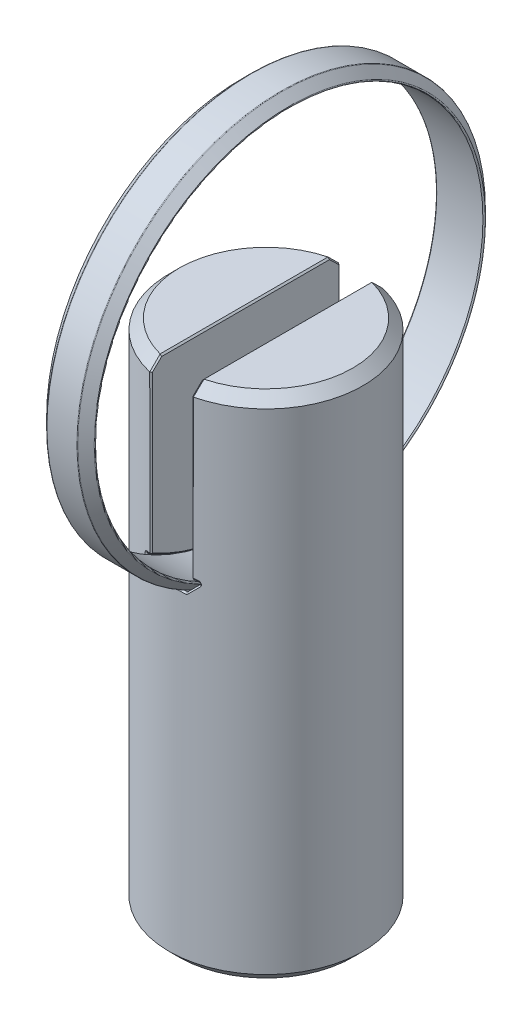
ISO-10303-21;
HEADER;
FILE_DESCRIPTION(('STEP AP214'),'2;1');
FILE_NAME('part.step','',(''),(''),'','','');
FILE_SCHEMA(('AUTOMOTIVE_DESIGN { 1 0 10303 214 1 1 1 1 }'));
ENDSEC;
DATA;
#1=APPLICATION_CONTEXT('core data for automotive mechanical design processes');
#2=APPLICATION_PROTOCOL_DEFINITION('international standard','automotive_design',2000,#1);
#3=PRODUCT_CONTEXT('',#1,'mechanical');
#4=PRODUCT('Part','Part','',(#3));
#5=PRODUCT_RELATED_PRODUCT_CATEGORY('part','',(#4));
#6=PRODUCT_DEFINITION_FORMATION('','',#4);
#7=PRODUCT_DEFINITION_CONTEXT('part definition',#1,'design');
#8=PRODUCT_DEFINITION('design','',#6,#7);
#9=PRODUCT_DEFINITION_SHAPE('','',#8);
#10=(LENGTH_UNIT() NAMED_UNIT(*) SI_UNIT(.MILLI.,.METRE.));
#11=(NAMED_UNIT(*) PLANE_ANGLE_UNIT() SI_UNIT($,.RADIAN.));
#12=(NAMED_UNIT(*) SI_UNIT($,.STERADIAN.) SOLID_ANGLE_UNIT());
#13=UNCERTAINTY_MEASURE_WITH_UNIT(LENGTH_MEASURE(1.E-05),#10,'distance_accuracy_value','');
#14=(GEOMETRIC_REPRESENTATION_CONTEXT(3) GLOBAL_UNCERTAINTY_ASSIGNED_CONTEXT((#13)) GLOBAL_UNIT_ASSIGNED_CONTEXT((#10,
#11,#12)) REPRESENTATION_CONTEXT('',''));
#15=CARTESIAN_POINT('',(0.,0.,0.));
#16=DIRECTION('',(0.,0.,1.));
#17=DIRECTION('',(1.,0.,0.));
#18=AXIS2_PLACEMENT_3D('',#15,#16,#17);
#19=CARTESIAN_POINT('',(-1.45857864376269,50.,0.));
#20=DIRECTION('',(-1.,0.,0.));
#21=DIRECTION('',(0.,0.,1.));
#22=AXIS2_PLACEMENT_3D('',#19,#20,#21);
#23=TOROIDAL_SURFACE('',#22,19.9,0.0999999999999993);
#24=CARTESIAN_POINT('',(-1.45857864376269,50.,0.));
#25=DIRECTION('',(-1.,0.,0.));
#26=DIRECTION('',(0.,0.,1.));
#27=AXIS2_PLACEMENT_3D('',#24,#25,#26);
#28=CIRCLE('',#27,20.);
#29=CARTESIAN_POINT('',(-1.45857864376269,50.,20.));
#30=VERTEX_POINT('',#29);
#31=EDGE_CURVE('E12',#30,#30,#28,.T.);
#32=ORIENTED_EDGE('',*,*,#31,.T.);
#33=EDGE_LOOP('',(#32));
#34=FACE_BOUND('',#33,.T.);
#35=CARTESIAN_POINT('',(-1.52928932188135,50.,0.));
#36=DIRECTION('',(-1.,0.,0.));
#37=DIRECTION('',(0.,0.,1.));
#38=AXIS2_PLACEMENT_3D('',#35,#36,#37);
#39=CIRCLE('',#38,19.9707106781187);
#40=CARTESIAN_POINT('',(-1.52928932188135,50.,19.9707106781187));
#41=VERTEX_POINT('',#40);
#42=EDGE_CURVE('E79',#41,#41,#39,.T.);
#43=ORIENTED_EDGE('',*,*,#42,.F.);
#44=EDGE_LOOP('',(#43));
#45=FACE_BOUND('',#44,.T.);
#46=ADVANCED_FACE('F51',(#34,#45),#23,.T.);
#47=CARTESIAN_POINT('',(0.,50.,0.));
#48=DIRECTION('',(-1.,0.,0.));
#49=DIRECTION('',(0.,0.,1.));
#50=AXIS2_PLACEMENT_3D('',#47,#48,#49);
#51=CYLINDRICAL_SURFACE('',#50,20.);
#52=CARTESIAN_POINT('',(1.45857864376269,50.,0.));
#53=DIRECTION('',(-1.,0.,0.));
#54=DIRECTION('',(0.,0.,1.));
#55=AXIS2_PLACEMENT_3D('',#52,#53,#54);
#56=CIRCLE('',#55,20.);
#57=CARTESIAN_POINT('',(1.45857864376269,50.,20.));
#58=VERTEX_POINT('',#57);
#59=EDGE_CURVE('E57',#58,#58,#56,.T.);
#60=ORIENTED_EDGE('',*,*,#59,.T.);
#61=EDGE_LOOP('',(#60));
#62=FACE_BOUND('',#61,.T.);
#63=ORIENTED_EDGE('',*,*,#31,.F.);
#64=EDGE_LOOP('',(#63));
#65=FACE_BOUND('',#64,.T.);
#66=ADVANCED_FACE('F87',(#62,#65),#51,.T.);
#67=CARTESIAN_POINT('',(1.45857864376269,50.,0.));
#68=DIRECTION('',(-1.,0.,0.));
#69=DIRECTION('',(0.,0.,1.));
#70=AXIS2_PLACEMENT_3D('',#67,#68,#69);
#71=TOROIDAL_SURFACE('',#70,19.9,0.0999999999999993);
#72=CARTESIAN_POINT('',(1.52928932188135,50.,0.));
#73=DIRECTION('',(-1.,0.,0.));
#74=DIRECTION('',(0.,0.,1.));
#75=AXIS2_PLACEMENT_3D('',#72,#73,#74);
#76=CIRCLE('',#75,19.9707106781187);
#77=CARTESIAN_POINT('',(1.52928932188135,50.,19.9707106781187));
#78=VERTEX_POINT('',#77);
#79=EDGE_CURVE('E61',#78,#78,#76,.T.);
#80=ORIENTED_EDGE('',*,*,#79,.T.);
#81=EDGE_LOOP('',(#80));
#82=FACE_BOUND('',#81,.T.);
#83=ORIENTED_EDGE('',*,*,#59,.F.);
#84=EDGE_LOOP('',(#83));
#85=FACE_BOUND('',#84,.T.);
#86=ADVANCED_FACE('F91',(#82,#85),#71,.T.);
#87=CARTESIAN_POINT('',(1.52928932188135,50.,0.));
#88=DIRECTION('',(-1.,0.,0.));
#89=DIRECTION('',(0.,0.,1.));
#90=AXIS2_PLACEMENT_3D('',#87,#88,#89);
#91=CONICAL_SURFACE('',#90,19.9707106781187,0.78539816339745);
#92=CARTESIAN_POINT('',(2.32928932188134,50.,0.));
#93=DIRECTION('',(-1.,0.,0.));
#94=DIRECTION('',(0.,0.,1.));
#95=AXIS2_PLACEMENT_3D('',#92,#93,#94);
#96=CIRCLE('',#95,19.1707106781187);
#97=CARTESIAN_POINT('',(2.32928932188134,50.,19.1707106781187));
#98=VERTEX_POINT('',#97);
#99=EDGE_CURVE('E65',#98,#98,#96,.T.);
#100=ORIENTED_EDGE('',*,*,#99,.T.);
#101=EDGE_LOOP('',(#100));
#102=FACE_BOUND('',#101,.T.);
#103=ORIENTED_EDGE('',*,*,#79,.F.);
#104=EDGE_LOOP('',(#103));
#105=FACE_BOUND('',#104,.T.);
#106=ADVANCED_FACE('F95',(#102,#105),#91,.T.);
#107=CARTESIAN_POINT('',(2.25857864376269,50.,0.));
#108=DIRECTION('',(-1.,0.,0.));
#109=DIRECTION('',(0.,0.,1.));
#110=AXIS2_PLACEMENT_3D('',#107,#108,#109);
#111=TOROIDAL_SURFACE('',#110,19.1,0.0999999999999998);
#112=CARTESIAN_POINT('',(2.25857864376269,50.,0.));
#113=DIRECTION('',(-1.,0.,0.));
#114=DIRECTION('',(0.,0.,1.));
#115=AXIS2_PLACEMENT_3D('',#112,#113,#114);
#116=CIRCLE('',#115,19.);
#117=CARTESIAN_POINT('',(2.25857864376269,50.,19.));
#118=VERTEX_POINT('',#117);
#119=EDGE_CURVE('E70',#118,#118,#116,.T.);
#120=ORIENTED_EDGE('',*,*,#119,.T.);
#121=EDGE_LOOP('',(#120));
#122=FACE_BOUND('',#121,.T.);
#123=ORIENTED_EDGE('',*,*,#99,.F.);
#124=EDGE_LOOP('',(#123));
#125=FACE_BOUND('',#124,.T.);
#126=ADVANCED_FACE('F102',(#122,#125),#111,.T.);
#127=CARTESIAN_POINT('',(0.,50.,0.));
#128=DIRECTION('',(-1.,0.,0.));
#129=DIRECTION('',(0.,0.,1.));
#130=AXIS2_PLACEMENT_3D('',#127,#128,#129);
#131=CYLINDRICAL_SURFACE('',#130,19.);
#132=CARTESIAN_POINT('',(-2.25857864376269,50.,0.));
#133=DIRECTION('',(-1.,0.,0.));
#134=DIRECTION('',(0.,0.,1.));
#135=AXIS2_PLACEMENT_3D('',#132,#133,#134);
#136=CIRCLE('',#135,19.);
#137=CARTESIAN_POINT('',(-2.25857864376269,50.,19.));
#138=VERTEX_POINT('',#137);
#139=EDGE_CURVE('E73',#138,#138,#136,.T.);
#140=ORIENTED_EDGE('',*,*,#139,.T.);
#141=EDGE_LOOP('',(#140));
#142=FACE_BOUND('',#141,.T.);
#143=ORIENTED_EDGE('',*,*,#119,.F.);
#144=EDGE_LOOP('',(#143));
#145=FACE_BOUND('',#144,.T.);
#146=ADVANCED_FACE('F106',(#142,#145),#131,.F.);
#147=CARTESIAN_POINT('',(-2.25857864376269,50.,0.));
#148=DIRECTION('',(-1.,0.,0.));
#149=DIRECTION('',(0.,0.,1.));
#150=AXIS2_PLACEMENT_3D('',#147,#148,#149);
#151=TOROIDAL_SURFACE('',#150,19.1,0.0999999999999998);
#152=CARTESIAN_POINT('',(-2.32928932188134,50.,0.));
#153=DIRECTION('',(-1.,0.,0.));
#154=DIRECTION('',(0.,0.,1.));
#155=AXIS2_PLACEMENT_3D('',#152,#153,#154);
#156=CIRCLE('',#155,19.1707106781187);
#157=CARTESIAN_POINT('',(-2.32928932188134,50.,19.1707106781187));
#158=VERTEX_POINT('',#157);
#159=EDGE_CURVE('E76',#158,#158,#156,.T.);
#160=ORIENTED_EDGE('',*,*,#159,.T.);
#161=EDGE_LOOP('',(#160));
#162=FACE_BOUND('',#161,.T.);
#163=ORIENTED_EDGE('',*,*,#139,.F.);
#164=EDGE_LOOP('',(#163));
#165=FACE_BOUND('',#164,.T.);
#166=ADVANCED_FACE('F110',(#162,#165),#151,.T.);
#167=CARTESIAN_POINT('',(-2.32928932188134,50.,0.));
#168=DIRECTION('',(1.,0.,0.));
#169=DIRECTION('',(0.,0.,-1.));
#170=AXIS2_PLACEMENT_3D('',#167,#168,#169);
#171=CONICAL_SURFACE('',#170,19.1707106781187,0.78539816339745);
#172=ORIENTED_EDGE('',*,*,#42,.T.);
#173=EDGE_LOOP('',(#172));
#174=FACE_BOUND('',#173,.T.);
#175=ORIENTED_EDGE('',*,*,#159,.F.);
#176=EDGE_LOOP('',(#175));
#177=FACE_BOUND('',#176,.T.);
#178=ADVANCED_FACE('F83',(#174,#177),#171,.T.);
#179=CLOSED_SHELL('',(#46,#66,#86,#106,#126,#146,#166,#178));
#180=MANIFOLD_SOLID_BREP('B2',#179);
#181=CARTESIAN_POINT('',(0.,50.,0.));
#182=DIRECTION('',(0.,1.,0.));
#183=DIRECTION('',(0.,0.,1.));
#184=AXIS2_PLACEMENT_3D('',#181,#182,#183);
#185=PLANE('',#184);
#186=CARTESIAN_POINT('',(0.,50.,0.));
#187=DIRECTION('',(0.,1.,0.));
#188=DIRECTION('',(0.,0.,1.));
#189=AXIS2_PLACEMENT_3D('',#186,#187,#188);
#190=CIRCLE('',#189,8.5);
#191=CARTESIAN_POINT('',(2.15050406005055,50.,8.22346230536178));
#192=VERTEX_POINT('',#191);
#193=CARTESIAN_POINT('',(2.1506277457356,50.,-8.22342993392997));
#194=VERTEX_POINT('',#193);
#195=EDGE_CURVE('E510',#192,#194,#190,.T.);
#196=ORIENTED_EDGE('',*,*,#195,.T.);
#197=DIRECTION('',(0.,0.,1.));
#198=VECTOR('',#197,1.);
#199=CARTESIAN_POINT('',(2.15,50.,8.26135582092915));
#200=LINE('',#199,#198);
#201=EDGE_CURVE('E685',#194,#192,#200,.T.);
#202=ORIENTED_EDGE('',*,*,#201,.T.);
#203=EDGE_LOOP('',(#196,#202));
#204=FACE_BOUND('',#203,.T.);
#205=ADVANCED_FACE('F172',(#204),#185,.T.);
#206=CARTESIAN_POINT('',(0.,50.,0.));
#207=DIRECTION('',(0.,-1.,0.));
#208=DIRECTION('',(0.,0.,-1.));
#209=AXIS2_PLACEMENT_3D('',#206,#207,#208);
#210=CONICAL_SURFACE('',#209,8.5,0.785398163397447);
#211=CARTESIAN_POINT('',(0.,49.,0.));
#212=DIRECTION('',(0.,1.,0.));
#213=DIRECTION('',(0.,0.,1.));
#214=AXIS2_PLACEMENT_3D('',#211,#212,#213);
#215=CIRCLE('',#214,9.5);
#216=CARTESIAN_POINT('',(2.13557949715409,48.9841368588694,-9.25684212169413));
#217=VERTEX_POINT('',#216);
#218=CARTESIAN_POINT('',(2.13591708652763,48.984136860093,9.2567637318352));
#219=VERTEX_POINT('',#218);
#220=EDGE_CURVE('E494',#217,#219,#215,.F.);
#221=ORIENTED_EDGE('',*,*,#220,.F.);
#222=CARTESIAN_POINT('',(2.1506218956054,50.0507193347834,-8.17099560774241));
#223=CARTESIAN_POINT('',(2.1497522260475,49.6788171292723,-8.55578724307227));
#224=CARTESIAN_POINT('',(2.14899457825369,49.3060188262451,-8.93971725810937));
#225=CARTESIAN_POINT('',(2.14831455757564,48.9326518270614,-9.32303038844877));
#226=B_SPLINE_CURVE_WITH_KNOTS('',3,(#222,#223,#224,#225),.UNSPECIFIED.,.F.,.F.,(4,4),
(0.0515818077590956,0.0531866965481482),.UNSPECIFIED.);
#227=EDGE_CURVE('E686',#217,#194,#226,.F.);
#228=ORIENTED_EDGE('',*,*,#227,.T.);
#229=ORIENTED_EDGE('',*,*,#195,.F.);
#230=CARTESIAN_POINT('',(2.14831455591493,48.9326518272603,9.32303038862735));
#231=CARTESIAN_POINT('',(2.14899457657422,49.3060188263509,8.93971725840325));
#232=CARTESIAN_POINT('',(2.14975222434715,49.67881712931,8.55578724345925));
#233=CARTESIAN_POINT('',(2.1506218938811,50.0507193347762,8.17099560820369));
#234=B_SPLINE_CURVE_WITH_KNOTS('',3,(#230,#231,#232,#233),.UNSPECIFIED.,.F.,.F.,(4,4),
(0.0515818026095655,0.0531866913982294),.UNSPECIFIED.);
#235=EDGE_CURVE('E692',#192,#219,#234,.F.);
#236=ORIENTED_EDGE('',*,*,#235,.T.);
#237=EDGE_LOOP('',(#221,#228,#229,#236));
#238=FACE_BOUND('',#237,.T.);
#239=ADVANCED_FACE('F997',(#238),#210,.T.);
#240=CARTESIAN_POINT('',(0.,0.,0.));
#241=DIRECTION('',(0.,1.,0.));
#242=DIRECTION('',(0.,0.,1.));
#243=AXIS2_PLACEMENT_3D('',#240,#241,#242);
#244=PLANE('',#243);
#245=DIRECTION('',(0.,0.,1.));
#246=VECTOR('',#245,1.);
#247=CARTESIAN_POINT('',(-4.49999999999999,0.,3.5));
#248=LINE('',#247,#246);
#249=CARTESIAN_POINT('',(-4.49999999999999,0.,-4.49999999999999));
#250=VERTEX_POINT('',#249);
#251=CARTESIAN_POINT('',(-4.49999999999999,0.,4.49999999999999));
#252=VERTEX_POINT('',#251);
#253=EDGE_CURVE('E463',#250,#252,#248,.T.);
#254=ORIENTED_EDGE('',*,*,#253,.T.);
#255=DIRECTION('',(1.,0.,0.));
#256=VECTOR('',#255,1.);
#257=CARTESIAN_POINT('',(3.5,0.,4.49999999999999));
#258=LINE('',#257,#256);
#259=CARTESIAN_POINT('',(4.49999999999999,0.,4.49999999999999));
#260=VERTEX_POINT('',#259);
#261=EDGE_CURVE('E442',#252,#260,#258,.T.);
#262=ORIENTED_EDGE('',*,*,#261,.T.);
#263=DIRECTION('',(0.,0.,-1.));
#264=VECTOR('',#263,1.);
#265=CARTESIAN_POINT('',(4.49999999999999,0.,-3.5));
#266=LINE('',#265,#264);
#267=CARTESIAN_POINT('',(4.49999999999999,0.,-4.49999999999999));
#268=VERTEX_POINT('',#267);
#269=EDGE_CURVE('E451',#260,#268,#266,.T.);
#270=ORIENTED_EDGE('',*,*,#269,.T.);
#271=DIRECTION('',(-1.,0.,0.));
#272=VECTOR('',#271,1.);
#273=CARTESIAN_POINT('',(-3.5,0.,-4.49999999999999));
#274=LINE('',#273,#272);
#275=EDGE_CURVE('E457',#268,#250,#274,.T.);
#276=ORIENTED_EDGE('',*,*,#275,.T.);
#277=EDGE_LOOP('',(#254,#262,#270,#276));
#278=FACE_BOUND('',#277,.T.);
#279=CARTESIAN_POINT('',(0.,0.,0.));
#280=DIRECTION('',(0.,1.,0.));
#281=DIRECTION('',(0.,0.,1.));
#282=AXIS2_PLACEMENT_3D('',#279,#280,#281);
#283=CIRCLE('',#282,8.49999999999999);
#284=CARTESIAN_POINT('',(0.,0.,8.49999999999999));
#285=VERTEX_POINT('',#284);
#286=EDGE_CURVE('E458',#285,#285,#283,.F.);
#287=ORIENTED_EDGE('',*,*,#286,.T.);
#288=EDGE_LOOP('',(#287));
#289=FACE_BOUND('',#288,.T.);
#290=ADVANCED_FACE('F460',(#278,#289),#244,.F.);
#291=CARTESIAN_POINT('',(0.,50.,0.));
#292=DIRECTION('',(0.,-1.,0.));
#293=DIRECTION('',(0.,0.,-1.));
#294=AXIS2_PLACEMENT_3D('',#291,#292,#293);
#295=CYLINDRICAL_SURFACE('',#294,9.5);
#296=CARTESIAN_POINT('',(0.,1.00000000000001,0.));
#297=DIRECTION('',(0.,1.,0.));
#298=DIRECTION('',(0.,0.,1.));
#299=AXIS2_PLACEMENT_3D('',#296,#297,#298);
#300=CIRCLE('',#299,9.5);
#301=CARTESIAN_POINT('',(0.,1.00000000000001,9.5));
#302=VERTEX_POINT('',#301);
#303=EDGE_CURVE('E497',#302,#302,#300,.T.);
#304=ORIENTED_EDGE('',*,*,#303,.T.);
#305=EDGE_LOOP('',(#304));
#306=FACE_BOUND('',#305,.T.);
#307=DIRECTION('',(0.,-1.,0.));
#308=VECTOR('',#307,1.);
#309=CARTESIAN_POINT('',(2.12272083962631,50.,9.25980865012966));
#310=LINE('',#309,#308);
#311=CARTESIAN_POINT('',(2.12272083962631,33.6221721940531,9.25980865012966));
#312=VERTEX_POINT('',#311);
#313=EDGE_CURVE('E506',#219,#312,#310,.T.);
#314=ORIENTED_EDGE('',*,*,#313,.T.);
#315=CARTESIAN_POINT('',(2.5461018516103,33.5631686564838,9.15245133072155));
#316=CARTESIAN_POINT('',(2.40550603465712,33.584501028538,9.19156307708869));
#317=CARTESIAN_POINT('',(2.2643638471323,33.6041902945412,9.22733814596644));
#318=CARTESIAN_POINT('',(2.12272083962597,33.622172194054,9.25980865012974));
#319=CARTESIAN_POINT('',(2.12210838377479,33.6222499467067,9.25994905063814));
#320=CARTESIAN_POINT('',(2.1214959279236,33.6223276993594,9.26008945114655));
#321=CARTESIAN_POINT('',(2.12088347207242,33.6224054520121,9.26022985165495));
#322=B_SPLINE_CURVE_WITH_KNOTS('',3,(#315,#316,#317,#318,#319,#320,#321),.UNSPECIFIED.,.F.,.F.,
(4,3,4),(0.0327000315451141,0.033130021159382,0.0331318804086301),.UNSPECIFIED.);
#323=CARTESIAN_POINT('',(2.526017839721,33.5662042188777,9.15801473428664));
#324=VERTEX_POINT('',#323);
#325=EDGE_CURVE('E646',#312,#324,#322,.F.);
#326=ORIENTED_EDGE('',*,*,#325,.T.);
#327=CARTESIAN_POINT('',(2.69211166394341,33.0892909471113,9.1105726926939));
#328=CARTESIAN_POINT('',(2.84271919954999,33.242371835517,9.06481967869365));
#329=CARTESIAN_POINT('',(2.72729741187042,33.5358480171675,9.10188766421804));
#330=CARTESIAN_POINT('',(2.526017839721,33.5662042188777,9.15801473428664));
#331=B_SPLINE_CURVE_WITH_KNOTS('',3,(#327,#328,#329,#330),.UNSPECIFIED.,.F.,.F.,(4,4),(0.,
0.000610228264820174),.UNSPECIFIED.);
#332=CARTESIAN_POINT('',(2.69211166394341,33.0892909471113,9.1105726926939));
#333=VERTEX_POINT('',#332);
#334=EDGE_CURVE('E636',#324,#333,#331,.F.);
#335=ORIENTED_EDGE('',*,*,#334,.T.);
#336=CARTESIAN_POINT('',(1.68170452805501,32.0843063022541,9.34996630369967));
#337=CARTESIAN_POINT('',(2.01620282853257,32.4261457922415,9.28977877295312));
#338=CARTESIAN_POINT('',(2.35275908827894,32.7615796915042,9.21082368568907));
#339=CARTESIAN_POINT('',(2.69211166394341,33.0892909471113,9.1105726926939));
#340=B_SPLINE_CURVE_WITH_KNOTS('',3,(#336,#337,#338,#339),.UNSPECIFIED.,.F.,.F.,(4,4),(0.,
0.00143740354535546),.UNSPECIFIED.);
#341=CARTESIAN_POINT('',(1.68170452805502,32.0843063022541,9.34996630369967));
#342=VERTEX_POINT('',#341);
#343=EDGE_CURVE('E653',#333,#342,#340,.F.);
#344=ORIENTED_EDGE('',*,*,#343,.T.);
#345=CARTESIAN_POINT('',(1.51561070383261,32.0221658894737,9.37832203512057));
#346=CARTESIAN_POINT('',(1.51944881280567,32.0218193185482,9.37770330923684));
#347=CARTESIAN_POINT('',(1.52329621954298,32.0215857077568,9.37708009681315));
#348=CARTESIAN_POINT('',(1.53098547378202,32.0213424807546,9.37582892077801));
#349=CARTESIAN_POINT('',(1.53482730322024,32.0213321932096,9.37520097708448));
#350=CARTESIAN_POINT('',(1.5424954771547,32.0215313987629,9.3739422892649));
#351=CARTESIAN_POINT('',(1.54632183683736,32.0217403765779,9.37331155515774));
#352=CARTESIAN_POINT('',(1.55394927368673,32.022373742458,9.37204922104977));
#353=CARTESIAN_POINT('',(1.55775038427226,32.0227977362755,9.37141762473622));
#354=CARTESIAN_POINT('',(1.56531750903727,32.023856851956,9.37015550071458));
#355=CARTESIAN_POINT('',(1.56908356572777,32.0244916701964,9.36952497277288));
#356=CARTESIAN_POINT('',(1.57657078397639,32.0259681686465,9.36826691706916));
#357=CARTESIAN_POINT('',(1.58029199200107,32.0268096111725,9.36763938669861));
#358=CARTESIAN_POINT('',(1.58767971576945,32.0286951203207,9.36638925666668));
#359=CARTESIAN_POINT('',(1.59134627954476,32.0297389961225,9.36576665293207));
#360=CARTESIAN_POINT('',(1.59861491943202,32.0320251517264,9.36452830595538));
#361=CARTESIAN_POINT('',(1.60221704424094,32.0332672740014,9.36391255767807));
#362=CARTESIAN_POINT('',(1.60934701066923,32.0359457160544,9.36268985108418));
#363=CARTESIAN_POINT('',(1.61287490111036,32.037381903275,9.36208288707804));
#364=CARTESIAN_POINT('',(1.6198466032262,32.0404442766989,9.36087967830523));
#365=CARTESIAN_POINT('',(1.62329046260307,32.0420703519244,9.36028342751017));
#366=CARTESIAN_POINT('',(1.63008430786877,32.0455083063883,9.3591035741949));
#367=CARTESIAN_POINT('',(1.6334343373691,32.0473200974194,9.35851996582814));
#368=CARTESIAN_POINT('',(1.64003073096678,32.0511252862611,9.35736732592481));
#369=CARTESIAN_POINT('',(1.64327712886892,32.0531186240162,9.35679828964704));
#370=CARTESIAN_POINT('',(1.64965647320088,32.0572827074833,9.35567672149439));
#371=CARTESIAN_POINT('',(1.65278943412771,32.0594534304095,9.35512418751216));
#372=CARTESIAN_POINT('',(1.65893212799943,32.0639680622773,9.35403755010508));
#373=CARTESIAN_POINT('',(1.66194184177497,32.0663119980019,9.35350344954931));
#374=CARTESIAN_POINT('',(1.66782828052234,32.0711688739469,9.35245560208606));
#375=CARTESIAN_POINT('',(1.67070493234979,32.0736819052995,9.35194186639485));
#376=CARTESIAN_POINT('',(1.67631550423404,32.0788725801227,9.35093667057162));
#377=CARTESIAN_POINT('',(1.67904926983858,32.0815503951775,9.35044523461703));
#378=CARTESIAN_POINT('',(1.68170452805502,32.0843063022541,9.34996630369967));
#379=B_SPLINE_CURVE_WITH_KNOTS('',3,(#345,#346,#347,#348,#349,#350,#351,#352,#353,#354,#355,
#356,#357,#358,#359,#360,#361,#362,#363,#364,#365,#366,#367,#368,#369,#370,#371,#372,#373,#374,
#375,#376,#377,#378),.UNSPECIFIED.,.F.,.F.,(4,2,2,2,2,2,2,2,2,2,2,2,2,2,2,2,4),(0.,
0.0117073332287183,0.0233794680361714,0.0350242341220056,0.0466477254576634,0.0582545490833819,
0.0698480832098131,0.0814307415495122,0.0930042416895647,0.104569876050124,0.116128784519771,
0.127682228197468,0.139231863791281,0.150780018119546,0.162329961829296,0.173886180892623,
0.185454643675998),.UNSPECIFIED.);
#380=CARTESIAN_POINT('',(1.51561070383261,32.0221658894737,9.37832203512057));
#381=VERTEX_POINT('',#380);
#382=EDGE_CURVE('E654',#342,#381,#379,.F.);
#383=ORIENTED_EDGE('',*,*,#382,.T.);
#384=CARTESIAN_POINT('',(-1.5156107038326,32.0221658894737,9.37832203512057));
#385=CARTESIAN_POINT('',(-0.505203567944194,32.1057269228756,9.54070765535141));
#386=CARTESIAN_POINT('',(0.505203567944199,32.1057269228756,9.54070765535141));
#387=CARTESIAN_POINT('',(1.51561070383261,32.0221658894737,9.37832203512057));
#388=B_SPLINE_CURVE_WITH_KNOTS('',3,(#384,#385,#386,#387),.UNSPECIFIED.,.F.,.F.,(4,4),(0.,
0.003),.UNSPECIFIED.);
#389=CARTESIAN_POINT('',(-1.5156107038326,32.0221658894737,9.37832203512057));
#390=VERTEX_POINT('',#389);
#391=EDGE_CURVE('E656',#381,#390,#388,.F.);
#392=ORIENTED_EDGE('',*,*,#391,.T.);
#393=CARTESIAN_POINT('',(-1.68655970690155,32.0893471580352,9.34909045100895));
#394=CARTESIAN_POINT('',(-1.6849413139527,32.0876668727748,9.34938240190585));
#395=CARTESIAN_POINT('',(-1.68332292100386,32.0859865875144,9.34967435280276));
#396=CARTESIAN_POINT('',(-1.68170452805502,32.0843063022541,9.34996630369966));
#397=CARTESIAN_POINT('',(-1.63889891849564,32.0398636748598,9.35768824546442));
#398=CARTESIAN_POINT('',(-1.57667979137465,32.0166558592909,9.36847792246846));
#399=CARTESIAN_POINT('',(-1.5156107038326,32.0221658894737,9.37832203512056));
#400=B_SPLINE_CURVE_WITH_KNOTS('',3,(#393,#394,#395,#396,#397,#398,#399),.UNSPECIFIED.,.F.,.F.,
(4,3,4),(0.,6.91021436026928E-06,0.000189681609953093),.UNSPECIFIED.);
#401=CARTESIAN_POINT('',(-1.681704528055,32.0843063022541,9.34996630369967));
#402=VERTEX_POINT('',#401);
#403=EDGE_CURVE('E658',#390,#402,#400,.F.);
#404=ORIENTED_EDGE('',*,*,#403,.T.);
#405=CARTESIAN_POINT('',(-2.69211166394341,33.0892909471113,9.11057269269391));
#406=CARTESIAN_POINT('',(-2.35275908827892,32.7615796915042,9.21082368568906));
#407=CARTESIAN_POINT('',(-2.01620282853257,32.4261457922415,9.28977877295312));
#408=CARTESIAN_POINT('',(-1.681704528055,32.0843063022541,9.34996630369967));
#409=B_SPLINE_CURVE_WITH_KNOTS('',3,(#405,#406,#407,#408),.UNSPECIFIED.,.F.,.F.,(4,4),(0.,
0.00143740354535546),.UNSPECIFIED.);
#410=CARTESIAN_POINT('',(-2.6921116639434,33.0892909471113,9.11057269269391));
#411=VERTEX_POINT('',#410);
#412=EDGE_CURVE('E660',#402,#411,#409,.F.);
#413=ORIENTED_EDGE('',*,*,#412,.T.);
#414=CARTESIAN_POINT('',(-2.526017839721,33.5662042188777,9.15801473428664));
#415=CARTESIAN_POINT('',(-2.7275381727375,33.5364189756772,9.10181907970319));
#416=CARTESIAN_POINT('',(-2.84232564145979,33.2418343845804,9.06493535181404));
#417=CARTESIAN_POINT('',(-2.6921116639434,33.0892909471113,9.11057269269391));
#418=B_SPLINE_CURVE_WITH_KNOTS('',3,(#414,#415,#416,#417),.UNSPECIFIED.,.F.,.F.,(4,4),(0.,
0.000610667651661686),.UNSPECIFIED.);
#419=CARTESIAN_POINT('',(-2.52601783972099,33.5662042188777,9.15801473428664));
#420=VERTEX_POINT('',#419);
#421=EDGE_CURVE('E662',#411,#420,#418,.F.);
#422=ORIENTED_EDGE('',*,*,#421,.T.);
#423=CARTESIAN_POINT('',(-2.10248201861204,33.624729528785,9.26442493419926));
#424=CARTESIAN_POINT('',(-2.2441783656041,33.6069094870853,9.23226773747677));
#425=CARTESIAN_POINT('',(-2.38535739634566,33.5873819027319,9.19681210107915));
#426=CARTESIAN_POINT('',(-2.526017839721,33.5662042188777,9.15801473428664));
#427=B_SPLINE_CURVE_WITH_KNOTS('',3,(#423,#424,#425,#426),.UNSPECIFIED.,.F.,.F.,(4,4),
(0.0327223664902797,0.0331523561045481),.UNSPECIFIED.);
#428=CARTESIAN_POINT('',(-2.12272083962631,33.6265886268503,9.25980865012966));
#429=VERTEX_POINT('',#428);
#430=EDGE_CURVE('E664',#420,#429,#427,.F.);
#431=ORIENTED_EDGE('',*,*,#430,.T.);
#432=DIRECTION('',(0.,-1.,0.));
#433=VECTOR('',#432,1.);
#434=CARTESIAN_POINT('',(-2.12272083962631,50.,9.25980865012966));
#435=LINE('',#434,#433);
#436=CARTESIAN_POINT('',(-2.13557949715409,48.9841368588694,9.25684212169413));
#437=VERTEX_POINT('',#436);
#438=EDGE_CURVE('E520',#429,#437,#435,.F.);
#439=ORIENTED_EDGE('',*,*,#438,.T.);
#440=CARTESIAN_POINT('',(-2.13591708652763,48.984136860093,-9.25676373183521));
#441=VERTEX_POINT('',#440);
#442=EDGE_CURVE('E503',#437,#441,#215,.F.);
#443=ORIENTED_EDGE('',*,*,#442,.T.);
#444=DIRECTION('',(0.,-1.,0.));
#445=VECTOR('',#444,1.);
#446=CARTESIAN_POINT('',(-2.12272083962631,50.,-9.25980865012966));
#447=LINE('',#446,#445);
#448=CARTESIAN_POINT('',(-2.12272083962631,33.6221721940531,-9.25980865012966));
#449=VERTEX_POINT('',#448);
#450=EDGE_CURVE('E515',#441,#449,#447,.T.);
#451=ORIENTED_EDGE('',*,*,#450,.T.);
#452=CARTESIAN_POINT('',(-2.5461018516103,33.5631686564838,-9.15245133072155));
#453=CARTESIAN_POINT('',(-2.40550603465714,33.584501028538,-9.19156307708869));
#454=CARTESIAN_POINT('',(-2.26436384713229,33.6041902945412,-9.22733814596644));
#455=CARTESIAN_POINT('',(-2.12272083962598,33.622172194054,-9.25980865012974));
#456=CARTESIAN_POINT('',(-2.12210838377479,33.6222499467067,-9.25994905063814));
#457=CARTESIAN_POINT('',(-2.12149592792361,33.6223276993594,-9.26008945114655));
#458=CARTESIAN_POINT('',(-2.12088347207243,33.6224054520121,-9.26022985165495));
#459=B_SPLINE_CURVE_WITH_KNOTS('',3,(#452,#453,#454,#455,#456,#457,#458),.UNSPECIFIED.,.F.,.F.,
(4,3,4),(0.0327000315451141,0.033130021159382,0.0331318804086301),.UNSPECIFIED.);
#460=CARTESIAN_POINT('',(-2.526017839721,33.5662042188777,-9.15801473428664));
#461=VERTEX_POINT('',#460);
#462=EDGE_CURVE('E666',#449,#461,#459,.F.);
#463=ORIENTED_EDGE('',*,*,#462,.T.);
#464=CARTESIAN_POINT('',(-2.69211166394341,33.0892909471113,-9.1105726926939));
#465=CARTESIAN_POINT('',(-2.84271919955,33.242371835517,-9.06481967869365));
#466=CARTESIAN_POINT('',(-2.7272974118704,33.5358480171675,-9.10188766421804));
#467=CARTESIAN_POINT('',(-2.526017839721,33.5662042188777,-9.15801473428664));
#468=B_SPLINE_CURVE_WITH_KNOTS('',3,(#464,#465,#466,#467),.UNSPECIFIED.,.F.,.F.,(4,4),(0.,
0.000610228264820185),.UNSPECIFIED.);
#469=CARTESIAN_POINT('',(-2.69211166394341,33.0892909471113,-9.1105726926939));
#470=VERTEX_POINT('',#469);
#471=EDGE_CURVE('E669',#461,#470,#468,.F.);
#472=ORIENTED_EDGE('',*,*,#471,.T.);
#473=CARTESIAN_POINT('',(-1.68170452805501,32.0843063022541,-9.34996630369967));
#474=CARTESIAN_POINT('',(-2.01620282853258,32.4261457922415,-9.28977877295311));
#475=CARTESIAN_POINT('',(-2.35275908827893,32.7615796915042,-9.21082368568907));
#476=CARTESIAN_POINT('',(-2.69211166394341,33.0892909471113,-9.1105726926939));
#477=B_SPLINE_CURVE_WITH_KNOTS('',3,(#473,#474,#475,#476),.UNSPECIFIED.,.F.,.F.,(4,4),(0.,
0.00143740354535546),.UNSPECIFIED.);
#478=CARTESIAN_POINT('',(-1.68170452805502,32.0843063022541,-9.34996630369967));
#479=VERTEX_POINT('',#478);
#480=EDGE_CURVE('E672',#470,#479,#477,.F.);
#481=ORIENTED_EDGE('',*,*,#480,.T.);
#482=CARTESIAN_POINT('',(-1.50836371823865,32.0228200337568,-9.37949029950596));
#483=CARTESIAN_POINT('',(-1.5107793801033,32.0226019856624,-9.37910087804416));
#484=CARTESIAN_POINT('',(-1.51319504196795,32.0223839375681,-9.37871145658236));
#485=CARTESIAN_POINT('',(-1.51561070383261,32.0221658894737,-9.37832203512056));
#486=CARTESIAN_POINT('',(-1.57712781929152,32.0166130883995,-9.36840504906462));
#487=CARTESIAN_POINT('',(-1.63918907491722,32.0401813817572,-9.3576348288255));
#488=CARTESIAN_POINT('',(-1.68170452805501,32.0843063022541,-9.34996630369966));
#489=B_SPLINE_CURVE_WITH_KNOTS('',3,(#482,#483,#484,#485,#486,#487,#488),.UNSPECIFIED.,.F.,.F.,
(4,3,4),(0.,7.17762769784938E-06,0.000189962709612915),.UNSPECIFIED.);
#490=CARTESIAN_POINT('',(-1.51561070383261,32.0221658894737,-9.37832203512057));
#491=VERTEX_POINT('',#490);
#492=EDGE_CURVE('E675',#479,#491,#489,.F.);
#493=ORIENTED_EDGE('',*,*,#492,.T.);
#494=CARTESIAN_POINT('',(1.51561070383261,32.0221658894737,-9.37832203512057));
#495=CARTESIAN_POINT('',(0.505203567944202,32.1057269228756,-9.54070765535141));
#496=CARTESIAN_POINT('',(-0.505203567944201,32.1057269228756,-9.5407076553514));
#497=CARTESIAN_POINT('',(-1.51561070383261,32.0221658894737,-9.37832203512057));
#498=B_SPLINE_CURVE_WITH_KNOTS('',3,(#494,#495,#496,#497),.UNSPECIFIED.,.F.,.F.,(4,4),(0.,
0.003),.UNSPECIFIED.);
#499=CARTESIAN_POINT('',(1.51561070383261,32.0221658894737,-9.37832203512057));
#500=VERTEX_POINT('',#499);
#501=EDGE_CURVE('E677',#491,#500,#498,.F.);
#502=ORIENTED_EDGE('',*,*,#501,.T.);
#503=CARTESIAN_POINT('',(1.68655970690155,32.0893471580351,-9.34909045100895));
#504=CARTESIAN_POINT('',(1.68494131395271,32.0876668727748,-9.34938240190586));
#505=CARTESIAN_POINT('',(1.68332292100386,32.0859865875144,-9.34967435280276));
#506=CARTESIAN_POINT('',(1.68170452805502,32.0843063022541,-9.34996630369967));
#507=CARTESIAN_POINT('',(1.63889891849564,32.0398636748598,-9.35768824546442));
#508=CARTESIAN_POINT('',(1.57667979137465,32.0166558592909,-9.36847792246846));
#509=CARTESIAN_POINT('',(1.51561070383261,32.0221658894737,-9.37832203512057));
#510=B_SPLINE_CURVE_WITH_KNOTS('',3,(#503,#504,#505,#506,#507,#508,#509),.UNSPECIFIED.,.F.,.F.,
(4,3,4),(0.,6.91021436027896E-06,0.000189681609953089),.UNSPECIFIED.);
#511=CARTESIAN_POINT('',(1.68170452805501,32.0843063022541,-9.34996630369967));
#512=VERTEX_POINT('',#511);
#513=EDGE_CURVE('E679',#500,#512,#510,.F.);
#514=ORIENTED_EDGE('',*,*,#513,.T.);
#515=CARTESIAN_POINT('',(2.69211166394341,33.0892909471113,-9.1105726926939));
#516=CARTESIAN_POINT('',(2.35275908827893,32.7615796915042,-9.21082368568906));
#517=CARTESIAN_POINT('',(2.01620282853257,32.4261457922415,-9.28977877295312));
#518=CARTESIAN_POINT('',(1.68170452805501,32.0843063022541,-9.34996630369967));
#519=B_SPLINE_CURVE_WITH_KNOTS('',3,(#515,#516,#517,#518),.UNSPECIFIED.,.F.,.F.,(4,4),(0.,
0.00143740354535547),.UNSPECIFIED.);
#520=CARTESIAN_POINT('',(2.69211166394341,33.0892909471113,-9.1105726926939));
#521=VERTEX_POINT('',#520);
#522=EDGE_CURVE('E681',#512,#521,#519,.F.);
#523=ORIENTED_EDGE('',*,*,#522,.T.);
#524=CARTESIAN_POINT('',(2.526017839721,33.5662042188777,-9.15801473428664));
#525=CARTESIAN_POINT('',(2.72753817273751,33.5364189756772,-9.10181907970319));
#526=CARTESIAN_POINT('',(2.84232564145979,33.2418343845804,-9.06493535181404));
#527=CARTESIAN_POINT('',(2.69211166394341,33.0892909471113,-9.1105726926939));
#528=B_SPLINE_CURVE_WITH_KNOTS('',3,(#524,#525,#526,#527),.UNSPECIFIED.,.F.,.F.,(4,4),(0.,
0.000610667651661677),.UNSPECIFIED.);
#529=CARTESIAN_POINT('',(2.52601783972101,33.5662042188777,-9.15801473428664));
#530=VERTEX_POINT('',#529);
#531=EDGE_CURVE('E683',#521,#530,#528,.F.);
#532=ORIENTED_EDGE('',*,*,#531,.T.);
#533=CARTESIAN_POINT('',(2.10248201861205,33.624729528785,-9.26442493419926));
#534=CARTESIAN_POINT('',(2.24417836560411,33.6069094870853,-9.23226773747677));
#535=CARTESIAN_POINT('',(2.38535739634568,33.5873819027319,-9.19681210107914));
#536=CARTESIAN_POINT('',(2.52601783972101,33.5662042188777,-9.15801473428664));
#537=B_SPLINE_CURVE_WITH_KNOTS('',3,(#533,#534,#535,#536),.UNSPECIFIED.,.F.,.F.,(4,4),
(0.0327223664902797,0.0331523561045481),.UNSPECIFIED.);
#538=CARTESIAN_POINT('',(2.12272083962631,33.6265886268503,-9.25980865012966));
#539=VERTEX_POINT('',#538);
#540=EDGE_CURVE('E526',#530,#539,#537,.F.);
#541=ORIENTED_EDGE('',*,*,#540,.T.);
#542=DIRECTION('',(0.,-1.,0.));
#543=VECTOR('',#542,1.);
#544=CARTESIAN_POINT('',(2.12272083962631,50.,-9.25980865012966));
#545=LINE('',#544,#543);
#546=EDGE_CURVE('E509',#539,#217,#545,.F.);
#547=ORIENTED_EDGE('',*,*,#546,.T.);
#548=ORIENTED_EDGE('',*,*,#220,.T.);
#549=EDGE_LOOP('',(#314,#326,#335,#344,#383,#392,#404,#413,#422,#431,#439,#443,#451,#463,#472,
#481,#493,#502,#514,#523,#532,#541,#547,#548));
#550=FACE_BOUND('',#549,.T.);
#551=ADVANCED_FACE('F533',(#306,#550),#295,.T.);
#552=CARTESIAN_POINT('',(-2.15050406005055,50.,-8.22346230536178));
#553=VERTEX_POINT('',#552);
#554=CARTESIAN_POINT('',(-2.15062774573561,50.,8.22342993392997));
#555=VERTEX_POINT('',#554);
#556=EDGE_CURVE('E1163',#553,#555,#190,.T.);
#557=ORIENTED_EDGE('',*,*,#556,.T.);
#558=DIRECTION('',(0.,0.,-1.));
#559=VECTOR('',#558,1.);
#560=CARTESIAN_POINT('',(-2.15,50.,-8.26135582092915));
#561=LINE('',#560,#559);
#562=EDGE_CURVE('E1197',#555,#553,#561,.T.);
#563=ORIENTED_EDGE('',*,*,#562,.T.);
#564=EDGE_LOOP('',(#557,#563));
#565=FACE_BOUND('',#564,.T.);
#566=ADVANCED_FACE('F543',(#565),#185,.T.);
#567=CARTESIAN_POINT('',(3.5,12.,-3.5));
#568=DIRECTION('',(-1.,0.,0.));
#569=DIRECTION('',(0.,0.,1.));
#570=AXIS2_PLACEMENT_3D('',#567,#568,#569);
#571=PLANE('',#570);
#572=DIRECTION('',(0.,-1.,0.));
#573=VECTOR('',#572,1.);
#574=CARTESIAN_POINT('',(3.5,12.,-3.5));
#575=LINE('',#574,#573);
#576=CARTESIAN_POINT('',(3.5,11.,-3.5));
#577=VERTEX_POINT('',#576);
#578=CARTESIAN_POINT('',(3.5,1.,-3.5));
#579=VERTEX_POINT('',#578);
#580=EDGE_CURVE('E2770',#577,#579,#575,.T.);
#581=ORIENTED_EDGE('',*,*,#580,.T.);
#582=DIRECTION('',(0.,0.,1.));
#583=VECTOR('',#582,1.);
#584=CARTESIAN_POINT('',(3.5,1.,3.5));
#585=LINE('',#584,#583);
#586=CARTESIAN_POINT('',(3.5,1.,3.5));
#587=VERTEX_POINT('',#586);
#588=EDGE_CURVE('E483',#579,#587,#585,.T.);
#589=ORIENTED_EDGE('',*,*,#588,.T.);
#590=DIRECTION('',(0.,-1.,0.));
#591=VECTOR('',#590,1.);
#592=CARTESIAN_POINT('',(3.5,12.,3.5));
#593=LINE('',#592,#591);
#594=CARTESIAN_POINT('',(3.5,11.,3.5));
#595=VERTEX_POINT('',#594);
#596=EDGE_CURVE('E1084',#595,#587,#593,.T.);
#597=ORIENTED_EDGE('',*,*,#596,.F.);
#598=DIRECTION('',(0.,0.,-1.));
#599=VECTOR('',#598,1.);
#600=CARTESIAN_POINT('',(3.5,11.,-3.5));
#601=LINE('',#600,#599);
#602=EDGE_CURVE('E481',#595,#577,#601,.T.);
#603=ORIENTED_EDGE('',*,*,#602,.T.);
#604=EDGE_LOOP('',(#581,#589,#597,#603));
#605=FACE_BOUND('',#604,.T.);
#606=ADVANCED_FACE('F2270',(#605),#571,.T.);
#607=CARTESIAN_POINT('',(-3.5,12.,-3.5));
#608=DIRECTION('',(0.,0.,1.));
#609=DIRECTION('',(1.,0.,0.));
#610=AXIS2_PLACEMENT_3D('',#607,#608,#609);
#611=PLANE('',#610);
#612=DIRECTION('',(0.,-1.,0.));
#613=VECTOR('',#612,1.);
#614=CARTESIAN_POINT('',(-3.5,12.,-3.5));
#615=LINE('',#614,#613);
#616=CARTESIAN_POINT('',(-3.5,11.,-3.5));
#617=VERTEX_POINT('',#616);
#618=CARTESIAN_POINT('',(-3.5,1.,-3.5));
#619=VERTEX_POINT('',#618);
#620=EDGE_CURVE('E2765',#617,#619,#615,.T.);
#621=ORIENTED_EDGE('',*,*,#620,.T.);
#622=DIRECTION('',(1.,0.,0.));
#623=VECTOR('',#622,1.);
#624=CARTESIAN_POINT('',(3.5,1.,-3.5));
#625=LINE('',#624,#623);
#626=EDGE_CURVE('E479',#619,#579,#625,.T.);
#627=ORIENTED_EDGE('',*,*,#626,.T.);
#628=ORIENTED_EDGE('',*,*,#580,.F.);
#629=DIRECTION('',(-1.,0.,0.));
#630=VECTOR('',#629,1.);
#631=CARTESIAN_POINT('',(-3.5,11.,-3.5));
#632=LINE('',#631,#630);
#633=EDGE_CURVE('E476',#577,#617,#632,.T.);
#634=ORIENTED_EDGE('',*,*,#633,.T.);
#635=EDGE_LOOP('',(#621,#627,#628,#634));
#636=FACE_BOUND('',#635,.T.);
#637=ADVANCED_FACE('F2274',(#636),#611,.T.);
#638=CARTESIAN_POINT('',(-3.5,12.,-3.5));
#639=DIRECTION('',(1.,0.,0.));
#640=DIRECTION('',(0.,0.,-1.));
#641=AXIS2_PLACEMENT_3D('',#638,#639,#640);
#642=PLANE('',#641);
#643=DIRECTION('',(0.,-1.,0.));
#644=VECTOR('',#643,1.);
#645=CARTESIAN_POINT('',(-3.5,12.,3.5));
#646=LINE('',#645,#644);
#647=CARTESIAN_POINT('',(-3.5,11.,3.5));
#648=VERTEX_POINT('',#647);
#649=CARTESIAN_POINT('',(-3.5,1.,3.5));
#650=VERTEX_POINT('',#649);
#651=EDGE_CURVE('E2771',#648,#650,#646,.T.);
#652=ORIENTED_EDGE('',*,*,#651,.T.);
#653=DIRECTION('',(0.,0.,-1.));
#654=VECTOR('',#653,1.);
#655=CARTESIAN_POINT('',(-3.5,1.,-3.5));
#656=LINE('',#655,#654);
#657=EDGE_CURVE('E474',#650,#619,#656,.T.);
#658=ORIENTED_EDGE('',*,*,#657,.T.);
#659=ORIENTED_EDGE('',*,*,#620,.F.);
#660=DIRECTION('',(0.,0.,1.));
#661=VECTOR('',#660,1.);
#662=CARTESIAN_POINT('',(-3.5,11.,-3.5));
#663=LINE('',#662,#661);
#664=EDGE_CURVE('E472',#617,#648,#663,.T.);
#665=ORIENTED_EDGE('',*,*,#664,.T.);
#666=EDGE_LOOP('',(#652,#658,#659,#665));
#667=FACE_BOUND('',#666,.T.);
#668=ADVANCED_FACE('F2503',(#667),#642,.T.);
#669=CARTESIAN_POINT('',(-3.5,12.,3.5));
#670=DIRECTION('',(0.,0.,-1.));
#671=DIRECTION('',(-1.,0.,0.));
#672=AXIS2_PLACEMENT_3D('',#669,#670,#671);
#673=PLANE('',#672);
#674=ORIENTED_EDGE('',*,*,#596,.T.);
#675=DIRECTION('',(-1.,0.,0.));
#676=VECTOR('',#675,1.);
#677=CARTESIAN_POINT('',(-3.5,1.,3.5));
#678=LINE('',#677,#676);
#679=EDGE_CURVE('E444',#587,#650,#678,.T.);
#680=ORIENTED_EDGE('',*,*,#679,.T.);
#681=ORIENTED_EDGE('',*,*,#651,.F.);
#682=DIRECTION('',(1.,0.,0.));
#683=VECTOR('',#682,1.);
#684=CARTESIAN_POINT('',(-3.5,11.,3.5));
#685=LINE('',#684,#683);
#686=EDGE_CURVE('E465',#648,#595,#685,.T.);
#687=ORIENTED_EDGE('',*,*,#686,.T.);
#688=EDGE_LOOP('',(#674,#680,#681,#687));
#689=FACE_BOUND('',#688,.T.);
#690=ADVANCED_FACE('F2496',(#689),#673,.T.);
#691=CARTESIAN_POINT('',(3.5,12.,3.5));
#692=DIRECTION('',(0.,1.,0.));
#693=DIRECTION('',(0.,0.,1.));
#694=AXIS2_PLACEMENT_3D('',#691,#692,#693);
#695=PLANE('',#694);
#696=DIRECTION('',(0.,0.,-1.));
#697=VECTOR('',#696,1.);
#698=CARTESIAN_POINT('',(-2.5,12.,3.5));
#699=LINE('',#698,#697);
#700=CARTESIAN_POINT('',(-2.5,12.,2.50000000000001));
#701=VERTEX_POINT('',#700);
#702=CARTESIAN_POINT('',(-2.50000000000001,12.,-2.5));
#703=VERTEX_POINT('',#702);
#704=EDGE_CURVE('E489',#701,#703,#699,.T.);
#705=ORIENTED_EDGE('',*,*,#704,.T.);
#706=DIRECTION('',(1.,0.,0.));
#707=VECTOR('',#706,1.);
#708=CARTESIAN_POINT('',(3.5,12.,-2.50000000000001));
#709=LINE('',#708,#707);
#710=CARTESIAN_POINT('',(2.50000000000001,12.,-2.50000000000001));
#711=VERTEX_POINT('',#710);
#712=EDGE_CURVE('E491',#703,#711,#709,.T.);
#713=ORIENTED_EDGE('',*,*,#712,.T.);
#714=DIRECTION('',(0.,0.,1.));
#715=VECTOR('',#714,1.);
#716=CARTESIAN_POINT('',(2.50000000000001,12.,3.5));
#717=LINE('',#716,#715);
#718=CARTESIAN_POINT('',(2.50000000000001,12.,2.50000000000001));
#719=VERTEX_POINT('',#718);
#720=EDGE_CURVE('E485',#711,#719,#717,.T.);
#721=ORIENTED_EDGE('',*,*,#720,.T.);
#722=DIRECTION('',(-1.,0.,0.));
#723=VECTOR('',#722,1.);
#724=CARTESIAN_POINT('',(3.5,12.,2.50000000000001));
#725=LINE('',#724,#723);
#726=EDGE_CURVE('E487',#719,#701,#725,.T.);
#727=ORIENTED_EDGE('',*,*,#726,.T.);
#728=EDGE_LOOP('',(#705,#713,#721,#727));
#729=FACE_BOUND('',#728,.T.);
#730=ADVANCED_FACE('F1129',(#729),#695,.F.);
#731=CARTESIAN_POINT('',(0.,0.,-4.49999999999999));
#732=DIRECTION('',(0.,-0.707106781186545,0.70710678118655));
#733=DIRECTION('',(0.,-0.70710678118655,-0.707106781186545));
#734=AXIS2_PLACEMENT_3D('',#731,#732,#733);
#735=PLANE('',#734);
#736=DIRECTION('',(0.577350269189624,-0.577350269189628,-0.577350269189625));
#737=VECTOR('',#736,1.);
#738=CARTESIAN_POINT('',(3.,1.5,-3.));
#739=LINE('',#738,#737);
#740=EDGE_CURVE('E454',#579,#268,#739,.T.);
#741=ORIENTED_EDGE('',*,*,#740,.F.);
#742=ORIENTED_EDGE('',*,*,#626,.F.);
#743=DIRECTION('',(-0.577350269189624,-0.577350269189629,-0.577350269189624));
#744=VECTOR('',#743,1.);
#745=CARTESIAN_POINT('',(-3.,1.5,-3.));
#746=LINE('',#745,#744);
#747=EDGE_CURVE('E2775',#250,#619,#746,.F.);
#748=ORIENTED_EDGE('',*,*,#747,.F.);
#749=ORIENTED_EDGE('',*,*,#275,.F.);
#750=EDGE_LOOP('',(#741,#742,#748,#749));
#751=FACE_BOUND('',#750,.T.);
#752=ADVANCED_FACE('F2481',(#751),#735,.T.);
#753=CARTESIAN_POINT('',(-4.49999999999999,0.,0.));
#754=DIRECTION('',(0.70710678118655,-0.707106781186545,0.));
#755=DIRECTION('',(0.707106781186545,0.70710678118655,0.));
#756=AXIS2_PLACEMENT_3D('',#753,#754,#755);
#757=PLANE('',#756);
#758=ORIENTED_EDGE('',*,*,#747,.T.);
#759=ORIENTED_EDGE('',*,*,#657,.F.);
#760=DIRECTION('',(-0.577350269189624,-0.577350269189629,0.577350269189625));
#761=VECTOR('',#760,1.);
#762=CARTESIAN_POINT('',(-3.,1.5,3.));
#763=LINE('',#762,#761);
#764=EDGE_CURVE('E447',#252,#650,#763,.F.);
#765=ORIENTED_EDGE('',*,*,#764,.F.);
#766=ORIENTED_EDGE('',*,*,#253,.F.);
#767=EDGE_LOOP('',(#758,#759,#765,#766));
#768=FACE_BOUND('',#767,.T.);
#769=ADVANCED_FACE('F2475',(#768),#757,.T.);
#770=CARTESIAN_POINT('',(4.49999999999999,0.,0.));
#771=DIRECTION('',(-0.70710678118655,-0.707106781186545,0.));
#772=DIRECTION('',(0.707106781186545,-0.70710678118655,0.));
#773=AXIS2_PLACEMENT_3D('',#770,#771,#772);
#774=PLANE('',#773);
#775=ORIENTED_EDGE('',*,*,#740,.T.);
#776=ORIENTED_EDGE('',*,*,#269,.F.);
#777=DIRECTION('',(-0.577350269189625,0.577350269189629,-0.577350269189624));
#778=VECTOR('',#777,1.);
#779=CARTESIAN_POINT('',(3.,1.5,3.));
#780=LINE('',#779,#778);
#781=EDGE_CURVE('E438',#587,#260,#780,.F.);
#782=ORIENTED_EDGE('',*,*,#781,.F.);
#783=ORIENTED_EDGE('',*,*,#588,.F.);
#784=EDGE_LOOP('',(#775,#776,#782,#783));
#785=FACE_BOUND('',#784,.T.);
#786=ADVANCED_FACE('F452',(#785),#774,.T.);
#787=CARTESIAN_POINT('',(0.,0.,4.49999999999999));
#788=DIRECTION('',(0.,-0.707106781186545,-0.70710678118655));
#789=DIRECTION('',(0.,0.70710678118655,-0.707106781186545));
#790=AXIS2_PLACEMENT_3D('',#787,#788,#789);
#791=PLANE('',#790);
#792=ORIENTED_EDGE('',*,*,#764,.T.);
#793=ORIENTED_EDGE('',*,*,#679,.F.);
#794=ORIENTED_EDGE('',*,*,#781,.T.);
#795=ORIENTED_EDGE('',*,*,#261,.F.);
#796=EDGE_LOOP('',(#792,#793,#794,#795));
#797=FACE_BOUND('',#796,.T.);
#798=ADVANCED_FACE('F440',(#797),#791,.T.);
#799=CARTESIAN_POINT('',(-3.5,11.,3.5));
#800=DIRECTION('',(0.,0.707106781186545,0.70710678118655));
#801=DIRECTION('',(0.,-0.70710678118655,0.707106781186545));
#802=AXIS2_PLACEMENT_3D('',#799,#800,#801);
#803=PLANE('',#802);
#804=DIRECTION('',(0.577350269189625,0.577350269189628,-0.577350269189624));
#805=VECTOR('',#804,1.);
#806=CARTESIAN_POINT('',(-1.16666666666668,13.3333333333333,1.16666666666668));
#807=LINE('',#806,#805);
#808=EDGE_CURVE('E2784',#701,#648,#807,.F.);
#809=ORIENTED_EDGE('',*,*,#808,.F.);
#810=ORIENTED_EDGE('',*,*,#726,.F.);
#811=DIRECTION('',(-0.577350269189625,0.577350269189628,-0.577350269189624));
#812=VECTOR('',#811,1.);
#813=CARTESIAN_POINT('',(1.16666666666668,13.3333333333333,1.16666666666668));
#814=LINE('',#813,#812);
#815=EDGE_CURVE('E448',#595,#719,#814,.T.);
#816=ORIENTED_EDGE('',*,*,#815,.F.);
#817=ORIENTED_EDGE('',*,*,#686,.F.);
#818=EDGE_LOOP('',(#809,#810,#816,#817));
#819=FACE_BOUND('',#818,.T.);
#820=ADVANCED_FACE('F2456',(#819),#803,.F.);
#821=CARTESIAN_POINT('',(3.5,11.,-3.5));
#822=DIRECTION('',(0.70710678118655,0.707106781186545,0.));
#823=DIRECTION('',(-0.707106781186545,0.70710678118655,0.));
#824=AXIS2_PLACEMENT_3D('',#821,#822,#823);
#825=PLANE('',#824);
#826=ORIENTED_EDGE('',*,*,#815,.T.);
#827=ORIENTED_EDGE('',*,*,#720,.F.);
#828=DIRECTION('',(0.577350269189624,-0.577350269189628,-0.577350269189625));
#829=VECTOR('',#828,1.);
#830=CARTESIAN_POINT('',(1.16666666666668,13.3333333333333,-1.16666666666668));
#831=LINE('',#830,#829);
#832=EDGE_CURVE('E2782',#577,#711,#831,.F.);
#833=ORIENTED_EDGE('',*,*,#832,.F.);
#834=ORIENTED_EDGE('',*,*,#602,.F.);
#835=EDGE_LOOP('',(#826,#827,#833,#834));
#836=FACE_BOUND('',#835,.T.);
#837=ADVANCED_FACE('F2448',(#836),#825,.F.);
#838=CARTESIAN_POINT('',(-3.5,11.,-3.5));
#839=DIRECTION('',(-0.70710678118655,0.707106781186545,0.));
#840=DIRECTION('',(-0.707106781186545,-0.70710678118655,0.));
#841=AXIS2_PLACEMENT_3D('',#838,#839,#840);
#842=PLANE('',#841);
#843=ORIENTED_EDGE('',*,*,#808,.T.);
#844=ORIENTED_EDGE('',*,*,#664,.F.);
#845=DIRECTION('',(0.577350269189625,0.577350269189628,0.577350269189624));
#846=VECTOR('',#845,1.);
#847=CARTESIAN_POINT('',(-3.5,11.,-3.5));
#848=LINE('',#847,#846);
#849=EDGE_CURVE('E1089',#703,#617,#848,.F.);
#850=ORIENTED_EDGE('',*,*,#849,.F.);
#851=ORIENTED_EDGE('',*,*,#704,.F.);
#852=EDGE_LOOP('',(#843,#844,#850,#851));
#853=FACE_BOUND('',#852,.T.);
#854=ADVANCED_FACE('F2440',(#853),#842,.F.);
#855=CARTESIAN_POINT('',(-3.5,11.,-3.5));
#856=DIRECTION('',(0.,0.707106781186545,-0.70710678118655));
#857=DIRECTION('',(0.,0.70710678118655,0.707106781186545));
#858=AXIS2_PLACEMENT_3D('',#855,#856,#857);
#859=PLANE('',#858);
#860=ORIENTED_EDGE('',*,*,#832,.T.);
#861=ORIENTED_EDGE('',*,*,#712,.F.);
#862=ORIENTED_EDGE('',*,*,#849,.T.);
#863=ORIENTED_EDGE('',*,*,#633,.F.);
#864=EDGE_LOOP('',(#860,#861,#862,#863));
#865=FACE_BOUND('',#864,.T.);
#866=ADVANCED_FACE('F2434',(#865),#859,.F.);
#867=CARTESIAN_POINT('',(0.,1.00000000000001,0.));
#868=DIRECTION('',(0.,1.,0.));
#869=DIRECTION('',(0.,0.,1.));
#870=AXIS2_PLACEMENT_3D('',#867,#868,#869);
#871=CONICAL_SURFACE('',#870,9.5,0.785398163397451);
#872=ORIENTED_EDGE('',*,*,#286,.F.);
#873=EDGE_LOOP('',(#872));
#874=FACE_BOUND('',#873,.T.);
#875=ORIENTED_EDGE('',*,*,#303,.F.);
#876=EDGE_LOOP('',(#875));
#877=FACE_BOUND('',#876,.T.);
#878=ADVANCED_FACE('F1189',(#874,#877),#871,.T.);
#879=ORIENTED_EDGE('',*,*,#442,.F.);
#880=CARTESIAN_POINT('',(-2.1506218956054,50.0507193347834,8.17099560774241));
#881=CARTESIAN_POINT('',(-2.1497522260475,49.6788171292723,8.55578724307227));
#882=CARTESIAN_POINT('',(-2.14899457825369,49.3060188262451,8.93971725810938));
#883=CARTESIAN_POINT('',(-2.14831455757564,48.9326518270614,9.32303038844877));
#884=B_SPLINE_CURVE_WITH_KNOTS('',3,(#880,#881,#882,#883),.UNSPECIFIED.,.F.,.F.,(4,4),
(0.0515818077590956,0.0531866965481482),.UNSPECIFIED.);
#885=EDGE_CURVE('E840',#437,#555,#884,.F.);
#886=ORIENTED_EDGE('',*,*,#885,.T.);
#887=ORIENTED_EDGE('',*,*,#556,.F.);
#888=CARTESIAN_POINT('',(-2.14831455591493,48.9326518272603,-9.32303038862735));
#889=CARTESIAN_POINT('',(-2.14899457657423,49.3060188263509,-8.93971725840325));
#890=CARTESIAN_POINT('',(-2.14975222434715,49.67881712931,-8.55578724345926));
#891=CARTESIAN_POINT('',(-2.1506218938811,50.0507193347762,-8.17099560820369));
#892=B_SPLINE_CURVE_WITH_KNOTS('',3,(#888,#889,#890,#891),.UNSPECIFIED.,.F.,.F.,(4,4),
(0.0515818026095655,0.0531866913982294),.UNSPECIFIED.);
#893=EDGE_CURVE('E756',#553,#441,#892,.F.);
#894=ORIENTED_EDGE('',*,*,#893,.T.);
#895=EDGE_LOOP('',(#879,#886,#887,#894));
#896=FACE_BOUND('',#895,.T.);
#897=ADVANCED_FACE('F1111',(#896),#210,.T.);
#898=CARTESIAN_POINT('',(0.,50.,0.));
#899=DIRECTION('',(-1.,0.,0.));
#900=DIRECTION('',(0.,0.,1.));
#901=AXIS2_PLACEMENT_3D('',#898,#899,#900);
#902=CYLINDRICAL_SURFACE('',#901,18.9);
#903=CARTESIAN_POINT('',(2.5,50.,0.));
#904=DIRECTION('',(-1.,0.,0.));
#905=DIRECTION('',(0.,0.,1.));
#906=AXIS2_PLACEMENT_3D('',#903,#904,#905);
#907=CIRCLE('',#906,18.9);
#908=CARTESIAN_POINT('',(2.5,33.4482434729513,-9.12410849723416));
#909=VERTEX_POINT('',#908);
#910=CARTESIAN_POINT('',(2.5,33.4523859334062,9.13161917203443));
#911=VERTEX_POINT('',#910);
#912=EDGE_CURVE('E1074',#909,#911,#907,.T.);
#913=ORIENTED_EDGE('',*,*,#912,.T.);
#914=CARTESIAN_POINT('',(2.0990384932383,33.5068023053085,9.22954116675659));
#915=CARTESIAN_POINT('',(2.09964464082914,33.5067240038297,9.22940123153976));
#916=CARTESIAN_POINT('',(2.10025078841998,33.5066457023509,9.22926129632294));
#917=CARTESIAN_POINT('',(2.10085693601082,33.5065674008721,9.22912136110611));
#918=CARTESIAN_POINT('',(2.24104102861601,33.4884585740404,9.19675846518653));
#919=CARTESIAN_POINT('',(2.38072945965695,33.4686303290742,9.161101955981));
#920=CARTESIAN_POINT('',(2.51987714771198,33.4471473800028,9.12211982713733));
#921=B_SPLINE_CURVE_WITH_KNOTS('',3,(#914,#915,#916,#917,#918,#919,#920),.UNSPECIFIED.,.F.,.F.,
(4,3,4),(0.0327000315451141,0.0327018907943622,0.0331318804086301),.UNSPECIFIED.);
#922=CARTESIAN_POINT('',(2.14999999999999,33.4951949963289,9.20876820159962));
#923=VERTEX_POINT('',#922);
#924=EDGE_CURVE('E652',#911,#923,#921,.F.);
#925=ORIENTED_EDGE('',*,*,#924,.T.);
#926=CARTESIAN_POINT('',(2.14999999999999,50.,0.));
#927=DIRECTION('',(1.,0.,0.));
#928=DIRECTION('',(0.,0.,-1.));
#929=AXIS2_PLACEMENT_3D('',#926,#927,#928);
#930=CIRCLE('',#929,18.9);
#931=CARTESIAN_POINT('',(2.14999999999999,33.5001460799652,-9.21763638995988));
#932=VERTEX_POINT('',#931);
#933=EDGE_CURVE('E1090',#923,#932,#930,.T.);
#934=ORIENTED_EDGE('',*,*,#933,.T.);
#935=CARTESIAN_POINT('',(2.5,33.4502043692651,-9.12766479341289));
#936=CARTESIAN_POINT('',(2.36078835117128,33.471531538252,-9.16633358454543));
#937=CARTESIAN_POINT('',(2.22106345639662,33.4911969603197,-9.20167171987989));
#938=CARTESIAN_POINT('',(2.08082657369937,33.5091427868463,-9.23372234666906));
#939=B_SPLINE_CURVE_WITH_KNOTS('',3,(#935,#936,#937,#938),.UNSPECIFIED.,.F.,.F.,(4,4),
(0.0327223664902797,0.0331523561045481),.UNSPECIFIED.);
#940=EDGE_CURVE('E651',#932,#909,#939,.F.);
#941=ORIENTED_EDGE('',*,*,#940,.T.);
#942=EDGE_LOOP('',(#913,#925,#934,#941));
#943=FACE_BOUND('',#942,.T.);
#944=ADVANCED_FACE('F1100',(#943),#902,.T.);
#945=CARTESIAN_POINT('',(2.5,50.,0.));
#946=DIRECTION('',(-1.,0.,0.));
#947=DIRECTION('',(0.,0.,1.));
#948=AXIS2_PLACEMENT_3D('',#945,#946,#947);
#949=TOROIDAL_SURFACE('',#948,19.,0.0999999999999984);
#950=CARTESIAN_POINT('',(2.57071067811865,50.,0.));
#951=DIRECTION('',(-1.,0.,0.));
#952=DIRECTION('',(0.,0.,1.));
#953=AXIS2_PLACEMENT_3D('',#950,#951,#952);
#954=CIRCLE('',#953,19.0707106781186);
#955=CARTESIAN_POINT('',(2.57071067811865,33.1700884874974,-8.96917411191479));
#956=VERTEX_POINT('',#955);
#957=CARTESIAN_POINT('',(2.57071067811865,33.1719477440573,8.97266198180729));
#958=VERTEX_POINT('',#957);
#959=EDGE_CURVE('E1065',#956,#958,#954,.T.);
#960=ORIENTED_EDGE('',*,*,#959,.T.);
#961=CARTESIAN_POINT('',(2.5,33.4502043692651,9.12766479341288));
#962=CARTESIAN_POINT('',(2.58569021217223,33.4191861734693,9.07151812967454));
#963=CARTESIAN_POINT('',(2.63482842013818,33.2459951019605,8.96883438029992));
#964=CARTESIAN_POINT('',(2.57071067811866,33.1719477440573,8.97266198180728));
#965=B_SPLINE_CURVE_WITH_KNOTS('',3,(#961,#962,#963,#964),.UNSPECIFIED.,.F.,.F.,(4,4),(0.,
0.000610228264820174),.UNSPECIFIED.);
#966=EDGE_CURVE('E1346',#958,#911,#965,.F.);
#967=ORIENTED_EDGE('',*,*,#966,.T.);
#968=ORIENTED_EDGE('',*,*,#912,.F.);
#969=CARTESIAN_POINT('',(2.57071067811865,33.1719477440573,-8.9726619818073));
#970=CARTESIAN_POINT('',(2.63466087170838,33.2457240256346,-8.96880796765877));
#971=CARTESIAN_POINT('',(2.58579271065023,33.4194879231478,-9.07159414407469));
#972=CARTESIAN_POINT('',(2.5,33.4502043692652,-9.1276647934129));
#973=B_SPLINE_CURVE_WITH_KNOTS('',3,(#969,#970,#971,#972),.UNSPECIFIED.,.F.,.F.,(4,4),(0.,
0.000610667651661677),.UNSPECIFIED.);
#974=EDGE_CURVE('E2062',#909,#956,#973,.F.);
#975=ORIENTED_EDGE('',*,*,#974,.T.);
#976=EDGE_LOOP('',(#960,#967,#968,#975));
#977=FACE_BOUND('',#976,.T.);
#978=ADVANCED_FACE('F1110',(#977),#949,.F.);
#979=CARTESIAN_POINT('',(1.57071067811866,50.,0.));
#980=DIRECTION('',(-1.,0.,0.));
#981=DIRECTION('',(0.,0.,1.));
#982=AXIS2_PLACEMENT_3D('',#979,#980,#981);
#983=CONICAL_SURFACE('',#982,20.0707106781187,0.785398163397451);
#984=CARTESIAN_POINT('',(1.57071067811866,50.,0.));
#985=DIRECTION('',(-1.,0.,0.));
#986=DIRECTION('',(0.,0.,1.));
#987=AXIS2_PLACEMENT_3D('',#984,#985,#986);
#988=CIRCLE('',#987,20.0707106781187);
#989=CARTESIAN_POINT('',(1.57071067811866,32.1675325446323,-9.21067487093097));
#990=VERTEX_POINT('',#989);
#991=CARTESIAN_POINT('',(1.57071067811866,32.1675325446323,9.21067487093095));
#992=VERTEX_POINT('',#991);
#993=EDGE_CURVE('E1075',#990,#992,#988,.T.);
#994=ORIENTED_EDGE('',*,*,#993,.T.);
#995=CARTESIAN_POINT('',(2.57071067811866,33.1719477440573,8.97266198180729));
#996=CARTESIAN_POINT('',(2.23485341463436,32.8443897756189,9.07216788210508));
#997=CARTESIAN_POINT('',(1.90176366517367,32.5091504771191,9.15067830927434));
#998=CARTESIAN_POINT('',(1.57071067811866,32.1675325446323,9.21067487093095));
#999=B_SPLINE_CURVE_WITH_KNOTS('',3,(#995,#996,#997,#998),.UNSPECIFIED.,.F.,.F.,(4,4),(0.,
0.00143740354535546),.UNSPECIFIED.);
#1000=EDGE_CURVE('E2249',#992,#958,#999,.F.);
#1001=ORIENTED_EDGE('',*,*,#1000,.T.);
#1002=ORIENTED_EDGE('',*,*,#959,.F.);
#1003=CARTESIAN_POINT('',(1.57071067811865,32.1675325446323,-9.21067487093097));
#1004=CARTESIAN_POINT('',(1.90176366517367,32.5091504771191,-9.15067830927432));
#1005=CARTESIAN_POINT('',(2.23485341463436,32.844389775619,-9.07216788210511));
#1006=CARTESIAN_POINT('',(2.57071067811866,33.1719477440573,-8.9726619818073));
#1007=B_SPLINE_CURVE_WITH_KNOTS('',3,(#1003,#1004,#1005,#1006),.UNSPECIFIED.,.F.,.F.,(4,4),(0.,
0.00143740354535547),.UNSPECIFIED.);
#1008=EDGE_CURVE('E1955',#956,#990,#1007,.F.);
#1009=ORIENTED_EDGE('',*,*,#1008,.T.);
#1010=EDGE_LOOP('',(#994,#1001,#1002,#1009));
#1011=FACE_BOUND('',#1010,.T.);
#1012=ADVANCED_FACE('F2213',(#1011),#983,.F.);
#1013=CARTESIAN_POINT('',(1.5,50.,0.));
#1014=DIRECTION('',(-1.,0.,0.));
#1015=DIRECTION('',(0.,0.,1.));
#1016=AXIS2_PLACEMENT_3D('',#1013,#1014,#1015);
#1017=TOROIDAL_SURFACE('',#1016,20.,0.0999999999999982);
#1018=CARTESIAN_POINT('',(1.5,50.,0.));
#1019=DIRECTION('',(-1.,0.,0.));
#1020=DIRECTION('',(0.,0.,1.));
#1021=AXIS2_PLACEMENT_3D('',#1018,#1019,#1020);
#1022=CIRCLE('',#1021,20.1);
#1023=CARTESIAN_POINT('',(1.5,32.1398763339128,-9.22095345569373));
#1024=VERTEX_POINT('',#1023);
#1025=CARTESIAN_POINT('',(1.5,32.1398763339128,9.22095345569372));
#1026=VERTEX_POINT('',#1025);
#1027=EDGE_CURVE('E2182',#1024,#1026,#1022,.T.);
#1028=ORIENTED_EDGE('',*,*,#1027,.T.);
#1029=CARTESIAN_POINT('',(1.57071067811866,32.1675325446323,9.21067487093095));
#1030=CARTESIAN_POINT('',(1.55261068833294,32.1450519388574,9.20716050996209));
#1031=CARTESIAN_POINT('',(1.52618951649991,32.1345793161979,9.21109513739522));
#1032=CARTESIAN_POINT('',(1.5,32.1398763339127,9.22095345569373));
#1033=CARTESIAN_POINT('',(1.49897158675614,32.1400843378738,9.22134057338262));
#1034=CARTESIAN_POINT('',(1.49794317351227,32.1402923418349,9.2217276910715));
#1035=CARTESIAN_POINT('',(1.4969147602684,32.140500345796,9.22211480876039));
#1036=B_SPLINE_CURVE_WITH_KNOTS('',3,(#1029,#1030,#1031,#1032,#1033,#1034,#1035),.UNSPECIFIED.,
.F.,.F.,(4,3,4),(0.,0.000182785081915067,0.000189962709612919),.UNSPECIFIED.);
#1037=EDGE_CURVE('E1436',#1026,#992,#1036,.F.);
#1038=ORIENTED_EDGE('',*,*,#1037,.T.);
#1039=ORIENTED_EDGE('',*,*,#993,.F.);
#1040=CARTESIAN_POINT('',(1.5,32.1398763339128,-9.22095345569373));
#1041=CARTESIAN_POINT('',(1.52599877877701,32.1346193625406,-9.21116811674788));
#1042=CARTESIAN_POINT('',(1.55248716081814,32.1448897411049,-9.20713376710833));
#1043=CARTESIAN_POINT('',(1.57071067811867,32.1675325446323,-9.21067487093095));
#1044=CARTESIAN_POINT('',(1.57139967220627,32.1683886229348,-9.21080875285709));
#1045=CARTESIAN_POINT('',(1.57208866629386,32.1692447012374,-9.21094263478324));
#1046=CARTESIAN_POINT('',(1.57277766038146,32.1701007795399,-9.21107651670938));
#1047=B_SPLINE_CURVE_WITH_KNOTS('',3,(#1040,#1041,#1042,#1043,#1044,#1045,#1046),.UNSPECIFIED.,
.F.,.F.,(4,3,4),(0.,0.00018277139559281,0.000189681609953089),.UNSPECIFIED.);
#1048=EDGE_CURVE('E2187',#990,#1024,#1047,.F.);
#1049=ORIENTED_EDGE('',*,*,#1048,.T.);
#1050=EDGE_LOOP('',(#1028,#1038,#1039,#1049));
#1051=FACE_BOUND('',#1050,.T.);
#1052=ADVANCED_FACE('F2164',(#1051),#1017,.F.);
#1053=CARTESIAN_POINT('',(0.,50.,0.));
#1054=DIRECTION('',(-1.,0.,0.));
#1055=DIRECTION('',(0.,0.,1.));
#1056=AXIS2_PLACEMENT_3D('',#1053,#1054,#1055);
#1057=CYLINDRICAL_SURFACE('',#1056,20.1);
#1058=CARTESIAN_POINT('',(-1.5,50.,0.));
#1059=DIRECTION('',(-1.,0.,0.));
#1060=DIRECTION('',(0.,0.,1.));
#1061=AXIS2_PLACEMENT_3D('',#1058,#1059,#1060);
#1062=CIRCLE('',#1061,20.1);
#1063=CARTESIAN_POINT('',(-1.5,32.1398763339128,-9.22095345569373));
#1064=VERTEX_POINT('',#1063);
#1065=CARTESIAN_POINT('',(-1.5,32.1398763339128,9.22095345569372));
#1066=VERTEX_POINT('',#1065);
#1067=EDGE_CURVE('E2121',#1064,#1066,#1062,.T.);
#1068=ORIENTED_EDGE('',*,*,#1067,.T.);
#1069=CARTESIAN_POINT('',(1.5,32.1398763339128,9.22095345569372));
#1070=CARTESIAN_POINT('',(0.500000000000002,32.2228902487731,9.38061423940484));
#1071=CARTESIAN_POINT('',(-0.499999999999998,32.2228902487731,9.38061423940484));
#1072=CARTESIAN_POINT('',(-1.5,32.1398763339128,9.22095345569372));
#1073=B_SPLINE_CURVE_WITH_KNOTS('',3,(#1069,#1070,#1071,#1072),.UNSPECIFIED.,.F.,.F.,(4,4),(0.,
0.003),.UNSPECIFIED.);
#1074=EDGE_CURVE('E2180',#1066,#1026,#1073,.F.);
#1075=ORIENTED_EDGE('',*,*,#1074,.T.);
#1076=ORIENTED_EDGE('',*,*,#1027,.F.);
#1077=CARTESIAN_POINT('',(-1.5,32.1398763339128,-9.22095345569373));
#1078=CARTESIAN_POINT('',(-0.499999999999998,32.2228902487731,-9.38061423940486));
#1079=CARTESIAN_POINT('',(0.5,32.2228902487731,-9.38061423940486));
#1080=CARTESIAN_POINT('',(1.5,32.1398763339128,-9.22095345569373));
#1081=B_SPLINE_CURVE_WITH_KNOTS('',3,(#1077,#1078,#1079,#1080),.UNSPECIFIED.,.F.,.F.,(4,4),(0.,
0.003),.UNSPECIFIED.);
#1082=EDGE_CURVE('E1866',#1024,#1064,#1081,.F.);
#1083=ORIENTED_EDGE('',*,*,#1082,.T.);
#1084=EDGE_LOOP('',(#1068,#1075,#1076,#1083));
#1085=FACE_BOUND('',#1084,.T.);
#1086=ADVANCED_FACE('F2158',(#1085),#1057,.F.);
#1087=CARTESIAN_POINT('',(-1.5,50.,0.));
#1088=DIRECTION('',(-1.,0.,0.));
#1089=DIRECTION('',(0.,0.,1.));
#1090=AXIS2_PLACEMENT_3D('',#1087,#1088,#1089);
#1091=TOROIDAL_SURFACE('',#1090,20.,0.0999999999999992);
#1092=CARTESIAN_POINT('',(-1.57071067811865,50.,0.));
#1093=DIRECTION('',(-1.,0.,0.));
#1094=DIRECTION('',(0.,0.,1.));
#1095=AXIS2_PLACEMENT_3D('',#1092,#1093,#1094);
#1096=CIRCLE('',#1095,20.0707106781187);
#1097=CARTESIAN_POINT('',(-1.57071067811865,32.1675325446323,-9.21067487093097));
#1098=VERTEX_POINT('',#1097);
#1099=CARTESIAN_POINT('',(-1.57071067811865,32.1675325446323,9.21067487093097));
#1100=VERTEX_POINT('',#1099);
#1101=EDGE_CURVE('E2119',#1098,#1100,#1096,.T.);
#1102=ORIENTED_EDGE('',*,*,#1101,.T.);
#1103=CARTESIAN_POINT('',(-1.5,32.1398763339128,9.22095345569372));
#1104=CARTESIAN_POINT('',(-1.52599877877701,32.1346193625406,9.21116811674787));
#1105=CARTESIAN_POINT('',(-1.55248716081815,32.1448897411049,9.20713376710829));
#1106=CARTESIAN_POINT('',(-1.57071067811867,32.1675325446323,9.21067487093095));
#1107=CARTESIAN_POINT('',(-1.57139967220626,32.1683886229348,9.2108087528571));
#1108=CARTESIAN_POINT('',(-1.57208866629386,32.1692447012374,9.21094263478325));
#1109=CARTESIAN_POINT('',(-1.57277766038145,32.1701007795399,9.2110765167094));
#1110=B_SPLINE_CURVE_WITH_KNOTS('',3,(#1103,#1104,#1105,#1106,#1107,#1108,#1109),.UNSPECIFIED.,
.F.,.F.,(4,3,4),(0.,0.000182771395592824,0.000189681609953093),.UNSPECIFIED.);
#1111=EDGE_CURVE('E1526',#1100,#1066,#1110,.F.);
#1112=ORIENTED_EDGE('',*,*,#1111,.T.);
#1113=ORIENTED_EDGE('',*,*,#1067,.F.);
#1114=CARTESIAN_POINT('',(-1.57071067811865,32.1675325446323,-9.21067487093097));
#1115=CARTESIAN_POINT('',(-1.55261068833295,32.1450519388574,-9.20716050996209));
#1116=CARTESIAN_POINT('',(-1.5261895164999,32.1345793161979,-9.21109513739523));
#1117=CARTESIAN_POINT('',(-1.5,32.1398763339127,-9.22095345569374));
#1118=CARTESIAN_POINT('',(-1.49897158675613,32.1400843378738,-9.22134057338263));
#1119=CARTESIAN_POINT('',(-1.49794317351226,32.1402923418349,-9.22172769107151));
#1120=CARTESIAN_POINT('',(-1.49691476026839,32.140500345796,-9.2221148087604));
#1121=B_SPLINE_CURVE_WITH_KNOTS('',3,(#1114,#1115,#1116,#1117,#1118,#1119,#1120),.UNSPECIFIED.,
.F.,.F.,(4,3,4),(0.,0.000182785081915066,0.000189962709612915),.UNSPECIFIED.);
#1122=EDGE_CURVE('E2147',#1064,#1098,#1121,.F.);
#1123=ORIENTED_EDGE('',*,*,#1122,.T.);
#1124=EDGE_LOOP('',(#1102,#1112,#1113,#1123));
#1125=FACE_BOUND('',#1124,.T.);
#1126=ADVANCED_FACE('F2150',(#1125),#1091,.F.);
#1127=CARTESIAN_POINT('',(-2.57071067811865,50.,0.));
#1128=DIRECTION('',(1.,0.,0.));
#1129=DIRECTION('',(0.,0.,-1.));
#1130=AXIS2_PLACEMENT_3D('',#1127,#1128,#1129);
#1131=CONICAL_SURFACE('',#1130,19.0707106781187,0.785398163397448);
#1132=CARTESIAN_POINT('',(-2.57071067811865,50.,0.));
#1133=DIRECTION('',(-1.,0.,0.));
#1134=DIRECTION('',(0.,0.,1.));
#1135=AXIS2_PLACEMENT_3D('',#1132,#1133,#1134);
#1136=CIRCLE('',#1135,19.0707106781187);
#1137=CARTESIAN_POINT('',(-2.57071067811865,33.1719477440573,-8.9726619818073));
#1138=VERTEX_POINT('',#1137);
#1139=CARTESIAN_POINT('',(-2.57071067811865,33.1700884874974,8.96917411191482));
#1140=VERTEX_POINT('',#1139);
#1141=EDGE_CURVE('E2109',#1138,#1140,#1136,.T.);
#1142=ORIENTED_EDGE('',*,*,#1141,.T.);
#1143=CARTESIAN_POINT('',(-1.57071067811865,32.1675325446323,9.21067487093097));
#1144=CARTESIAN_POINT('',(-1.90176366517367,32.5091504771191,9.15067830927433));
#1145=CARTESIAN_POINT('',(-2.23485341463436,32.844389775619,9.0721678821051));
#1146=CARTESIAN_POINT('',(-2.57071067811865,33.1719477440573,8.9726619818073));
#1147=B_SPLINE_CURVE_WITH_KNOTS('',3,(#1143,#1144,#1145,#1146),.UNSPECIFIED.,.F.,.F.,(4,4),(0.,
0.00143740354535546),.UNSPECIFIED.);
#1148=EDGE_CURVE('E2068',#1140,#1100,#1147,.F.);
#1149=ORIENTED_EDGE('',*,*,#1148,.T.);
#1150=ORIENTED_EDGE('',*,*,#1101,.F.);
#1151=CARTESIAN_POINT('',(-2.57071067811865,33.1719477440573,-8.97266198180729));
#1152=CARTESIAN_POINT('',(-2.23485341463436,32.844389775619,-9.07216788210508));
#1153=CARTESIAN_POINT('',(-1.90176366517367,32.5091504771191,-9.15067830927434));
#1154=CARTESIAN_POINT('',(-1.57071067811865,32.1675325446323,-9.21067487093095));
#1155=B_SPLINE_CURVE_WITH_KNOTS('',3,(#1151,#1152,#1153,#1154),.UNSPECIFIED.,.F.,.F.,(4,4),(0.,
0.00143740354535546),.UNSPECIFIED.);
#1156=EDGE_CURVE('E1776',#1098,#1138,#1155,.F.);
#1157=ORIENTED_EDGE('',*,*,#1156,.T.);
#1158=EDGE_LOOP('',(#1142,#1149,#1150,#1157));
#1159=FACE_BOUND('',#1158,.T.);
#1160=ADVANCED_FACE('F2114',(#1159),#1131,.F.);
#1161=CARTESIAN_POINT('',(-2.5,50.,0.));
#1162=DIRECTION('',(-1.,0.,0.));
#1163=DIRECTION('',(0.,0.,1.));
#1164=AXIS2_PLACEMENT_3D('',#1161,#1162,#1163);
#1165=TOROIDAL_SURFACE('',#1164,19.,0.0999999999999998);
#1166=CARTESIAN_POINT('',(-2.5,50.,0.));
#1167=DIRECTION('',(-1.,0.,0.));
#1168=DIRECTION('',(0.,0.,1.));
#1169=AXIS2_PLACEMENT_3D('',#1166,#1167,#1168);
#1170=CIRCLE('',#1169,18.9);
#1171=CARTESIAN_POINT('',(-2.5,33.4523859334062,-9.13161917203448));
#1172=VERTEX_POINT('',#1171);
#1173=CARTESIAN_POINT('',(-2.5,33.4482434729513,9.12410849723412));
#1174=VERTEX_POINT('',#1173);
#1175=EDGE_CURVE('E2110',#1172,#1174,#1170,.T.);
#1176=ORIENTED_EDGE('',*,*,#1175,.T.);
#1177=CARTESIAN_POINT('',(-2.57071067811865,33.1719477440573,8.97266198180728));
#1178=CARTESIAN_POINT('',(-2.63466087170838,33.2457240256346,8.96880796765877));
#1179=CARTESIAN_POINT('',(-2.58579271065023,33.4194879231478,9.07159414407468));
#1180=CARTESIAN_POINT('',(-2.5,33.4502043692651,9.1276647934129));
#1181=B_SPLINE_CURVE_WITH_KNOTS('',3,(#1177,#1178,#1179,#1180),.UNSPECIFIED.,.F.,.F.,(4,4),(0.,
0.000610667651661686),.UNSPECIFIED.);
#1182=EDGE_CURVE('E1616',#1174,#1140,#1181,.F.);
#1183=ORIENTED_EDGE('',*,*,#1182,.T.);
#1184=ORIENTED_EDGE('',*,*,#1141,.F.);
#1185=CARTESIAN_POINT('',(-2.5,33.4502043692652,-9.1276647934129));
#1186=CARTESIAN_POINT('',(-2.58569021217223,33.4191861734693,-9.07151812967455));
#1187=CARTESIAN_POINT('',(-2.63482842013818,33.2459951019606,-8.96883438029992));
#1188=CARTESIAN_POINT('',(-2.57071067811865,33.1719477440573,-8.9726619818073));
#1189=B_SPLINE_CURVE_WITH_KNOTS('',3,(#1185,#1186,#1187,#1188),.UNSPECIFIED.,.F.,.F.,(4,4),(0.,
0.000610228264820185),.UNSPECIFIED.);
#1190=EDGE_CURVE('E2063',#1138,#1172,#1189,.F.);
#1191=ORIENTED_EDGE('',*,*,#1190,.T.);
#1192=EDGE_LOOP('',(#1176,#1183,#1184,#1191));
#1193=FACE_BOUND('',#1192,.T.);
#1194=ADVANCED_FACE('F1252',(#1193),#1165,.F.);
#1195=CARTESIAN_POINT('',(0.,50.,0.));
#1196=DIRECTION('',(-1.,0.,0.));
#1197=DIRECTION('',(0.,0.,1.));
#1198=AXIS2_PLACEMENT_3D('',#1195,#1196,#1197);
#1199=CYLINDRICAL_SURFACE('',#1198,18.9);
#1200=CARTESIAN_POINT('',(-2.15,50.,0.));
#1201=DIRECTION('',(-1.,0.,0.));
#1202=DIRECTION('',(0.,0.,1.));
#1203=AXIS2_PLACEMENT_3D('',#1200,#1201,#1202);
#1204=CIRCLE('',#1203,18.9);
#1205=CARTESIAN_POINT('',(-2.15,33.4951949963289,-9.20876820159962));
#1206=VERTEX_POINT('',#1205);
#1207=CARTESIAN_POINT('',(-2.15,33.5001460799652,9.21763638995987));
#1208=VERTEX_POINT('',#1207);
#1209=EDGE_CURVE('E1205',#1206,#1208,#1204,.T.);
#1210=ORIENTED_EDGE('',*,*,#1209,.T.);
#1211=CARTESIAN_POINT('',(-2.49999999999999,33.4502043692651,9.12766479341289));
#1212=CARTESIAN_POINT('',(-2.36078835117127,33.471531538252,9.16633358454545));
#1213=CARTESIAN_POINT('',(-2.22106345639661,33.4911969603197,9.20167171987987));
#1214=CARTESIAN_POINT('',(-2.08082657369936,33.5091427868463,9.23372234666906));
#1215=B_SPLINE_CURVE_WITH_KNOTS('',3,(#1211,#1212,#1213,#1214),.UNSPECIFIED.,.F.,.F.,(4,4),
(0.0327223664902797,0.0331523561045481),.UNSPECIFIED.);
#1216=EDGE_CURVE('E2103',#1208,#1174,#1215,.F.);
#1217=ORIENTED_EDGE('',*,*,#1216,.T.);
#1218=ORIENTED_EDGE('',*,*,#1175,.F.);
#1219=CARTESIAN_POINT('',(-2.09903849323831,33.5068023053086,-9.22954116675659));
#1220=CARTESIAN_POINT('',(-2.09964464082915,33.5067240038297,-9.22940123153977));
#1221=CARTESIAN_POINT('',(-2.10025078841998,33.5066457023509,-9.22926129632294));
#1222=CARTESIAN_POINT('',(-2.10085693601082,33.5065674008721,-9.22912136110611));
#1223=CARTESIAN_POINT('',(-2.24104102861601,33.4884585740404,-9.19675846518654));
#1224=CARTESIAN_POINT('',(-2.38072945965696,33.4686303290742,-9.16110195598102));
#1225=CARTESIAN_POINT('',(-2.51987714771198,33.4471473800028,-9.12211982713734));
#1226=B_SPLINE_CURVE_WITH_KNOTS('',3,(#1219,#1220,#1221,#1222,#1223,#1224,#1225),.UNSPECIFIED.,
.F.,.F.,(4,3,4),(0.0327000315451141,0.0327018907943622,0.0331318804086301),.UNSPECIFIED.);
#1227=EDGE_CURVE('E1237',#1172,#1206,#1226,.F.);
#1228=ORIENTED_EDGE('',*,*,#1227,.T.);
#1229=EDGE_LOOP('',(#1210,#1217,#1218,#1228));
#1230=FACE_BOUND('',#1229,.T.);
#1231=ADVANCED_FACE('F1127',(#1230),#1199,.T.);
#1232=CARTESIAN_POINT('',(2.,31.1,0.));
#1233=DIRECTION('',(1.,0.,0.));
#1234=DIRECTION('',(0.,0.,-1.));
#1235=AXIS2_PLACEMENT_3D('',#1232,#1233,#1234);
#1236=PLANE('',#1235);
#1237=CARTESIAN_POINT('',(2.,50.,0.));
#1238=DIRECTION('',(1.,0.,0.));
#1239=DIRECTION('',(0.,0.,-1.));
#1240=AXIS2_PLACEMENT_3D('',#1237,#1238,#1239);
#1241=CIRCLE('',#1240,18.75);
#1242=CARTESIAN_POINT('',(2.,33.6269695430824,-9.13708781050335));
#1243=VERTEX_POINT('',#1242);
#1244=CARTESIAN_POINT('',(2.,33.6269695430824,9.13708781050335));
#1245=VERTEX_POINT('',#1244);
#1246=EDGE_CURVE('E1152',#1243,#1245,#1241,.F.);
#1247=ORIENTED_EDGE('',*,*,#1246,.T.);
#1248=DIRECTION('',(0.,1.,0.));
#1249=VECTOR('',#1248,1.);
#1250=CARTESIAN_POINT('',(2.,31.1,9.13708781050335));
#1251=LINE('',#1250,#1249);
#1252=CARTESIAN_POINT('',(2.,48.9638011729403,9.13708743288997));
#1253=VERTEX_POINT('',#1252);
#1254=EDGE_CURVE('E1153',#1245,#1253,#1251,.T.);
#1255=ORIENTED_EDGE('',*,*,#1254,.T.);
#1256=CARTESIAN_POINT('',(2.,49.9737737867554,8.09658433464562));
#1257=CARTESIAN_POINT('',(2.,49.6018715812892,8.48114720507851));
#1258=CARTESIAN_POINT('',(2.,49.2290732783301,8.86489346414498));
#1259=CARTESIAN_POINT('',(2.,48.8557062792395,9.24804977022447));
#1260=B_SPLINE_CURVE_WITH_KNOTS('',3,(#1256,#1257,#1258,#1259),.UNSPECIFIED.,.F.,.F.,(4,4),
(0.0515818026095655,0.0531866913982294),.UNSPECIFIED.);
#1261=CARTESIAN_POINT('',(2.,49.8499995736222,8.22450863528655));
#1262=VERTEX_POINT('',#1261);
#1263=EDGE_CURVE('E1150',#1253,#1262,#1260,.F.);
#1264=ORIENTED_EDGE('',*,*,#1263,.T.);
#1265=DIRECTION('',(0.,0.,-1.));
#1266=VECTOR('',#1265,1.);
#1267=CARTESIAN_POINT('',(2.,49.85,-8.26135582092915));
#1268=LINE('',#1267,#1266);
#1269=CARTESIAN_POINT('',(2.,49.85,-8.22450863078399));
#1270=VERTEX_POINT('',#1269);
#1271=EDGE_CURVE('E1143',#1262,#1270,#1268,.T.);
#1272=ORIENTED_EDGE('',*,*,#1271,.T.);
#1273=CARTESIAN_POINT('',(2.,48.8557062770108,-9.2480497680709));
#1274=CARTESIAN_POINT('',(2.,49.2290732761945,-8.86489346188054));
#1275=CARTESIAN_POINT('',(2.,49.6018715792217,-8.4811472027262));
#1276=CARTESIAN_POINT('',(2.,49.9737737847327,-8.09658433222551));
#1277=B_SPLINE_CURVE_WITH_KNOTS('',3,(#1273,#1274,#1275,#1276),.UNSPECIFIED.,.F.,.F.,(4,4),
(0.0515818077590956,0.0531866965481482),.UNSPECIFIED.);
#1278=CARTESIAN_POINT('',(2.,48.9638011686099,-9.13708743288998));
#1279=VERTEX_POINT('',#1278);
#1280=EDGE_CURVE('E975',#1270,#1279,#1277,.F.);
#1281=ORIENTED_EDGE('',*,*,#1280,.T.);
#1282=DIRECTION('',(0.,-1.,0.));
#1283=VECTOR('',#1282,1.);
#1284=CARTESIAN_POINT('',(2.,31.1,-9.13708781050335));
#1285=LINE('',#1284,#1283);
#1286=EDGE_CURVE('E1003',#1279,#1243,#1285,.T.);
#1287=ORIENTED_EDGE('',*,*,#1286,.T.);
#1288=EDGE_LOOP('',(#1247,#1255,#1264,#1272,#1281,#1287));
#1289=FACE_BOUND('',#1288,.T.);
#1290=ADVANCED_FACE('F1114',(#1289),#1236,.F.);
#1291=CARTESIAN_POINT('',(-2.,31.1,0.));
#1292=DIRECTION('',(-1.,0.,0.));
#1293=DIRECTION('',(0.,0.,1.));
#1294=AXIS2_PLACEMENT_3D('',#1291,#1292,#1293);
#1295=PLANE('',#1294);
#1296=CARTESIAN_POINT('',(-2.,50.,0.));
#1297=DIRECTION('',(-1.,0.,0.));
#1298=DIRECTION('',(0.,0.,1.));
#1299=AXIS2_PLACEMENT_3D('',#1296,#1297,#1298);
#1300=CIRCLE('',#1299,18.75);
#1301=CARTESIAN_POINT('',(-2.,33.6269695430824,9.13708781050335));
#1302=VERTEX_POINT('',#1301);
#1303=CARTESIAN_POINT('',(-2.,33.6269695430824,-9.13708781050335));
#1304=VERTEX_POINT('',#1303);
#1305=EDGE_CURVE('E1211',#1302,#1304,#1300,.F.);
#1306=ORIENTED_EDGE('',*,*,#1305,.T.);
#1307=DIRECTION('',(0.,1.,0.));
#1308=VECTOR('',#1307,1.);
#1309=CARTESIAN_POINT('',(-2.,31.1,-9.13708781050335));
#1310=LINE('',#1309,#1308);
#1311=CARTESIAN_POINT('',(-2.,48.9638011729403,-9.13708743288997));
#1312=VERTEX_POINT('',#1311);
#1313=EDGE_CURVE('E1206',#1304,#1312,#1310,.T.);
#1314=ORIENTED_EDGE('',*,*,#1313,.T.);
#1315=CARTESIAN_POINT('',(-2.,49.9737737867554,-8.09658433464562));
#1316=CARTESIAN_POINT('',(-2.,49.6018715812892,-8.48114720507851));
#1317=CARTESIAN_POINT('',(-2.,49.2290732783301,-8.86489346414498));
#1318=CARTESIAN_POINT('',(-2.,48.8557062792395,-9.24804977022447));
#1319=B_SPLINE_CURVE_WITH_KNOTS('',3,(#1315,#1316,#1317,#1318),.UNSPECIFIED.,.F.,.F.,(4,4),
(0.0515818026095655,0.0531866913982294),.UNSPECIFIED.);
#1320=CARTESIAN_POINT('',(-2.,49.8499995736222,-8.22450863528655));
#1321=VERTEX_POINT('',#1320);
#1322=EDGE_CURVE('E2315',#1312,#1321,#1319,.F.);
#1323=ORIENTED_EDGE('',*,*,#1322,.T.);
#1324=DIRECTION('',(0.,0.,1.));
#1325=VECTOR('',#1324,1.);
#1326=CARTESIAN_POINT('',(-2.,49.85,8.26135582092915));
#1327=LINE('',#1326,#1325);
#1328=CARTESIAN_POINT('',(-2.,49.85,8.22450863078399));
#1329=VERTEX_POINT('',#1328);
#1330=EDGE_CURVE('E2318',#1321,#1329,#1327,.T.);
#1331=ORIENTED_EDGE('',*,*,#1330,.T.);
#1332=CARTESIAN_POINT('',(-2.,48.8557062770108,9.2480497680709));
#1333=CARTESIAN_POINT('',(-2.,49.2290732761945,8.86489346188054));
#1334=CARTESIAN_POINT('',(-2.,49.6018715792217,8.48114720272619));
#1335=CARTESIAN_POINT('',(-2.,49.9737737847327,8.09658433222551));
#1336=B_SPLINE_CURVE_WITH_KNOTS('',3,(#1332,#1333,#1334,#1335),.UNSPECIFIED.,.F.,.F.,(4,4),
(0.0515818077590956,0.0531866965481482),.UNSPECIFIED.);
#1337=CARTESIAN_POINT('',(-2.,48.9638011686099,9.13708743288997));
#1338=VERTEX_POINT('',#1337);
#1339=EDGE_CURVE('E830',#1329,#1338,#1336,.F.);
#1340=ORIENTED_EDGE('',*,*,#1339,.T.);
#1341=DIRECTION('',(0.,-1.,0.));
#1342=VECTOR('',#1341,1.);
#1343=CARTESIAN_POINT('',(-2.,31.1,9.13708781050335));
#1344=LINE('',#1343,#1342);
#1345=EDGE_CURVE('E2280',#1338,#1302,#1344,.T.);
#1346=ORIENTED_EDGE('',*,*,#1345,.T.);
#1347=EDGE_LOOP('',(#1306,#1314,#1323,#1331,#1340,#1346));
#1348=FACE_BOUND('',#1347,.T.);
#1349=ADVANCED_FACE('F1126',(#1348),#1295,.F.);
#1350=CARTESIAN_POINT('',(-2.,49.9737737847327,8.09658433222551));
#1351=CARTESIAN_POINT('',(-2.,49.6018715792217,8.48114720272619));
#1352=CARTESIAN_POINT('',(-2.,49.2290732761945,8.86489346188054));
#1353=CARTESIAN_POINT('',(-2.,48.8557062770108,9.2480497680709));
#1354=CARTESIAN_POINT('',(-2.1506218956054,50.0507193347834,8.17099560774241));
#1355=CARTESIAN_POINT('',(-2.1497522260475,49.6788171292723,8.55578724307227));
#1356=CARTESIAN_POINT('',(-2.14899457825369,49.3060188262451,8.93971725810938));
#1357=CARTESIAN_POINT('',(-2.14831455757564,48.9326518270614,9.32303038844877));
#1358=B_SPLINE_SURFACE_WITH_KNOTS('',1,3,((#1350,#1351,#1352,#1353),(#1354,#1355,#1356,#1357)),
.UNSPECIFIED.,.F.,.F.,.F.,(2,2),(4,4),(0.,1.),(0.0515818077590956,0.0531866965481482),.UNSPECIFIED.);
#1359=CARTESIAN_POINT('',(-2.12272083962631,48.9682737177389,9.25980865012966));
#1360=CARTESIAN_POINT('',(-2.11761102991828,48.968087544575,9.254694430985));
#1361=CARTESIAN_POINT('',(-2.11250094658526,48.9679013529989,9.24958048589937));
#1362=CARTESIAN_POINT('',(-2.10227984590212,48.967528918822,9.23935275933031));
#1363=CARTESIAN_POINT('',(-2.09716882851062,48.9673426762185,9.23423897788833));
#1364=CARTESIAN_POINT('',(-2.08694585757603,48.9669701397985,9.22401157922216));
#1365=CARTESIAN_POINT('',(-2.08183390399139,48.9667838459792,9.2188979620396));
#1366=CARTESIAN_POINT('',(-2.07160905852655,48.966411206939,9.20867089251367));
#1367=CARTESIAN_POINT('',(-2.06649616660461,48.9662248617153,9.20355744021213));
#1368=CARTESIAN_POINT('',(-2.05626944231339,48.9658521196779,9.19333070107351));
#1369=CARTESIAN_POINT('',(-2.05115560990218,48.9656657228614,9.18821741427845));
#1370=CARTESIAN_POINT('',(-2.04092700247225,48.9652928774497,9.17799100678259));
#1371=CARTESIAN_POINT('',(-2.03581222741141,48.9651064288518,9.17287788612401));
#1372=CARTESIAN_POINT('',(-2.02558173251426,48.9647334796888,9.16265181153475));
#1373=CARTESIAN_POINT('',(-2.02046601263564,48.964546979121,9.1575388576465));
#1374=CARTESIAN_POINT('',(-2.01023362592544,48.9641739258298,9.14731311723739));
#1375=CARTESIAN_POINT('',(-2.00511695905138,48.9639873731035,9.14220033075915));
#1376=CARTESIAN_POINT('',(-2.00000001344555,48.9638008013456,9.1370878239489));
#1377=B_SPLINE_CURVE_WITH_KNOTS('',3,(#1359,#1360,#1361,#1362,#1363,#1364,#1365,#1366,#1367,
#1368,#1369,#1370,#1371,#1372,#1373,#1374,#1375,#1376),.UNSPECIFIED.,.F.,.F.,(4,2,2,2,2,2,2,2,
4),(0.,0.0216956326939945,0.0433929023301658,0.065091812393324,0.0867923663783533,
0.10849456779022,0.130198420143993,0.151903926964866,0.173611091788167),.UNSPECIFIED.);
#1378=EDGE_CURVE('E2278',#1338,#437,#1377,.F.);
#1379=CARTESIAN_POINT('',(-2.,49.8499998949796,8.22450829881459));
#1380=CARTESIAN_POINT('',(-2.00624326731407,49.8562506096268,8.22444541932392));
#1381=CARTESIAN_POINT('',(-2.01248699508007,49.8625008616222,8.22438226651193));
#1382=CARTESIAN_POINT('',(-2.02497618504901,49.875001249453,8.22425540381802));
#1383=CARTESIAN_POINT('',(-2.0312216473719,49.8812513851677,8.22419169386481));
#1384=CARTESIAN_POINT('',(-2.04371431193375,49.8937515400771,8.22406371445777));
#1385=CARTESIAN_POINT('',(-2.04996151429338,49.9000015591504,8.22399944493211));
#1386=CARTESIAN_POINT('',(-2.06245766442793,49.9125014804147,8.22387034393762));
#1387=CARTESIAN_POINT('',(-2.06870661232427,49.9187513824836,8.22380551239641));
#1388=CARTESIAN_POINT('',(-2.08120625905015,49.9312510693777,8.22367528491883));
#1389=CARTESIAN_POINT('',(-2.08745695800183,49.93750085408,8.22360988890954));
#1390=CARTESIAN_POINT('',(-2.09996011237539,49.9500003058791,8.22347853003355));
#1391=CARTESIAN_POINT('',(-2.10621256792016,49.9562499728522,8.2234125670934));
#1392=CARTESIAN_POINT('',(-2.11871924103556,49.9687491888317,8.22328007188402));
#1393=CARTESIAN_POINT('',(-2.12497345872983,49.9749987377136,8.22321353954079));
#1394=CARTESIAN_POINT('',(-2.13748366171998,49.9874977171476,8.22307990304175));
#1395=CARTESIAN_POINT('',(-2.14373964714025,49.9937471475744,8.22301279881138));
#1396=CARTESIAN_POINT('',(-2.14999610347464,49.9999961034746,8.22294541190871));
#1397=B_SPLINE_CURVE_WITH_KNOTS('',3,(#1379,#1380,#1381,#1382,#1383,#1384,#1385,#1386,#1387,
#1388,#1389,#1390,#1391,#1392,#1393,#1394,#1395,#1396),.UNSPECIFIED.,.F.,.F.,(4,2,2,2,2,2,2,2,
4),(0.,0.0265044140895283,0.0530122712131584,0.0795235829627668,0.106038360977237,
0.132556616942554,0.15907836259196,0.185603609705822,0.21213237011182),.UNSPECIFIED.);
#1398=EDGE_CURVE('E819',#555,#1329,#1397,.F.);
#1399=ORIENTED_EDGE('',*,*,#1378,.F.);
#1400=ORIENTED_EDGE('',*,*,#1339,.F.);
#1401=ORIENTED_EDGE('',*,*,#1398,.F.);
#1402=ORIENTED_EDGE('',*,*,#885,.F.);
#1403=EDGE_LOOP('',(#1399,#1400,#1401,#1402));
#1404=FACE_BOUND('',#1403,.T.);
#1405=ADVANCED_FACE('F795',(#1404),#1358,.T.);
#1406=CARTESIAN_POINT('',(-2.,49.85,0.));
#1407=DIRECTION('',(0.707106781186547,0.707106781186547,0.));
#1408=DIRECTION('',(-0.707106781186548,0.707106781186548,0.));
#1409=AXIS2_PLACEMENT_3D('',#1406,#1407,#1408);
#1410=PLANE('',#1409);
#1411=ORIENTED_EDGE('',*,*,#1398,.T.);
#1412=ORIENTED_EDGE('',*,*,#1330,.F.);
#1413=CARTESIAN_POINT('',(-2.15012241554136,50.0001224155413,-8.22294389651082));
#1414=CARTESIAN_POINT('',(-2.14386068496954,49.9938682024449,-8.22301134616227));
#1415=CARTESIAN_POINT('',(-2.13759942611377,49.9876135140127,-8.22307851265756));
#1416=CARTESIAN_POINT('',(-2.12507867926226,49.975104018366,-8.22321227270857));
#1417=CARTESIAN_POINT('',(-2.11881919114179,49.968849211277,-8.22327886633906));
#1418=CARTESIAN_POINT('',(-2.10630198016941,49.9563394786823,-8.22341148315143));
#1419=CARTESIAN_POINT('',(-2.10004425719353,49.9500845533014,-8.22347750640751));
#1420=CARTESIAN_POINT('',(-2.08753057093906,49.9375745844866,-8.22360898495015));
#1421=CARTESIAN_POINT('',(-2.08127460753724,49.9313195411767,-8.22367444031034));
#1422=CARTESIAN_POINT('',(-2.06876443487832,49.9188093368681,-8.22380478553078));
#1423=CARTESIAN_POINT('',(-2.06251022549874,49.9125541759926,-8.22386967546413));
#1424=CARTESIAN_POINT('',(-2.05000355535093,49.9000437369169,-8.22399889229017));
#1425=CARTESIAN_POINT('',(-2.04375109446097,49.8937884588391,-8.22406321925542));
#1426=CARTESIAN_POINT('',(-2.03124791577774,49.8812777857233,-8.22419131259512));
#1427=CARTESIAN_POINT('',(-2.02499719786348,49.8750223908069,-8.22425507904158));
#1428=CARTESIAN_POINT('',(-2.0124974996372,49.8625114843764,-8.22438205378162));
#1429=CARTESIAN_POINT('',(-2.00624851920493,49.8562559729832,-8.22444526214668));
#1430=CARTESIAN_POINT('',(-2.,49.8499999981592,-8.22450819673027));
#1431=B_SPLINE_CURVE_WITH_KNOTS('',3,(#1413,#1414,#1415,#1416,#1417,#1418,#1419,#1420,#1421,
#1422,#1423,#1424,#1425,#1426,#1427,#1428,#1429,#1430),.UNSPECIFIED.,.F.,.F.,(4,2,2,2,2,2,2,2,
4),(0.,0.0265511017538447,0.0530986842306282,0.0796427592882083,0.106183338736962,
0.132720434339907,0.159254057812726,0.185784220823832,0.212310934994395),.UNSPECIFIED.);
#1432=EDGE_CURVE('E767',#553,#1321,#1431,.T.);
#1433=ORIENTED_EDGE('',*,*,#1432,.F.);
#1434=ORIENTED_EDGE('',*,*,#562,.F.);
#1435=EDGE_LOOP('',(#1411,#1412,#1433,#1434));
#1436=FACE_BOUND('',#1435,.T.);
#1437=ADVANCED_FACE('F785',(#1436),#1410,.T.);
#1438=CARTESIAN_POINT('',(-2.12272083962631,50.,9.25980865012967));
#1439=DIRECTION('',(0.707106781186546,0.,0.707106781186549));
#1440=DIRECTION('',(0.707106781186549,0.,-0.707106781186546));
#1441=AXIS2_PLACEMENT_3D('',#1438,#1439,#1440);
#1442=PLANE('',#1441);
#1443=ORIENTED_EDGE('',*,*,#438,.F.);
#1444=CARTESIAN_POINT('',(-2.09903819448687,33.5068022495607,9.22954099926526));
#1445=CARTESIAN_POINT('',(-2.12088317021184,33.622405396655,9.26022968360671));
#1446=B_SPLINE_CURVE_WITH_KNOTS('',1,(#1444,#1445),.UNSPECIFIED.,.F.,.F.,(2,2),(0.,1.),.UNSPECIFIED.);
#1447=CARTESIAN_POINT('',(-2.10792296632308,33.5637280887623,9.24501077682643));
#1448=VERTEX_POINT('',#1447);
#1449=EDGE_CURVE('E2104',#429,#1448,#1446,.F.);
#1450=ORIENTED_EDGE('',*,*,#1449,.T.);
#1451=CARTESIAN_POINT('',(-2.12272083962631,33.5550756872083,9.25980865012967));
#1452=CARTESIAN_POINT('',(-2.10226080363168,33.5670355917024,9.23934861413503));
#1453=CARTESIAN_POINT('',(-2.08180404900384,33.5790066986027,9.21889185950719));
#1454=CARTESIAN_POINT('',(-2.04089710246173,33.6029713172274,9.17798491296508));
#1455=CARTESIAN_POINT('',(-2.02044691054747,33.6149648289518,9.15753472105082));
#1456=CARTESIAN_POINT('',(-2.,33.6269695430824,9.13708781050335));
#1457=B_SPLINE_CURVE_WITH_KNOTS('',3,(#1451,#1452,#1453,#1454,#1455,#1456),.UNSPECIFIED.,.F.,
.F.,(4,2,4),(0.,0.0939275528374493,0.187855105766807),.UNSPECIFIED.);
#1458=EDGE_CURVE('E2304',#1302,#1448,#1457,.F.);
#1459=ORIENTED_EDGE('',*,*,#1458,.F.);
#1460=ORIENTED_EDGE('',*,*,#1345,.F.);
#1461=ORIENTED_EDGE('',*,*,#1378,.T.);
#1462=EDGE_LOOP('',(#1443,#1450,#1459,#1460,#1461));
#1463=FACE_BOUND('',#1462,.T.);
#1464=ADVANCED_FACE('F794',(#1463),#1442,.T.);
#1465=CARTESIAN_POINT('',(-2.,48.8557062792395,-9.24804977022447));
#1466=CARTESIAN_POINT('',(-2.,49.2290732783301,-8.86489346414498));
#1467=CARTESIAN_POINT('',(-2.,49.6018715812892,-8.48114720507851));
#1468=CARTESIAN_POINT('',(-2.,49.9737737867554,-8.09658433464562));
#1469=CARTESIAN_POINT('',(-2.14831455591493,48.9326518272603,-9.32303038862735));
#1470=CARTESIAN_POINT('',(-2.14899457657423,49.3060188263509,-8.93971725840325));
#1471=CARTESIAN_POINT('',(-2.14975222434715,49.67881712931,-8.55578724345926));
#1472=CARTESIAN_POINT('',(-2.1506218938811,50.0507193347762,-8.17099560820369));
#1473=B_SPLINE_SURFACE_WITH_KNOTS('',1,3,((#1465,#1466,#1467,#1468),(#1469,#1470,#1471,#1472)),
.UNSPECIFIED.,.F.,.F.,.F.,(2,2),(4,4),(0.,1.),(0.0515818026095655,0.0531866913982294),.UNSPECIFIED.);
#1474=CARTESIAN_POINT('',(-2.00000001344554,48.963800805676,-9.1370878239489));
#1475=CARTESIAN_POINT('',(-2.00511695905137,48.9639873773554,-9.14220033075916));
#1476=CARTESIAN_POINT('',(-2.01023362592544,48.9641739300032,-9.14731311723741));
#1477=CARTESIAN_POINT('',(-2.02046601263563,48.9645469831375,-9.15753885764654));
#1478=CARTESIAN_POINT('',(-2.02558173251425,48.9647334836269,-9.16265181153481));
#1479=CARTESIAN_POINT('',(-2.0358122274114,48.9651064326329,-9.17287788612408));
#1480=CARTESIAN_POINT('',(-2.04092700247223,48.9652928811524,-9.17799100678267));
#1481=CARTESIAN_POINT('',(-2.05115560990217,48.9656657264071,-9.18821741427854));
#1482=CARTESIAN_POINT('',(-2.05626944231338,48.9658521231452,-9.1933307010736));
#1483=CARTESIAN_POINT('',(-2.0664961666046,48.9662248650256,-9.20355744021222));
#1484=CARTESIAN_POINT('',(-2.07160905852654,48.9664112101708,-9.20867089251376));
#1485=CARTESIAN_POINT('',(-2.08183390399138,48.9667838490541,-9.21889796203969));
#1486=CARTESIAN_POINT('',(-2.08694585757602,48.9669701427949,-9.22401157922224));
#1487=CARTESIAN_POINT('',(-2.09716882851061,48.967342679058,-9.2342389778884));
#1488=CARTESIAN_POINT('',(-2.10227984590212,48.967528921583,-9.23935275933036));
#1489=CARTESIAN_POINT('',(-2.11250094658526,48.967901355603,-9.24958048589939));
#1490=CARTESIAN_POINT('',(-2.11761102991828,48.9680875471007,-9.25469443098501));
#1491=CARTESIAN_POINT('',(-2.12272083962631,48.9682737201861,-9.25980865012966));
#1492=B_SPLINE_CURVE_WITH_KNOTS('',3,(#1474,#1475,#1476,#1477,#1478,#1479,#1480,#1481,#1482,
#1483,#1484,#1485,#1486,#1487,#1488,#1489,#1490,#1491),.UNSPECIFIED.,.F.,.F.,(4,2,2,2,2,2,2,2,
4),(0.,0.0217071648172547,0.0434126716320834,0.0651165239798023,0.0868187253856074,
0.108519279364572,0.130218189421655,0.151915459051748,0.173611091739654),.UNSPECIFIED.);
#1493=EDGE_CURVE('E744',#441,#1312,#1492,.F.);
#1494=ORIENTED_EDGE('',*,*,#1432,.T.);
#1495=ORIENTED_EDGE('',*,*,#1322,.F.);
#1496=ORIENTED_EDGE('',*,*,#1493,.F.);
#1497=ORIENTED_EDGE('',*,*,#893,.F.);
#1498=EDGE_LOOP('',(#1494,#1495,#1496,#1497));
#1499=FACE_BOUND('',#1498,.T.);
#1500=ADVANCED_FACE('F723',(#1499),#1473,.T.);
#1501=CARTESIAN_POINT('',(-2.15,50.,0.));
#1502=DIRECTION('',(-1.,0.,0.));
#1503=DIRECTION('',(0.,0.,1.));
#1504=AXIS2_PLACEMENT_3D('',#1501,#1502,#1503);
#1505=CONICAL_SURFACE('',#1504,18.9,0.785398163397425);
#1506=ORIENTED_EDGE('',*,*,#1458,.T.);
#1507=CARTESIAN_POINT('',(-2.14999997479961,33.5001461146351,9.2176363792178));
#1508=CARTESIAN_POINT('',(-2.14825893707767,33.502799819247,9.21878267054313));
#1509=CARTESIAN_POINT('',(-2.1465164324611,33.5054528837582,9.21992821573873));
#1510=CARTESIAN_POINT('',(-2.14302836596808,33.5107579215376,9.22221789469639));
#1511=CARTESIAN_POINT('',(-2.14128280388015,33.5134098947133,9.22336202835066));
#1512=CARTESIAN_POINT('',(-2.13778862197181,33.5187127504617,9.22564888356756));
#1513=CARTESIAN_POINT('',(-2.13604000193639,33.5213636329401,9.2267916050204));
#1514=CARTESIAN_POINT('',(-2.13253970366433,33.5266643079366,9.22907563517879));
#1515=CARTESIAN_POINT('',(-2.13078802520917,33.5293141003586,9.23021694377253));
#1516=CARTESIAN_POINT('',(-2.12728160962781,33.5346125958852,9.23249814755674));
#1517=CARTESIAN_POINT('',(-2.12552687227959,33.537261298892,9.23363804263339));
#1518=CARTESIAN_POINT('',(-2.12201433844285,33.5425576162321,9.235916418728));
#1519=CARTESIAN_POINT('',(-2.12025654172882,33.5452052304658,9.23705489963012));
#1520=CARTESIAN_POINT('',(-2.11673788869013,33.550499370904,9.23933044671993));
#1521=CARTESIAN_POINT('',(-2.11497703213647,33.553145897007,9.24046751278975));
#1522=CARTESIAN_POINT('',(-2.11145225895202,33.5584378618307,9.2427402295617));
#1523=CARTESIAN_POINT('',(-2.10968834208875,33.5610833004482,9.24387588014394));
#1524=CARTESIAN_POINT('',(-2.10792296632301,33.5637280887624,9.24501077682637));
#1525=B_SPLINE_CURVE_WITH_KNOTS('',3,(#1507,#1508,#1509,#1510,#1511,#1512,#1513,#1514,#1515,
#1516,#1517,#1518,#1519,#1520,#1521,#1522,#1523,#1524),.UNSPECIFIED.,.F.,.F.,(4,2,2,2,2,2,2,2,
4),(0.,0.0101235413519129,0.0202478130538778,0.0303728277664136,0.0404985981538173,
0.0506251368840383,0.0607524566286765,0.0708805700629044,0.0810094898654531),.UNSPECIFIED.);
#1526=EDGE_CURVE('E199',#1448,#1208,#1525,.F.);
#1527=ORIENTED_EDGE('',*,*,#1526,.T.);
#1528=ORIENTED_EDGE('',*,*,#1209,.F.);
#1529=CARTESIAN_POINT('',(-2.10975119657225,33.5634936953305,-9.24459079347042));
#1530=CARTESIAN_POINT('',(-2.11143988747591,33.560858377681,-9.24347288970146));
#1531=CARTESIAN_POINT('',(-2.11312720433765,33.5582224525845,-9.24235434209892));
#1532=CARTESIAN_POINT('',(-2.11649890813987,33.5529496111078,-9.24011599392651));
#1533=CARTESIAN_POINT('',(-2.11818329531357,33.550312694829,-9.23899619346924));
#1534=CARTESIAN_POINT('',(-2.12154912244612,33.5450378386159,-9.23675526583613));
#1535=CARTESIAN_POINT('',(-2.12323056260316,33.5423998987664,-9.23563413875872));
#1536=CARTESIAN_POINT('',(-2.12659050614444,33.5371229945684,-9.2333905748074));
#1537=CARTESIAN_POINT('',(-2.12826900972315,33.5344840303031,-9.23226813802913));
#1538=CARTESIAN_POINT('',(-2.13162307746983,33.529205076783,-9.23002195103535));
#1539=CARTESIAN_POINT('',(-2.13329864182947,33.5265650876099,-9.2288982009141));
#1540=CARTESIAN_POINT('',(-2.13664683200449,33.5212840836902,-9.22664938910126));
#1541=CARTESIAN_POINT('',(-2.13831945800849,33.5186430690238,-9.2255243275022));
#1542=CARTESIAN_POINT('',(-2.14166177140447,33.5133600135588,-9.22327289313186));
#1543=CARTESIAN_POINT('',(-2.14333145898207,33.510717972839,-9.22214652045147));
#1544=CARTESIAN_POINT('',(-2.14666789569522,33.5054328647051,-9.21989246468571));
#1545=CARTESIAN_POINT('',(-2.14833464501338,33.5027897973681,-9.21876478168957));
#1546=CARTESIAN_POINT('',(-2.14999997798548,33.500146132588,-9.21763640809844));
#1547=B_SPLINE_CURVE_WITH_KNOTS('',3,(#1529,#1530,#1531,#1532,#1533,#1534,#1535,#1536,#1537,
#1538,#1539,#1540,#1541,#1542,#1543,#1544,#1545,#1546),.UNSPECIFIED.,.F.,.F.,(4,2,2,2,2,2,2,2,
4),(0.,0.00997078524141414,0.0199407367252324,0.029909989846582,0.0398785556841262,
0.0498464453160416,0.0598136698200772,0.0697802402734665,0.0797461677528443),.UNSPECIFIED.);
#1548=CARTESIAN_POINT('',(-2.10792347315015,33.5637277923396,-9.24501128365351));
#1549=VERTEX_POINT('',#1548);
#1550=EDGE_CURVE('E192',#1206,#1549,#1547,.F.);
#1551=ORIENTED_EDGE('',*,*,#1550,.T.);
#1552=CARTESIAN_POINT('',(-2.12272083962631,33.5550756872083,-9.25980865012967));
#1553=CARTESIAN_POINT('',(-2.10226080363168,33.5670355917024,-9.23934861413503));
#1554=CARTESIAN_POINT('',(-2.08180404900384,33.5790066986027,-9.21889185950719));
#1555=CARTESIAN_POINT('',(-2.04089710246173,33.6029713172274,-9.17798491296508));
#1556=CARTESIAN_POINT('',(-2.02044691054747,33.6149648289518,-9.15753472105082));
#1557=CARTESIAN_POINT('',(-2.,33.6269695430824,-9.13708781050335));
#1558=B_SPLINE_CURVE_WITH_KNOTS('',3,(#1552,#1553,#1554,#1555,#1556,#1557),.UNSPECIFIED.,.F.,
.F.,(4,2,4),(0.,0.0939275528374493,0.187855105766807),.UNSPECIFIED.);
#1559=EDGE_CURVE('E1026',#1304,#1549,#1558,.F.);
#1560=ORIENTED_EDGE('',*,*,#1559,.F.);
#1561=ORIENTED_EDGE('',*,*,#1305,.F.);
#1562=EDGE_LOOP('',(#1506,#1527,#1528,#1551,#1560,#1561));
#1563=FACE_BOUND('',#1562,.T.);
#1564=ADVANCED_FACE('F715',(#1563),#1505,.T.);
#1565=CARTESIAN_POINT('',(-2.12272083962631,50.,-9.25980865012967));
#1566=DIRECTION('',(-0.707106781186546,0.,0.707106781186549));
#1567=DIRECTION('',(0.707106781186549,0.,0.707106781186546));
#1568=AXIS2_PLACEMENT_3D('',#1565,#1566,#1567);
#1569=PLANE('',#1568);
#1570=ORIENTED_EDGE('',*,*,#1559,.T.);
#1571=CARTESIAN_POINT('',(-2.12088347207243,33.6224054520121,-9.26022985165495));
#1572=CARTESIAN_POINT('',(-2.09903849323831,33.5068023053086,-9.22954116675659));
#1573=B_SPLINE_CURVE_WITH_KNOTS('',1,(#1571,#1572),.UNSPECIFIED.,.F.,.F.,(2,2),(0.,1.),.UNSPECIFIED.);
#1574=EDGE_CURVE('E185',#1549,#449,#1573,.F.);
#1575=ORIENTED_EDGE('',*,*,#1574,.T.);
#1576=ORIENTED_EDGE('',*,*,#450,.F.);
#1577=ORIENTED_EDGE('',*,*,#1493,.T.);
#1578=ORIENTED_EDGE('',*,*,#1313,.F.);
#1579=EDGE_LOOP('',(#1570,#1575,#1576,#1577,#1578));
#1580=FACE_BOUND('',#1579,.T.);
#1581=ADVANCED_FACE('F717',(#1580),#1569,.F.);
#1582=CARTESIAN_POINT('',(2.,49.9737737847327,-8.09658433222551));
#1583=CARTESIAN_POINT('',(2.,49.6018715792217,-8.4811472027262));
#1584=CARTESIAN_POINT('',(2.,49.2290732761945,-8.86489346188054));
#1585=CARTESIAN_POINT('',(2.,48.8557062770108,-9.2480497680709));
#1586=CARTESIAN_POINT('',(2.1506218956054,50.0507193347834,-8.17099560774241));
#1587=CARTESIAN_POINT('',(2.1497522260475,49.6788171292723,-8.55578724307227));
#1588=CARTESIAN_POINT('',(2.14899457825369,49.3060188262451,-8.93971725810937));
#1589=CARTESIAN_POINT('',(2.14831455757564,48.9326518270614,-9.32303038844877));
#1590=B_SPLINE_SURFACE_WITH_KNOTS('',1,3,((#1582,#1583,#1584,#1585),(#1586,#1587,#1588,#1589)),
.UNSPECIFIED.,.F.,.F.,.F.,(2,2),(4,4),(0.,1.),(0.0515818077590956,0.0531866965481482),.UNSPECIFIED.);
#1591=CARTESIAN_POINT('',(2.12272083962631,48.9682737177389,-9.25980865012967));
#1592=CARTESIAN_POINT('',(2.11761102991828,48.968087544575,-9.254694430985));
#1593=CARTESIAN_POINT('',(2.11250094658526,48.9679013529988,-9.24958048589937));
#1594=CARTESIAN_POINT('',(2.10227984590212,48.967528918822,-9.23935275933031));
#1595=CARTESIAN_POINT('',(2.09716882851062,48.9673426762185,-9.23423897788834));
#1596=CARTESIAN_POINT('',(2.08694585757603,48.9669701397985,-9.22401157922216));
#1597=CARTESIAN_POINT('',(2.08183390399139,48.9667838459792,-9.21889796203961));
#1598=CARTESIAN_POINT('',(2.07160905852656,48.966411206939,-9.20867089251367));
#1599=CARTESIAN_POINT('',(2.06649616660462,48.9662248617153,-9.20355744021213));
#1600=CARTESIAN_POINT('',(2.05626944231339,48.9658521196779,-9.19333070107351));
#1601=CARTESIAN_POINT('',(2.05115560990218,48.9656657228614,-9.18821741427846));
#1602=CARTESIAN_POINT('',(2.04092700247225,48.9652928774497,-9.17799100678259));
#1603=CARTESIAN_POINT('',(2.03581222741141,48.9651064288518,-9.17287788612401));
#1604=CARTESIAN_POINT('',(2.02558173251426,48.9647334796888,-9.16265181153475));
#1605=CARTESIAN_POINT('',(2.02046601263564,48.964546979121,-9.1575388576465));
#1606=CARTESIAN_POINT('',(2.01023362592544,48.9641739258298,-9.14731311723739));
#1607=CARTESIAN_POINT('',(2.00511695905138,48.9639873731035,-9.14220033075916));
#1608=CARTESIAN_POINT('',(2.00000001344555,48.9638008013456,-9.1370878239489));
#1609=B_SPLINE_CURVE_WITH_KNOTS('',3,(#1591,#1592,#1593,#1594,#1595,#1596,#1597,#1598,#1599,
#1600,#1601,#1602,#1603,#1604,#1605,#1606,#1607,#1608),.UNSPECIFIED.,.F.,.F.,(4,2,2,2,2,2,2,2,
4),(0.,0.0216956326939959,0.0433929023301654,0.0650918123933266,0.0867923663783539,
0.108494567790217,0.130198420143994,0.151903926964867,0.173611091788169),.UNSPECIFIED.);
#1610=EDGE_CURVE('E993',#1279,#217,#1609,.F.);
#1611=CARTESIAN_POINT('',(2.,49.8499998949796,-8.22450829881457));
#1612=CARTESIAN_POINT('',(2.00624326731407,49.8562506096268,-8.22444541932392));
#1613=CARTESIAN_POINT('',(2.01248699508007,49.8625008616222,-8.22438226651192));
#1614=CARTESIAN_POINT('',(2.02497618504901,49.875001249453,-8.22425540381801));
#1615=CARTESIAN_POINT('',(2.0312216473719,49.8812513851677,-8.22419169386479));
#1616=CARTESIAN_POINT('',(2.04371431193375,49.8937515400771,-8.22406371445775));
#1617=CARTESIAN_POINT('',(2.04996151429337,49.9000015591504,-8.2239994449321));
#1618=CARTESIAN_POINT('',(2.06245766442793,49.9125014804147,-8.22387034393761));
#1619=CARTESIAN_POINT('',(2.06870661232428,49.9187513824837,-8.2238055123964));
#1620=CARTESIAN_POINT('',(2.08120625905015,49.9312510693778,-8.22367528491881));
#1621=CARTESIAN_POINT('',(2.08745695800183,49.9375008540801,-8.22360988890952));
#1622=CARTESIAN_POINT('',(2.09996011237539,49.9500003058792,-8.22347853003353));
#1623=CARTESIAN_POINT('',(2.10621256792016,49.9562499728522,-8.22341256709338));
#1624=CARTESIAN_POINT('',(2.11871924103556,49.9687491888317,-8.223280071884));
#1625=CARTESIAN_POINT('',(2.12497345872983,49.9749987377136,-8.22321353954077));
#1626=CARTESIAN_POINT('',(2.13748366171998,49.9874977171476,-8.22307990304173));
#1627=CARTESIAN_POINT('',(2.14373964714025,49.9937471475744,-8.22301279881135));
#1628=CARTESIAN_POINT('',(2.14999610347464,49.9999961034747,-8.22294541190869));
#1629=B_SPLINE_CURVE_WITH_KNOTS('',3,(#1611,#1612,#1613,#1614,#1615,#1616,#1617,#1618,#1619,
#1620,#1621,#1622,#1623,#1624,#1625,#1626,#1627,#1628),.UNSPECIFIED.,.F.,.F.,(4,2,2,2,2,2,2,2,
4),(0.,0.0265044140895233,0.0530122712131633,0.0795235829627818,0.106038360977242,
0.132556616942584,0.159078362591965,0.185603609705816,0.212132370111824),.UNSPECIFIED.);
#1630=EDGE_CURVE('E964',#194,#1270,#1629,.F.);
#1631=ORIENTED_EDGE('',*,*,#1610,.F.);
#1632=ORIENTED_EDGE('',*,*,#1280,.F.);
#1633=ORIENTED_EDGE('',*,*,#1630,.F.);
#1634=ORIENTED_EDGE('',*,*,#227,.F.);
#1635=EDGE_LOOP('',(#1631,#1632,#1633,#1634));
#1636=FACE_BOUND('',#1635,.T.);
#1637=ADVANCED_FACE('F721',(#1636),#1590,.T.);
#1638=CARTESIAN_POINT('',(2.,49.85,0.));
#1639=DIRECTION('',(-0.707106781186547,0.707106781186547,0.));
#1640=DIRECTION('',(-0.707106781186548,-0.707106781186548,0.));
#1641=AXIS2_PLACEMENT_3D('',#1638,#1639,#1640);
#1642=PLANE('',#1641);
#1643=ORIENTED_EDGE('',*,*,#1630,.T.);
#1644=ORIENTED_EDGE('',*,*,#1271,.F.);
#1645=CARTESIAN_POINT('',(2.15012241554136,50.0001224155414,8.22294389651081));
#1646=CARTESIAN_POINT('',(2.14386068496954,49.9938682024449,8.22301134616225));
#1647=CARTESIAN_POINT('',(2.13759942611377,49.9876135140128,8.22307851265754));
#1648=CARTESIAN_POINT('',(2.12507867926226,49.975104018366,8.22321227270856));
#1649=CARTESIAN_POINT('',(2.11881919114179,49.968849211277,8.22327886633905));
#1650=CARTESIAN_POINT('',(2.10630198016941,49.9563394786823,8.22341148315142));
#1651=CARTESIAN_POINT('',(2.10004425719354,49.9500845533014,8.22347750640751));
#1652=CARTESIAN_POINT('',(2.08753057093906,49.9375745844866,8.22360898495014));
#1653=CARTESIAN_POINT('',(2.08127460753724,49.9313195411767,8.22367444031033));
#1654=CARTESIAN_POINT('',(2.06876443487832,49.9188093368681,8.22380478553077));
#1655=CARTESIAN_POINT('',(2.06251022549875,49.9125541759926,8.22386967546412));
#1656=CARTESIAN_POINT('',(2.05000355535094,49.9000437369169,8.22399889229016));
#1657=CARTESIAN_POINT('',(2.04375109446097,49.8937884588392,8.2240632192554));
#1658=CARTESIAN_POINT('',(2.03124791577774,49.8812777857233,8.2241913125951));
#1659=CARTESIAN_POINT('',(2.02499719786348,49.8750223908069,8.22425507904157));
#1660=CARTESIAN_POINT('',(2.0124974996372,49.8625114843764,8.22438205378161));
#1661=CARTESIAN_POINT('',(2.00624851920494,49.8562559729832,8.22444526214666));
#1662=CARTESIAN_POINT('',(2.,49.8499999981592,8.22450819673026));
#1663=B_SPLINE_CURVE_WITH_KNOTS('',3,(#1645,#1646,#1647,#1648,#1649,#1650,#1651,#1652,#1653,
#1654,#1655,#1656,#1657,#1658,#1659,#1660,#1661,#1662),.UNSPECIFIED.,.F.,.F.,(4,2,2,2,2,2,2,2,
4),(0.,0.0265511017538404,0.053098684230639,0.0796427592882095,0.106183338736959,
0.132720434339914,0.159254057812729,0.185784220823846,0.212310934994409),.UNSPECIFIED.);
#1664=EDGE_CURVE('E914',#192,#1262,#1663,.T.);
#1665=ORIENTED_EDGE('',*,*,#1664,.F.);
#1666=ORIENTED_EDGE('',*,*,#201,.F.);
#1667=EDGE_LOOP('',(#1643,#1644,#1665,#1666));
#1668=FACE_BOUND('',#1667,.T.);
#1669=ADVANCED_FACE('F931',(#1668),#1642,.T.);
#1670=CARTESIAN_POINT('',(2.12272083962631,50.,-9.25980865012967));
#1671=DIRECTION('',(-0.707106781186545,0.,-0.70710678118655));
#1672=DIRECTION('',(-0.70710678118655,0.,0.707106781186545));
#1673=AXIS2_PLACEMENT_3D('',#1670,#1671,#1672);
#1674=PLANE('',#1673);
#1675=ORIENTED_EDGE('',*,*,#546,.F.);
#1676=CARTESIAN_POINT('',(2.09903819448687,33.5068022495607,-9.22954099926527));
#1677=CARTESIAN_POINT('',(2.12088317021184,33.622405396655,-9.26022968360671));
#1678=B_SPLINE_CURVE_WITH_KNOTS('',1,(#1676,#1677),.UNSPECIFIED.,.F.,.F.,(2,2),(0.,1.),.UNSPECIFIED.);
#1679=CARTESIAN_POINT('',(2.10792296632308,33.5637280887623,-9.24501077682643));
#1680=VERTEX_POINT('',#1679);
#1681=EDGE_CURVE('E49',#539,#1680,#1678,.F.);
#1682=ORIENTED_EDGE('',*,*,#1681,.T.);
#1683=CARTESIAN_POINT('',(2.12272083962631,33.5550756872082,-9.25980865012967));
#1684=CARTESIAN_POINT('',(2.10226080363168,33.5670355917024,-9.23934861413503));
#1685=CARTESIAN_POINT('',(2.08180404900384,33.5790066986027,-9.21889185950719));
#1686=CARTESIAN_POINT('',(2.04089710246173,33.6029713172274,-9.17798491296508));
#1687=CARTESIAN_POINT('',(2.02044691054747,33.6149648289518,-9.15753472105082));
#1688=CARTESIAN_POINT('',(2.,33.6269695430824,-9.13708781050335));
#1689=B_SPLINE_CURVE_WITH_KNOTS('',3,(#1683,#1684,#1685,#1686,#1687,#1688),.UNSPECIFIED.,.F.,
.F.,(4,2,4),(0.,0.093927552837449,0.18785510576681),.UNSPECIFIED.);
#1690=EDGE_CURVE('E1027',#1243,#1680,#1689,.F.);
#1691=ORIENTED_EDGE('',*,*,#1690,.F.);
#1692=ORIENTED_EDGE('',*,*,#1286,.F.);
#1693=ORIENTED_EDGE('',*,*,#1610,.T.);
#1694=EDGE_LOOP('',(#1675,#1682,#1691,#1692,#1693));
#1695=FACE_BOUND('',#1694,.T.);
#1696=ADVANCED_FACE('F940',(#1695),#1674,.T.);
#1697=CARTESIAN_POINT('',(2.,48.8557062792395,9.24804977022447));
#1698=CARTESIAN_POINT('',(2.,49.2290732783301,8.86489346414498));
#1699=CARTESIAN_POINT('',(2.,49.6018715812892,8.48114720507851));
#1700=CARTESIAN_POINT('',(2.,49.9737737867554,8.09658433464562));
#1701=CARTESIAN_POINT('',(2.14831455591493,48.9326518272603,9.32303038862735));
#1702=CARTESIAN_POINT('',(2.14899457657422,49.3060188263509,8.93971725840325));
#1703=CARTESIAN_POINT('',(2.14975222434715,49.67881712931,8.55578724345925));
#1704=CARTESIAN_POINT('',(2.1506218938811,50.0507193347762,8.17099560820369));
#1705=B_SPLINE_SURFACE_WITH_KNOTS('',1,3,((#1697,#1698,#1699,#1700),(#1701,#1702,#1703,#1704)),
.UNSPECIFIED.,.F.,.F.,.F.,(2,2),(4,4),(0.,1.),(0.0515818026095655,0.0531866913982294),.UNSPECIFIED.);
#1706=CARTESIAN_POINT('',(2.00000001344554,48.963800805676,9.1370878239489));
#1707=CARTESIAN_POINT('',(2.00511695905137,48.9639873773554,9.14220033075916));
#1708=CARTESIAN_POINT('',(2.01023362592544,48.9641739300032,9.14731311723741));
#1709=CARTESIAN_POINT('',(2.02046601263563,48.9645469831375,9.15753885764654));
#1710=CARTESIAN_POINT('',(2.02558173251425,48.9647334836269,9.16265181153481));
#1711=CARTESIAN_POINT('',(2.0358122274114,48.9651064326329,9.17287788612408));
#1712=CARTESIAN_POINT('',(2.04092700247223,48.9652928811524,9.17799100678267));
#1713=CARTESIAN_POINT('',(2.05115560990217,48.9656657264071,9.18821741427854));
#1714=CARTESIAN_POINT('',(2.05626944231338,48.9658521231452,9.1933307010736));
#1715=CARTESIAN_POINT('',(2.0664961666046,48.9662248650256,9.20355744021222));
#1716=CARTESIAN_POINT('',(2.07160905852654,48.9664112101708,9.20867089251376));
#1717=CARTESIAN_POINT('',(2.08183390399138,48.9667838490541,9.21889796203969));
#1718=CARTESIAN_POINT('',(2.08694585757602,48.9669701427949,9.22401157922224));
#1719=CARTESIAN_POINT('',(2.09716882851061,48.967342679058,9.2342389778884));
#1720=CARTESIAN_POINT('',(2.10227984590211,48.967528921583,9.23935275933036));
#1721=CARTESIAN_POINT('',(2.11250094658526,48.967901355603,9.2495804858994));
#1722=CARTESIAN_POINT('',(2.11761102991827,48.9680875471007,9.25469443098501));
#1723=CARTESIAN_POINT('',(2.12272083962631,48.9682737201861,9.25980865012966));
#1724=B_SPLINE_CURVE_WITH_KNOTS('',3,(#1706,#1707,#1708,#1709,#1710,#1711,#1712,#1713,#1714,
#1715,#1716,#1717,#1718,#1719,#1720,#1721,#1722,#1723),.UNSPECIFIED.,.F.,.F.,(4,2,2,2,2,2,2,2,
4),(0.,0.0217071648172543,0.0434126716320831,0.0651165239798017,0.0868187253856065,
0.10851927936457,0.130218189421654,0.151915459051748,0.173611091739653),.UNSPECIFIED.);
#1725=EDGE_CURVE('E892',#219,#1253,#1724,.F.);
#1726=ORIENTED_EDGE('',*,*,#1664,.T.);
#1727=ORIENTED_EDGE('',*,*,#1263,.F.);
#1728=ORIENTED_EDGE('',*,*,#1725,.F.);
#1729=ORIENTED_EDGE('',*,*,#235,.F.);
#1730=EDGE_LOOP('',(#1726,#1727,#1728,#1729));
#1731=FACE_BOUND('',#1730,.T.);
#1732=ADVANCED_FACE('F871',(#1731),#1705,.T.);
#1733=CARTESIAN_POINT('',(2.,50.,0.));
#1734=DIRECTION('',(1.,0.,0.));
#1735=DIRECTION('',(0.,0.,-1.));
#1736=AXIS2_PLACEMENT_3D('',#1733,#1734,#1735);
#1737=CONICAL_SURFACE('',#1736,18.75,0.785398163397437);
#1738=ORIENTED_EDGE('',*,*,#933,.F.);
#1739=CARTESIAN_POINT('',(2.10975119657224,33.5634936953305,9.24459079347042));
#1740=CARTESIAN_POINT('',(2.11143988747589,33.560858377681,9.24347288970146));
#1741=CARTESIAN_POINT('',(2.11312720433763,33.5582224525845,9.24235434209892));
#1742=CARTESIAN_POINT('',(2.11649890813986,33.5529496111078,9.24011599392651));
#1743=CARTESIAN_POINT('',(2.11818329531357,33.550312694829,9.23899619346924));
#1744=CARTESIAN_POINT('',(2.12154912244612,33.5450378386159,9.23675526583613));
#1745=CARTESIAN_POINT('',(2.12323056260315,33.5423998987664,9.23563413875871));
#1746=CARTESIAN_POINT('',(2.12659050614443,33.5371229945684,9.2333905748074));
#1747=CARTESIAN_POINT('',(2.12826900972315,33.5344840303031,9.23226813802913));
#1748=CARTESIAN_POINT('',(2.13162307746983,33.529205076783,9.23002195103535));
#1749=CARTESIAN_POINT('',(2.13329864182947,33.5265650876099,9.22889820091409));
#1750=CARTESIAN_POINT('',(2.13664683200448,33.5212840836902,9.22664938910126));
#1751=CARTESIAN_POINT('',(2.13831945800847,33.5186430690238,9.2255243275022));
#1752=CARTESIAN_POINT('',(2.14166177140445,33.5133600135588,9.22327289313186));
#1753=CARTESIAN_POINT('',(2.14333145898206,33.510717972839,9.22214652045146));
#1754=CARTESIAN_POINT('',(2.14666789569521,33.505432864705,9.21989246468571));
#1755=CARTESIAN_POINT('',(2.14833464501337,33.5027897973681,9.21876478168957));
#1756=CARTESIAN_POINT('',(2.14999997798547,33.500146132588,9.21763640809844));
#1757=B_SPLINE_CURVE_WITH_KNOTS('',3,(#1739,#1740,#1741,#1742,#1743,#1744,#1745,#1746,#1747,
#1748,#1749,#1750,#1751,#1752,#1753,#1754,#1755,#1756),.UNSPECIFIED.,.F.,.F.,(4,2,2,2,2,2,2,2,
4),(0.,0.00997078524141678,0.0199407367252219,0.0299099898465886,0.0398785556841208,
0.0498464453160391,0.0598136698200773,0.0697802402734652,0.0797461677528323),.UNSPECIFIED.);
#1758=CARTESIAN_POINT('',(2.10792347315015,33.5637277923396,9.24501128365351));
#1759=VERTEX_POINT('',#1758);
#1760=EDGE_CURVE('E1051',#923,#1759,#1757,.F.);
#1761=ORIENTED_EDGE('',*,*,#1760,.T.);
#1762=CARTESIAN_POINT('',(2.12272083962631,33.5550756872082,9.25980865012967));
#1763=CARTESIAN_POINT('',(2.10226080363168,33.5670355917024,9.23934861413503));
#1764=CARTESIAN_POINT('',(2.08180404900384,33.5790066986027,9.21889185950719));
#1765=CARTESIAN_POINT('',(2.04089710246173,33.6029713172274,9.17798491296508));
#1766=CARTESIAN_POINT('',(2.02044691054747,33.6149648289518,9.15753472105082));
#1767=CARTESIAN_POINT('',(2.,33.6269695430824,9.13708781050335));
#1768=B_SPLINE_CURVE_WITH_KNOTS('',3,(#1762,#1763,#1764,#1765,#1766,#1767),.UNSPECIFIED.,.F.,
.F.,(4,2,4),(0.,0.093927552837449,0.18785510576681),.UNSPECIFIED.);
#1769=EDGE_CURVE('E1033',#1245,#1759,#1768,.F.);
#1770=ORIENTED_EDGE('',*,*,#1769,.F.);
#1771=ORIENTED_EDGE('',*,*,#1246,.F.);
#1772=ORIENTED_EDGE('',*,*,#1690,.T.);
#1773=CARTESIAN_POINT('',(2.1499999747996,33.5001461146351,-9.21763637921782));
#1774=CARTESIAN_POINT('',(2.14825893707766,33.502799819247,-9.21878267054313));
#1775=CARTESIAN_POINT('',(2.14651643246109,33.5054528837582,-9.21992821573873));
#1776=CARTESIAN_POINT('',(2.14302836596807,33.5107579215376,-9.2222178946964));
#1777=CARTESIAN_POINT('',(2.14128280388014,33.5134098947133,-9.22336202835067));
#1778=CARTESIAN_POINT('',(2.1377886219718,33.5187127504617,-9.22564888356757));
#1779=CARTESIAN_POINT('',(2.13604000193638,33.5213636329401,-9.22679160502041));
#1780=CARTESIAN_POINT('',(2.13253970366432,33.5266643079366,-9.22907563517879));
#1781=CARTESIAN_POINT('',(2.13078802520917,33.5293141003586,-9.23021694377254));
#1782=CARTESIAN_POINT('',(2.1272816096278,33.5346125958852,-9.23249814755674));
#1783=CARTESIAN_POINT('',(2.12552687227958,33.537261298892,-9.23363804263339));
#1784=CARTESIAN_POINT('',(2.12201433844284,33.5425576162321,-9.235916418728));
#1785=CARTESIAN_POINT('',(2.12025654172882,33.5452052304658,-9.23705489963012));
#1786=CARTESIAN_POINT('',(2.11673788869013,33.550499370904,-9.23933044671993));
#1787=CARTESIAN_POINT('',(2.11497703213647,33.553145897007,-9.24046751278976));
#1788=CARTESIAN_POINT('',(2.11145225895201,33.5584378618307,-9.24274022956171));
#1789=CARTESIAN_POINT('',(2.10968834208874,33.5610833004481,-9.24387588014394));
#1790=CARTESIAN_POINT('',(2.10792296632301,33.5637280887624,-9.24501077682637));
#1791=B_SPLINE_CURVE_WITH_KNOTS('',3,(#1773,#1774,#1775,#1776,#1777,#1778,#1779,#1780,#1781,
#1782,#1783,#1784,#1785,#1786,#1787,#1788,#1789,#1790),.UNSPECIFIED.,.F.,.F.,(4,2,2,2,2,2,2,2,
4),(0.,0.0101235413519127,0.0202478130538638,0.0303728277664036,0.0404985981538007,
0.0506251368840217,0.0607524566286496,0.0708805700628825,0.0810094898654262),.UNSPECIFIED.);
#1792=EDGE_CURVE('E1038',#1680,#932,#1791,.F.);
#1793=ORIENTED_EDGE('',*,*,#1792,.T.);
#1794=EDGE_LOOP('',(#1738,#1761,#1770,#1771,#1772,#1793));
#1795=FACE_BOUND('',#1794,.T.);
#1796=ADVANCED_FACE('F863',(#1795),#1737,.T.);
#1797=CARTESIAN_POINT('',(2.12272083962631,50.,9.25980865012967));
#1798=DIRECTION('',(0.707106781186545,0.,-0.70710678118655));
#1799=DIRECTION('',(-0.70710678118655,0.,-0.707106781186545));
#1800=AXIS2_PLACEMENT_3D('',#1797,#1798,#1799);
#1801=PLANE('',#1800);
#1802=ORIENTED_EDGE('',*,*,#1769,.T.);
#1803=CARTESIAN_POINT('',(2.12088347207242,33.6224054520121,9.26022985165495));
#1804=CARTESIAN_POINT('',(2.0990384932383,33.5068023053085,9.22954116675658));
#1805=B_SPLINE_CURVE_WITH_KNOTS('',1,(#1803,#1804),.UNSPECIFIED.,.F.,.F.,(2,2),(0.,1.),.UNSPECIFIED.);
#1806=EDGE_CURVE('E1061',#1759,#312,#1805,.F.);
#1807=ORIENTED_EDGE('',*,*,#1806,.T.);
#1808=ORIENTED_EDGE('',*,*,#313,.F.);
#1809=ORIENTED_EDGE('',*,*,#1725,.T.);
#1810=ORIENTED_EDGE('',*,*,#1254,.F.);
#1811=EDGE_LOOP('',(#1802,#1807,#1808,#1809,#1810));
#1812=FACE_BOUND('',#1811,.T.);
#1813=ADVANCED_FACE('F865',(#1812),#1801,.F.);
#1814=CARTESIAN_POINT('',(-2.526017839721,33.5662042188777,9.15801473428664));
#1815=CARTESIAN_POINT('',(-2.38535739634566,33.5873819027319,9.19681210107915));
#1816=CARTESIAN_POINT('',(-2.2441783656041,33.6069094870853,9.23226773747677));
#1817=CARTESIAN_POINT('',(-2.10248201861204,33.624729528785,9.26442493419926));
#1818=CARTESIAN_POINT('',(-2.49999999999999,33.4502043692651,9.12766479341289));
#1819=CARTESIAN_POINT('',(-2.36078835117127,33.471531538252,9.16633358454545));
#1820=CARTESIAN_POINT('',(-2.22106345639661,33.4911969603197,9.20167171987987));
#1821=CARTESIAN_POINT('',(-2.08082657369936,33.5091427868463,9.23372234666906));
#1822=B_SPLINE_SURFACE_WITH_KNOTS('',1,3,((#1814,#1815,#1816,#1817),(#1818,#1819,#1820,#1821)),
.UNSPECIFIED.,.F.,.F.,.F.,(2,2),(4,4),(0.,1.),(0.0327223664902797,0.0331523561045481),.UNSPECIFIED.);
#1823=CARTESIAN_POINT('',(-2.5,33.4502043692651,9.1276647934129));
#1824=CARTESIAN_POINT('',(-2.526017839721,33.5662042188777,9.15801473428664));
#1825=B_SPLINE_CURVE_WITH_KNOTS('',1,(#1823,#1824),.UNSPECIFIED.,.F.,.F.,(2,2),(0.,1.),.UNSPECIFIED.);
#1826=EDGE_CURVE('E1627',#1174,#420,#1825,.T.);
#1827=ORIENTED_EDGE('',*,*,#1449,.F.);
#1828=ORIENTED_EDGE('',*,*,#430,.F.);
#1829=ORIENTED_EDGE('',*,*,#1826,.F.);
#1830=ORIENTED_EDGE('',*,*,#1216,.F.);
#1831=ORIENTED_EDGE('',*,*,#1526,.F.);
#1832=EDGE_LOOP('',(#1827,#1828,#1829,#1830,#1831));
#1833=FACE_BOUND('',#1832,.T.);
#1834=ADVANCED_FACE('F869',(#1833),#1822,.T.);
#1835=CARTESIAN_POINT('',(-2.6921116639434,33.0892909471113,9.11057269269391));
#1836=CARTESIAN_POINT('',(-2.84232564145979,33.2418343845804,9.06493535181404));
#1837=CARTESIAN_POINT('',(-2.7275381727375,33.5364189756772,9.10181907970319));
#1838=CARTESIAN_POINT('',(-2.526017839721,33.5662042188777,9.15801473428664));
#1839=CARTESIAN_POINT('',(-2.57071067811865,33.1719477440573,8.97266198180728));
#1840=CARTESIAN_POINT('',(-2.63466087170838,33.2457240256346,8.96880796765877));
#1841=CARTESIAN_POINT('',(-2.58579271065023,33.4194879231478,9.07159414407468));
#1842=CARTESIAN_POINT('',(-2.5,33.4502043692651,9.1276647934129));
#1843=B_SPLINE_SURFACE_WITH_KNOTS('',1,3,((#1835,#1836,#1837,#1838),(#1839,#1840,#1841,#1842)),
.UNSPECIFIED.,.F.,.F.,.F.,(2,2),(4,4),(0.,1.),(0.,0.000610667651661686),.UNSPECIFIED.);
#1844=CARTESIAN_POINT('',(-2.57071067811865,33.1719477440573,8.9726619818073));
#1845=CARTESIAN_POINT('',(-2.69211166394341,33.0892909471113,9.11057269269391));
#1846=B_SPLINE_CURVE_WITH_KNOTS('',1,(#1844,#1845),.UNSPECIFIED.,.F.,.F.,(2,2),(0.,1.),.UNSPECIFIED.);
#1847=EDGE_CURVE('E1597',#1140,#411,#1846,.T.);
#1848=ORIENTED_EDGE('',*,*,#1826,.T.);
#1849=ORIENTED_EDGE('',*,*,#421,.F.);
#1850=ORIENTED_EDGE('',*,*,#1847,.F.);
#1851=ORIENTED_EDGE('',*,*,#1182,.F.);
#1852=EDGE_LOOP('',(#1848,#1849,#1850,#1851));
#1853=FACE_BOUND('',#1852,.T.);
#1854=ADVANCED_FACE('F1564',(#1853),#1843,.T.);
#1855=CARTESIAN_POINT('',(-1.681704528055,32.0843063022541,9.34996630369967));
#1856=CARTESIAN_POINT('',(-2.01620282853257,32.4261457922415,9.28977877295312));
#1857=CARTESIAN_POINT('',(-2.35275908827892,32.7615796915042,9.21082368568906));
#1858=CARTESIAN_POINT('',(-2.69211166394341,33.0892909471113,9.11057269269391));
#1859=CARTESIAN_POINT('',(-1.57071067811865,32.1675325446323,9.21067487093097));
#1860=CARTESIAN_POINT('',(-1.90176366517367,32.5091504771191,9.15067830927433));
#1861=CARTESIAN_POINT('',(-2.23485341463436,32.844389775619,9.0721678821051));
#1862=CARTESIAN_POINT('',(-2.57071067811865,33.1719477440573,8.9726619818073));
#1863=B_SPLINE_SURFACE_WITH_KNOTS('',1,3,((#1855,#1856,#1857,#1858),(#1859,#1860,#1861,#1862)),
.UNSPECIFIED.,.F.,.F.,.F.,(2,2),(4,4),(0.,1.),(0.,0.00143740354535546),.UNSPECIFIED.);
#1864=CARTESIAN_POINT('',(-1.57277766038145,32.1701007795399,9.2110765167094));
#1865=CARTESIAN_POINT('',(-1.68655970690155,32.0893471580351,9.34909045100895));
#1866=B_SPLINE_CURVE_WITH_KNOTS('',1,(#1864,#1865),.UNSPECIFIED.,.F.,.F.,(2,2),(0.,1.),.UNSPECIFIED.);
#1867=EDGE_CURVE('E1537',#1100,#402,#1866,.T.);
#1868=ORIENTED_EDGE('',*,*,#1847,.T.);
#1869=ORIENTED_EDGE('',*,*,#412,.F.);
#1870=ORIENTED_EDGE('',*,*,#1867,.F.);
#1871=ORIENTED_EDGE('',*,*,#1148,.F.);
#1872=EDGE_LOOP('',(#1868,#1869,#1870,#1871));
#1873=FACE_BOUND('',#1872,.T.);
#1874=ADVANCED_FACE('F1553',(#1873),#1863,.T.);
#1875=CARTESIAN_POINT('',(-1.5156107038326,32.0221658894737,9.37832203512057));
#1876=CARTESIAN_POINT('',(-1.57667979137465,32.0166558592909,9.36847792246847));
#1877=CARTESIAN_POINT('',(-1.63889891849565,32.0398636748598,9.35768824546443));
#1878=CARTESIAN_POINT('',(-1.68170452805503,32.0843063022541,9.34996630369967));
#1879=CARTESIAN_POINT('',(-1.68332292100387,32.0859865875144,9.34967435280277));
#1880=CARTESIAN_POINT('',(-1.68494131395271,32.0876668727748,9.34938240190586));
#1881=CARTESIAN_POINT('',(-1.68655970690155,32.0893471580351,9.34909045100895));
#1882=CARTESIAN_POINT('',(-1.5,32.1398763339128,9.22095345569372));
#1883=CARTESIAN_POINT('',(-1.52599877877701,32.1346193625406,9.21116811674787));
#1884=CARTESIAN_POINT('',(-1.55248716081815,32.1448897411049,9.20713376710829));
#1885=CARTESIAN_POINT('',(-1.57071067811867,32.1675325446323,9.21067487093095));
#1886=CARTESIAN_POINT('',(-1.57139967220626,32.1683886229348,9.2108087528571));
#1887=CARTESIAN_POINT('',(-1.57208866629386,32.1692447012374,9.21094263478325));
#1888=CARTESIAN_POINT('',(-1.57277766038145,32.1701007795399,9.2110765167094));
#1889=B_SPLINE_SURFACE_WITH_KNOTS('',1,3,((#1875,#1876,#1877,#1878,#1879,#1880,#1881),(#1882,
#1883,#1884,#1885,#1886,#1887,#1888)),.UNSPECIFIED.,.F.,.F.,.F.,(2,2),(4,3,4),(0.,1.),(0.,
0.000182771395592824,0.000189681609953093),.UNSPECIFIED.);
#1890=CARTESIAN_POINT('',(-1.5,32.1398763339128,9.22095345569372));
#1891=CARTESIAN_POINT('',(-1.5156107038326,32.0221658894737,9.37832203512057));
#1892=B_SPLINE_CURVE_WITH_KNOTS('',1,(#1890,#1891),.UNSPECIFIED.,.F.,.F.,(2,2),(0.,1.),.UNSPECIFIED.);
#1893=EDGE_CURVE('E1507',#1066,#390,#1892,.T.);
#1894=ORIENTED_EDGE('',*,*,#1867,.T.);
#1895=ORIENTED_EDGE('',*,*,#403,.F.);
#1896=ORIENTED_EDGE('',*,*,#1893,.F.);
#1897=ORIENTED_EDGE('',*,*,#1111,.F.);
#1898=EDGE_LOOP('',(#1894,#1895,#1896,#1897));
#1899=FACE_BOUND('',#1898,.T.);
#1900=ADVANCED_FACE('F1474',(#1899),#1889,.T.);
#1901=CARTESIAN_POINT('',(1.51561070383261,32.0221658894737,9.37832203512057));
#1902=CARTESIAN_POINT('',(0.505203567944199,32.1057269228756,9.54070765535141));
#1903=CARTESIAN_POINT('',(-0.505203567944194,32.1057269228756,9.54070765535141));
#1904=CARTESIAN_POINT('',(-1.5156107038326,32.0221658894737,9.37832203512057));
#1905=CARTESIAN_POINT('',(1.5,32.1398763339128,9.22095345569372));
#1906=CARTESIAN_POINT('',(0.500000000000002,32.2228902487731,9.38061423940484));
#1907=CARTESIAN_POINT('',(-0.499999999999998,32.2228902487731,9.38061423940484));
#1908=CARTESIAN_POINT('',(-1.5,32.1398763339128,9.22095345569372));
#1909=B_SPLINE_SURFACE_WITH_KNOTS('',1,3,((#1901,#1902,#1903,#1904),(#1905,#1906,#1907,#1908)),
.UNSPECIFIED.,.F.,.F.,.F.,(2,2),(4,4),(0.,1.),(0.,0.003),.UNSPECIFIED.);
#1910=CARTESIAN_POINT('',(1.4969147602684,32.140500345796,9.22211480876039));
#1911=CARTESIAN_POINT('',(1.50836371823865,32.0228200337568,9.37949029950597));
#1912=B_SPLINE_CURVE_WITH_KNOTS('',1,(#1910,#1911),.UNSPECIFIED.,.F.,.F.,(2,2),(0.,1.),.UNSPECIFIED.);
#1913=EDGE_CURVE('E1447',#1026,#381,#1912,.T.);
#1914=ORIENTED_EDGE('',*,*,#1893,.T.);
#1915=ORIENTED_EDGE('',*,*,#391,.F.);
#1916=ORIENTED_EDGE('',*,*,#1913,.F.);
#1917=ORIENTED_EDGE('',*,*,#1074,.F.);
#1918=EDGE_LOOP('',(#1914,#1915,#1916,#1917));
#1919=FACE_BOUND('',#1918,.T.);
#1920=ADVANCED_FACE('F1463',(#1919),#1909,.T.);
#1921=CARTESIAN_POINT('',(1.68170452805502,32.0843063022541,9.34996630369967));
#1922=CARTESIAN_POINT('',(1.63918907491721,32.0401813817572,9.35763482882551));
#1923=CARTESIAN_POINT('',(1.57712781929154,32.0166130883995,9.36840504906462));
#1924=CARTESIAN_POINT('',(1.51561070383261,32.0221658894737,9.37832203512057));
#1925=CARTESIAN_POINT('',(1.51319504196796,32.0223839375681,9.37871145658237));
#1926=CARTESIAN_POINT('',(1.5107793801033,32.0226019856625,9.37910087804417));
#1927=CARTESIAN_POINT('',(1.50836371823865,32.0228200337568,9.37949029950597));
#1928=CARTESIAN_POINT('',(1.57071067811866,32.1675325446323,9.21067487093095));
#1929=CARTESIAN_POINT('',(1.55261068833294,32.1450519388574,9.20716050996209));
#1930=CARTESIAN_POINT('',(1.52618951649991,32.1345793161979,9.21109513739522));
#1931=CARTESIAN_POINT('',(1.5,32.1398763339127,9.22095345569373));
#1932=CARTESIAN_POINT('',(1.49897158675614,32.1400843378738,9.22134057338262));
#1933=CARTESIAN_POINT('',(1.49794317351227,32.1402923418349,9.2217276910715));
#1934=CARTESIAN_POINT('',(1.4969147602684,32.140500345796,9.22211480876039));
#1935=B_SPLINE_SURFACE_WITH_KNOTS('',1,3,((#1921,#1922,#1923,#1924,#1925,#1926,#1927),(#1928,
#1929,#1930,#1931,#1932,#1933,#1934)),.UNSPECIFIED.,.F.,.F.,.F.,(2,2),(4,3,4),(0.,1.),(0.,
0.000182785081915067,0.000189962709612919),.UNSPECIFIED.);
#1936=CARTESIAN_POINT('',(1.57071067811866,32.1675325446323,9.21067487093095));
#1937=CARTESIAN_POINT('',(1.68170452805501,32.0843063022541,9.34996630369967));
#1938=B_SPLINE_CURVE_WITH_KNOTS('',1,(#1936,#1937),.UNSPECIFIED.,.F.,.F.,(2,2),(0.,1.),.UNSPECIFIED.);
#1939=EDGE_CURVE('E1417',#992,#342,#1938,.T.);
#1940=ORIENTED_EDGE('',*,*,#1913,.T.);
#1941=ORIENTED_EDGE('',*,*,#382,.F.);
#1942=ORIENTED_EDGE('',*,*,#1939,.F.);
#1943=ORIENTED_EDGE('',*,*,#1037,.F.);
#1944=EDGE_LOOP('',(#1940,#1941,#1942,#1943));
#1945=FACE_BOUND('',#1944,.T.);
#1946=ADVANCED_FACE('F1384',(#1945),#1935,.T.);
#1947=CARTESIAN_POINT('',(2.69211166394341,33.0892909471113,9.1105726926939));
#1948=CARTESIAN_POINT('',(2.35275908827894,32.7615796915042,9.21082368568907));
#1949=CARTESIAN_POINT('',(2.01620282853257,32.4261457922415,9.28977877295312));
#1950=CARTESIAN_POINT('',(1.68170452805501,32.0843063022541,9.34996630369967));
#1951=CARTESIAN_POINT('',(2.57071067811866,33.1719477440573,8.97266198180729));
#1952=CARTESIAN_POINT('',(2.23485341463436,32.8443897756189,9.07216788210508));
#1953=CARTESIAN_POINT('',(1.90176366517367,32.5091504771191,9.15067830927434));
#1954=CARTESIAN_POINT('',(1.57071067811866,32.1675325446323,9.21067487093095));
#1955=B_SPLINE_SURFACE_WITH_KNOTS('',1,3,((#1947,#1948,#1949,#1950),(#1951,#1952,#1953,#1954)),
.UNSPECIFIED.,.F.,.F.,.F.,(2,2),(4,4),(0.,1.),(0.,0.00143740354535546),.UNSPECIFIED.);
#1956=CARTESIAN_POINT('',(2.57071067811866,33.1719477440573,8.97266198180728));
#1957=CARTESIAN_POINT('',(2.69211166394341,33.0892909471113,9.1105726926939));
#1958=B_SPLINE_CURVE_WITH_KNOTS('',1,(#1956,#1957),.UNSPECIFIED.,.F.,.F.,(2,2),(0.,1.),.UNSPECIFIED.);
#1959=EDGE_CURVE('E1357',#958,#333,#1958,.T.);
#1960=ORIENTED_EDGE('',*,*,#1939,.T.);
#1961=ORIENTED_EDGE('',*,*,#343,.F.);
#1962=ORIENTED_EDGE('',*,*,#1959,.F.);
#1963=ORIENTED_EDGE('',*,*,#1000,.F.);
#1964=EDGE_LOOP('',(#1960,#1961,#1962,#1963));
#1965=FACE_BOUND('',#1964,.T.);
#1966=ADVANCED_FACE('F1373',(#1965),#1955,.T.);
#1967=CARTESIAN_POINT('',(2.526017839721,33.5662042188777,9.15801473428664));
#1968=CARTESIAN_POINT('',(2.72729741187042,33.5358480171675,9.10188766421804));
#1969=CARTESIAN_POINT('',(2.84271919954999,33.242371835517,9.06481967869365));
#1970=CARTESIAN_POINT('',(2.69211166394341,33.0892909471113,9.1105726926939));
#1971=CARTESIAN_POINT('',(2.5,33.4502043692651,9.12766479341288));
#1972=CARTESIAN_POINT('',(2.58569021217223,33.4191861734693,9.07151812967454));
#1973=CARTESIAN_POINT('',(2.63482842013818,33.2459951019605,8.96883438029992));
#1974=CARTESIAN_POINT('',(2.57071067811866,33.1719477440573,8.97266198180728));
#1975=B_SPLINE_SURFACE_WITH_KNOTS('',1,3,((#1967,#1968,#1969,#1970),(#1971,#1972,#1973,#1974)),
.UNSPECIFIED.,.F.,.F.,.F.,(2,2),(4,4),(0.,1.),(0.,0.000610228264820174),.UNSPECIFIED.);
#1976=CARTESIAN_POINT('',(2.49999999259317,33.4502043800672,9.12766476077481));
#1977=CARTESIAN_POINT('',(2.52601783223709,33.566204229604,9.15801470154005));
#1978=B_SPLINE_CURVE_WITH_KNOTS('',1,(#1976,#1977),.UNSPECIFIED.,.F.,.F.,(2,2),(0.,1.),.UNSPECIFIED.);
#1979=EDGE_CURVE('E1286',#911,#324,#1978,.T.);
#1980=ORIENTED_EDGE('',*,*,#1959,.T.);
#1981=ORIENTED_EDGE('',*,*,#334,.F.);
#1982=ORIENTED_EDGE('',*,*,#1979,.F.);
#1983=ORIENTED_EDGE('',*,*,#966,.F.);
#1984=EDGE_LOOP('',(#1980,#1981,#1982,#1983));
#1985=FACE_BOUND('',#1984,.T.);
#1986=ADVANCED_FACE('F1302',(#1985),#1975,.T.);
#1987=CARTESIAN_POINT('',(2.12088347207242,33.6224054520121,9.26022985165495));
#1988=CARTESIAN_POINT('',(2.1214959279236,33.6223276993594,9.26008945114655));
#1989=CARTESIAN_POINT('',(2.12210838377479,33.6222499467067,9.25994905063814));
#1990=CARTESIAN_POINT('',(2.12272083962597,33.622172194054,9.25980865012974));
#1991=CARTESIAN_POINT('',(2.2643638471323,33.6041902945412,9.22733814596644));
#1992=CARTESIAN_POINT('',(2.40550603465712,33.584501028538,9.19156307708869));
#1993=CARTESIAN_POINT('',(2.5461018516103,33.5631686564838,9.15245133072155));
#1994=CARTESIAN_POINT('',(2.0990384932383,33.5068023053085,9.22954116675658));
#1995=CARTESIAN_POINT('',(2.09964464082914,33.5067240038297,9.22940123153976));
#1996=CARTESIAN_POINT('',(2.10025078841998,33.5066457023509,9.22926129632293));
#1997=CARTESIAN_POINT('',(2.10085693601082,33.5065674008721,9.22912136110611));
#1998=CARTESIAN_POINT('',(2.24104102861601,33.4884585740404,9.19675846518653));
#1999=CARTESIAN_POINT('',(2.38072945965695,33.4686303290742,9.161101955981));
#2000=CARTESIAN_POINT('',(2.51987714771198,33.4471473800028,9.12211982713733));
#2001=B_SPLINE_SURFACE_WITH_KNOTS('',1,3,((#1987,#1988,#1989,#1990,#1991,#1992,#1993),(#1994,
#1995,#1996,#1997,#1998,#1999,#2000)),.UNSPECIFIED.,.F.,.F.,.F.,(2,2),(4,3,4),(0.,1.),
(0.0327000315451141,0.0327018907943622,0.0331318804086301),.UNSPECIFIED.);
#2002=CARTESIAN_POINT('',(2.11861054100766,33.6226940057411,9.26075090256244));
#2003=CARTESIAN_POINT('',(2.11936818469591,33.6225978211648,9.26057721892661));
#2004=CARTESIAN_POINT('',(2.12012582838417,33.6225016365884,9.26040353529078));
#2005=CARTESIAN_POINT('',(2.12088347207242,33.6224054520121,9.26022985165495));
#2006=CARTESIAN_POINT('',(2.1214959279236,33.6223276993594,9.26008945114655));
#2007=CARTESIAN_POINT('',(2.12210838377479,33.6222499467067,9.25994905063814));
#2008=CARTESIAN_POINT('',(2.12272083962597,33.622172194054,9.25980865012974));
#2009=CARTESIAN_POINT('',(2.2643638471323,33.6041902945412,9.22733814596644));
#2010=CARTESIAN_POINT('',(2.40550603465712,33.584501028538,9.19156307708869));
#2011=CARTESIAN_POINT('',(2.5461018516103,33.5631686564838,9.15245133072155));
#2012=CARTESIAN_POINT('',(2.09678897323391,33.5070928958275,9.23006049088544));
#2013=CARTESIAN_POINT('',(2.09753881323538,33.5069960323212,9.22988738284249));
#2014=CARTESIAN_POINT('',(2.09828865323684,33.5068991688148,9.22971427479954));
#2015=CARTESIAN_POINT('',(2.0990384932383,33.5068023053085,9.22954116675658));
#2016=CARTESIAN_POINT('',(2.09964464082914,33.5067240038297,9.22940123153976));
#2017=CARTESIAN_POINT('',(2.10025078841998,33.5066457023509,9.22926129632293));
#2018=CARTESIAN_POINT('',(2.10085693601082,33.5065674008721,9.22912136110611));
#2019=CARTESIAN_POINT('',(2.24104102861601,33.4884585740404,9.19675846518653));
#2020=CARTESIAN_POINT('',(2.38072945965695,33.4686303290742,9.161101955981));
#2021=CARTESIAN_POINT('',(2.51987714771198,33.4471473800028,9.12211982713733));
#2022=B_SPLINE_SURFACE_WITH_KNOTS('',1,3,((#2002,#2003,#2004,#2005,#2006,#2007,#2008,#2009,
#2010,#2011),(#2012,#2013,#2014,#2015,#2016,#2017,#2018,#2019,#2020,#2021)),.UNSPECIFIED.,.F.,
.F.,.F.,(2,2),(4,3,3,4),(0.,1.),(0.0326977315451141,0.0327000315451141,0.0327018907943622,
0.0331318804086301),.UNSPECIFIED.);
#2023=ORIENTED_EDGE('',*,*,#1760,.F.);
#2024=ORIENTED_EDGE('',*,*,#924,.F.);
#2025=ORIENTED_EDGE('',*,*,#1979,.T.);
#2026=ORIENTED_EDGE('',*,*,#325,.F.);
#2027=ORIENTED_EDGE('',*,*,#1806,.F.);
#2028=EDGE_LOOP('',(#2023,#2024,#2025,#2026,#2027));
#2029=FACE_BOUND('',#2028,.T.);
#2030=ADVANCED_FACE('F1291',(#2029),#2022,.T.);
#2031=CARTESIAN_POINT('',(2.52601783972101,33.5662042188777,-9.15801473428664));
#2032=CARTESIAN_POINT('',(2.38535739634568,33.5873819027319,-9.19681210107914));
#2033=CARTESIAN_POINT('',(2.24417836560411,33.6069094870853,-9.23226773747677));
#2034=CARTESIAN_POINT('',(2.10248201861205,33.624729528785,-9.26442493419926));
#2035=CARTESIAN_POINT('',(2.5,33.4502043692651,-9.12766479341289));
#2036=CARTESIAN_POINT('',(2.36078835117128,33.471531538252,-9.16633358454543));
#2037=CARTESIAN_POINT('',(2.22106345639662,33.4911969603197,-9.20167171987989));
#2038=CARTESIAN_POINT('',(2.08082657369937,33.5091427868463,-9.23372234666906));
#2039=B_SPLINE_SURFACE_WITH_KNOTS('',1,3,((#2031,#2032,#2033,#2034),(#2035,#2036,#2037,#2038)),
.UNSPECIFIED.,.F.,.F.,.F.,(2,2),(4,4),(0.,1.),(0.0327223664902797,0.0331523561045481),.UNSPECIFIED.);
#2040=CARTESIAN_POINT('',(2.5,33.4502043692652,-9.1276647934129));
#2041=CARTESIAN_POINT('',(2.526017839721,33.5662042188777,-9.15801473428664));
#2042=B_SPLINE_CURVE_WITH_KNOTS('',1,(#2040,#2041),.UNSPECIFIED.,.F.,.F.,(2,2),(0.,1.),.UNSPECIFIED.);
#2043=EDGE_CURVE('E2019',#909,#530,#2042,.T.);
#2044=ORIENTED_EDGE('',*,*,#1681,.F.);
#2045=ORIENTED_EDGE('',*,*,#540,.F.);
#2046=ORIENTED_EDGE('',*,*,#2043,.F.);
#2047=ORIENTED_EDGE('',*,*,#940,.F.);
#2048=ORIENTED_EDGE('',*,*,#1792,.F.);
#2049=EDGE_LOOP('',(#2044,#2045,#2046,#2047,#2048));
#2050=FACE_BOUND('',#2049,.T.);
#2051=ADVANCED_FACE('F174',(#2050),#2039,.T.);
#2052=CARTESIAN_POINT('',(2.69211166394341,33.0892909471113,-9.1105726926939));
#2053=CARTESIAN_POINT('',(2.84232564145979,33.2418343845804,-9.06493535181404));
#2054=CARTESIAN_POINT('',(2.72753817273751,33.5364189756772,-9.10181907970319));
#2055=CARTESIAN_POINT('',(2.526017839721,33.5662042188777,-9.15801473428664));
#2056=CARTESIAN_POINT('',(2.57071067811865,33.1719477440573,-8.9726619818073));
#2057=CARTESIAN_POINT('',(2.63466087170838,33.2457240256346,-8.96880796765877));
#2058=CARTESIAN_POINT('',(2.58579271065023,33.4194879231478,-9.07159414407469));
#2059=CARTESIAN_POINT('',(2.5,33.4502043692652,-9.1276647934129));
#2060=B_SPLINE_SURFACE_WITH_KNOTS('',1,3,((#2052,#2053,#2054,#2055),(#2056,#2057,#2058,#2059)),
.UNSPECIFIED.,.F.,.F.,.F.,(2,2),(4,4),(0.,1.),(0.,0.000610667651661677),.UNSPECIFIED.);
#2061=CARTESIAN_POINT('',(2.57071067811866,33.1719477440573,-8.9726619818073));
#2062=CARTESIAN_POINT('',(2.69211166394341,33.0892909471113,-9.1105726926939));
#2063=B_SPLINE_CURVE_WITH_KNOTS('',1,(#2061,#2062),.UNSPECIFIED.,.F.,.F.,(2,2),(0.,1.),.UNSPECIFIED.);
#2064=EDGE_CURVE('E1966',#956,#521,#2063,.T.);
#2065=ORIENTED_EDGE('',*,*,#2043,.T.);
#2066=ORIENTED_EDGE('',*,*,#531,.F.);
#2067=ORIENTED_EDGE('',*,*,#2064,.F.);
#2068=ORIENTED_EDGE('',*,*,#974,.F.);
#2069=EDGE_LOOP('',(#2065,#2066,#2067,#2068));
#2070=FACE_BOUND('',#2069,.T.);
#2071=ADVANCED_FACE('F1982',(#2070),#2060,.T.);
#2072=CARTESIAN_POINT('',(1.68170452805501,32.0843063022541,-9.34996630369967));
#2073=CARTESIAN_POINT('',(2.01620282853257,32.4261457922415,-9.28977877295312));
#2074=CARTESIAN_POINT('',(2.35275908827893,32.7615796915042,-9.21082368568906));
#2075=CARTESIAN_POINT('',(2.69211166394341,33.0892909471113,-9.1105726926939));
#2076=CARTESIAN_POINT('',(1.57071067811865,32.1675325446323,-9.21067487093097));
#2077=CARTESIAN_POINT('',(1.90176366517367,32.5091504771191,-9.15067830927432));
#2078=CARTESIAN_POINT('',(2.23485341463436,32.844389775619,-9.07216788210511));
#2079=CARTESIAN_POINT('',(2.57071067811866,33.1719477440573,-8.9726619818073));
#2080=B_SPLINE_SURFACE_WITH_KNOTS('',1,3,((#2072,#2073,#2074,#2075),(#2076,#2077,#2078,#2079)),
.UNSPECIFIED.,.F.,.F.,.F.,(2,2),(4,4),(0.,1.),(0.,0.00143740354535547),.UNSPECIFIED.);
#2081=CARTESIAN_POINT('',(1.57277766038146,32.1701007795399,-9.21107651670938));
#2082=CARTESIAN_POINT('',(1.68655970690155,32.0893471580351,-9.34909045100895));
#2083=B_SPLINE_CURVE_WITH_KNOTS('',1,(#2081,#2082),.UNSPECIFIED.,.F.,.F.,(2,2),(0.,1.),.UNSPECIFIED.);
#2084=EDGE_CURVE('E1936',#990,#512,#2083,.T.);
#2085=ORIENTED_EDGE('',*,*,#2064,.T.);
#2086=ORIENTED_EDGE('',*,*,#522,.F.);
#2087=ORIENTED_EDGE('',*,*,#2084,.F.);
#2088=ORIENTED_EDGE('',*,*,#1008,.F.);
#2089=EDGE_LOOP('',(#2085,#2086,#2087,#2088));
#2090=FACE_BOUND('',#2089,.T.);
#2091=ADVANCED_FACE('F1904',(#2090),#2080,.T.);
#2092=CARTESIAN_POINT('',(1.51561070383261,32.0221658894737,-9.37832203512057));
#2093=CARTESIAN_POINT('',(1.57667979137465,32.0166558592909,-9.36847792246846));
#2094=CARTESIAN_POINT('',(1.63889891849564,32.0398636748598,-9.35768824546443));
#2095=CARTESIAN_POINT('',(1.68170452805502,32.0843063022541,-9.34996630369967));
#2096=CARTESIAN_POINT('',(1.68332292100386,32.0859865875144,-9.34967435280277));
#2097=CARTESIAN_POINT('',(1.68494131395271,32.0876668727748,-9.34938240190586));
#2098=CARTESIAN_POINT('',(1.68655970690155,32.0893471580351,-9.34909045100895));
#2099=CARTESIAN_POINT('',(1.5,32.1398763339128,-9.22095345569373));
#2100=CARTESIAN_POINT('',(1.52599877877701,32.1346193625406,-9.21116811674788));
#2101=CARTESIAN_POINT('',(1.55248716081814,32.1448897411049,-9.20713376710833));
#2102=CARTESIAN_POINT('',(1.57071067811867,32.1675325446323,-9.21067487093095));
#2103=CARTESIAN_POINT('',(1.57139967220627,32.1683886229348,-9.21080875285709));
#2104=CARTESIAN_POINT('',(1.57208866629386,32.1692447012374,-9.21094263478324));
#2105=CARTESIAN_POINT('',(1.57277766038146,32.1701007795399,-9.21107651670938));
#2106=B_SPLINE_SURFACE_WITH_KNOTS('',1,3,((#2092,#2093,#2094,#2095,#2096,#2097,#2098),(#2099,
#2100,#2101,#2102,#2103,#2104,#2105)),.UNSPECIFIED.,.F.,.F.,.F.,(2,2),(4,3,4),(0.,1.),(0.,
0.00018277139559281,0.000189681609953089),.UNSPECIFIED.);
#2107=CARTESIAN_POINT('',(1.5,32.1398763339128,-9.22095345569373));
#2108=CARTESIAN_POINT('',(1.51561070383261,32.0221658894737,-9.37832203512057));
#2109=B_SPLINE_CURVE_WITH_KNOTS('',1,(#2107,#2108),.UNSPECIFIED.,.F.,.F.,(2,2),(0.,1.),.UNSPECIFIED.);
#2110=EDGE_CURVE('E1877',#1024,#500,#2109,.T.);
#2111=ORIENTED_EDGE('',*,*,#2084,.T.);
#2112=ORIENTED_EDGE('',*,*,#513,.F.);
#2113=ORIENTED_EDGE('',*,*,#2110,.F.);
#2114=ORIENTED_EDGE('',*,*,#1048,.F.);
#2115=EDGE_LOOP('',(#2111,#2112,#2113,#2114));
#2116=FACE_BOUND('',#2115,.T.);
#2117=ADVANCED_FACE('F1893',(#2116),#2106,.T.);
#2118=CARTESIAN_POINT('',(-1.51561070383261,32.0221658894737,-9.37832203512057));
#2119=CARTESIAN_POINT('',(-0.505203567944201,32.1057269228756,-9.5407076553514));
#2120=CARTESIAN_POINT('',(0.505203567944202,32.1057269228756,-9.54070765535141));
#2121=CARTESIAN_POINT('',(1.51561070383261,32.0221658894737,-9.37832203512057));
#2122=CARTESIAN_POINT('',(-1.5,32.1398763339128,-9.22095345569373));
#2123=CARTESIAN_POINT('',(-0.499999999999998,32.2228902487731,-9.38061423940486));
#2124=CARTESIAN_POINT('',(0.5,32.2228902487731,-9.38061423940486));
#2125=CARTESIAN_POINT('',(1.5,32.1398763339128,-9.22095345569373));
#2126=B_SPLINE_SURFACE_WITH_KNOTS('',1,3,((#2118,#2119,#2120,#2121),(#2122,#2123,#2124,#2125)),
.UNSPECIFIED.,.F.,.F.,.F.,(2,2),(4,4),(0.,1.),(0.,0.003),.UNSPECIFIED.);
#2127=CARTESIAN_POINT('',(-1.49691476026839,32.140500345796,-9.2221148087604));
#2128=CARTESIAN_POINT('',(-1.50836371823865,32.0228200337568,-9.37949029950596));
#2129=B_SPLINE_CURVE_WITH_KNOTS('',1,(#2127,#2128),.UNSPECIFIED.,.F.,.F.,(2,2),(0.,1.),.UNSPECIFIED.);
#2130=EDGE_CURVE('E1847',#1064,#491,#2129,.T.);
#2131=ORIENTED_EDGE('',*,*,#2110,.T.);
#2132=ORIENTED_EDGE('',*,*,#501,.F.);
#2133=ORIENTED_EDGE('',*,*,#2130,.F.);
#2134=ORIENTED_EDGE('',*,*,#1082,.F.);
#2135=EDGE_LOOP('',(#2131,#2132,#2133,#2134));
#2136=FACE_BOUND('',#2135,.T.);
#2137=ADVANCED_FACE('F1814',(#2136),#2126,.T.);
#2138=CARTESIAN_POINT('',(-1.68170452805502,32.0843063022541,-9.34996630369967));
#2139=CARTESIAN_POINT('',(-1.63918907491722,32.0401813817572,-9.35763482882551));
#2140=CARTESIAN_POINT('',(-1.57712781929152,32.0166130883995,-9.36840504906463));
#2141=CARTESIAN_POINT('',(-1.51561070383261,32.0221658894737,-9.37832203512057));
#2142=CARTESIAN_POINT('',(-1.51319504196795,32.0223839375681,-9.37871145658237));
#2143=CARTESIAN_POINT('',(-1.5107793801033,32.0226019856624,-9.37910087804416));
#2144=CARTESIAN_POINT('',(-1.50836371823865,32.0228200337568,-9.37949029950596));
#2145=CARTESIAN_POINT('',(-1.57071067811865,32.1675325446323,-9.21067487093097));
#2146=CARTESIAN_POINT('',(-1.55261068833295,32.1450519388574,-9.20716050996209));
#2147=CARTESIAN_POINT('',(-1.5261895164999,32.1345793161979,-9.21109513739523));
#2148=CARTESIAN_POINT('',(-1.5,32.1398763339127,-9.22095345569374));
#2149=CARTESIAN_POINT('',(-1.49897158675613,32.1400843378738,-9.22134057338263));
#2150=CARTESIAN_POINT('',(-1.49794317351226,32.1402923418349,-9.22172769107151));
#2151=CARTESIAN_POINT('',(-1.49691476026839,32.140500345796,-9.2221148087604));
#2152=B_SPLINE_SURFACE_WITH_KNOTS('',1,3,((#2138,#2139,#2140,#2141,#2142,#2143,#2144),(#2145,
#2146,#2147,#2148,#2149,#2150,#2151)),.UNSPECIFIED.,.F.,.F.,.F.,(2,2),(4,3,4),(0.,1.),(0.,
0.000182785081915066,0.000189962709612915),.UNSPECIFIED.);
#2153=CARTESIAN_POINT('',(-1.57071067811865,32.1675325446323,-9.21067487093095));
#2154=CARTESIAN_POINT('',(-1.68170452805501,32.0843063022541,-9.34996630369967));
#2155=B_SPLINE_CURVE_WITH_KNOTS('',1,(#2153,#2154),.UNSPECIFIED.,.F.,.F.,(2,2),(0.,1.),.UNSPECIFIED.);
#2156=EDGE_CURVE('E1787',#1098,#479,#2155,.T.);
#2157=ORIENTED_EDGE('',*,*,#2130,.T.);
#2158=ORIENTED_EDGE('',*,*,#492,.F.);
#2159=ORIENTED_EDGE('',*,*,#2156,.F.);
#2160=ORIENTED_EDGE('',*,*,#1122,.F.);
#2161=EDGE_LOOP('',(#2157,#2158,#2159,#2160));
#2162=FACE_BOUND('',#2161,.T.);
#2163=ADVANCED_FACE('F1803',(#2162),#2152,.T.);
#2164=CARTESIAN_POINT('',(-2.69211166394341,33.0892909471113,-9.1105726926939));
#2165=CARTESIAN_POINT('',(-2.35275908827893,32.7615796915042,-9.21082368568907));
#2166=CARTESIAN_POINT('',(-2.01620282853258,32.4261457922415,-9.28977877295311));
#2167=CARTESIAN_POINT('',(-1.68170452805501,32.0843063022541,-9.34996630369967));
#2168=CARTESIAN_POINT('',(-2.57071067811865,33.1719477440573,-8.97266198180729));
#2169=CARTESIAN_POINT('',(-2.23485341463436,32.844389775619,-9.07216788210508));
#2170=CARTESIAN_POINT('',(-1.90176366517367,32.5091504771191,-9.15067830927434));
#2171=CARTESIAN_POINT('',(-1.57071067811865,32.1675325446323,-9.21067487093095));
#2172=B_SPLINE_SURFACE_WITH_KNOTS('',1,3,((#2164,#2165,#2166,#2167),(#2168,#2169,#2170,#2171)),
.UNSPECIFIED.,.F.,.F.,.F.,(2,2),(4,4),(0.,1.),(0.,0.00143740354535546),.UNSPECIFIED.);
#2173=CARTESIAN_POINT('',(-2.57071067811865,33.1719477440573,-8.9726619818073));
#2174=CARTESIAN_POINT('',(-2.69211166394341,33.0892909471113,-9.1105726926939));
#2175=B_SPLINE_CURVE_WITH_KNOTS('',1,(#2173,#2174),.UNSPECIFIED.,.F.,.F.,(2,2),(0.,1.),.UNSPECIFIED.);
#2176=EDGE_CURVE('E1757',#1138,#470,#2175,.T.);
#2177=ORIENTED_EDGE('',*,*,#2156,.T.);
#2178=ORIENTED_EDGE('',*,*,#480,.F.);
#2179=ORIENTED_EDGE('',*,*,#2176,.F.);
#2180=ORIENTED_EDGE('',*,*,#1156,.F.);
#2181=EDGE_LOOP('',(#2177,#2178,#2179,#2180));
#2182=FACE_BOUND('',#2181,.T.);
#2183=ADVANCED_FACE('F1724',(#2182),#2172,.T.);
#2184=CARTESIAN_POINT('',(-2.526017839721,33.5662042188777,-9.15801473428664));
#2185=CARTESIAN_POINT('',(-2.7272974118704,33.5358480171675,-9.10188766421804));
#2186=CARTESIAN_POINT('',(-2.84271919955,33.242371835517,-9.06481967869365));
#2187=CARTESIAN_POINT('',(-2.69211166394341,33.0892909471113,-9.1105726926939));
#2188=CARTESIAN_POINT('',(-2.5,33.4502043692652,-9.1276647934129));
#2189=CARTESIAN_POINT('',(-2.58569021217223,33.4191861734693,-9.07151812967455));
#2190=CARTESIAN_POINT('',(-2.63482842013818,33.2459951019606,-8.96883438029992));
#2191=CARTESIAN_POINT('',(-2.57071067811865,33.1719477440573,-8.9726619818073));
#2192=B_SPLINE_SURFACE_WITH_KNOTS('',1,3,((#2184,#2185,#2186,#2187),(#2188,#2189,#2190,#2191)),
.UNSPECIFIED.,.F.,.F.,.F.,(2,2),(4,4),(0.,1.),(0.,0.000610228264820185),.UNSPECIFIED.);
#2193=CARTESIAN_POINT('',(-2.49999999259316,33.4502043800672,-9.12766476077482));
#2194=CARTESIAN_POINT('',(-2.52601783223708,33.566204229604,-9.15801470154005));
#2195=B_SPLINE_CURVE_WITH_KNOTS('',1,(#2193,#2194),.UNSPECIFIED.,.F.,.F.,(2,2),(0.,1.),.UNSPECIFIED.);
#2196=EDGE_CURVE('E1697',#1172,#461,#2195,.T.);
#2197=ORIENTED_EDGE('',*,*,#2176,.T.);
#2198=ORIENTED_EDGE('',*,*,#471,.F.);
#2199=ORIENTED_EDGE('',*,*,#2196,.F.);
#2200=ORIENTED_EDGE('',*,*,#1190,.F.);
#2201=EDGE_LOOP('',(#2197,#2198,#2199,#2200));
#2202=FACE_BOUND('',#2201,.T.);
#2203=ADVANCED_FACE('F1713',(#2202),#2192,.T.);
#2204=CARTESIAN_POINT('',(-2.12088347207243,33.6224054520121,-9.26022985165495));
#2205=CARTESIAN_POINT('',(-2.12149592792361,33.6223276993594,-9.26008945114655));
#2206=CARTESIAN_POINT('',(-2.12210838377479,33.6222499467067,-9.25994905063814));
#2207=CARTESIAN_POINT('',(-2.12272083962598,33.622172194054,-9.25980865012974));
#2208=CARTESIAN_POINT('',(-2.26436384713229,33.6041902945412,-9.22733814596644));
#2209=CARTESIAN_POINT('',(-2.40550603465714,33.584501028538,-9.19156307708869));
#2210=CARTESIAN_POINT('',(-2.5461018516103,33.5631686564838,-9.15245133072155));
#2211=CARTESIAN_POINT('',(-2.09903849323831,33.5068023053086,-9.22954116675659));
#2212=CARTESIAN_POINT('',(-2.09964464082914,33.5067240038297,-9.22940123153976));
#2213=CARTESIAN_POINT('',(-2.10025078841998,33.5066457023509,-9.22926129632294));
#2214=CARTESIAN_POINT('',(-2.10085693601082,33.5065674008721,-9.22912136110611));
#2215=CARTESIAN_POINT('',(-2.241041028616,33.4884585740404,-9.19675846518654));
#2216=CARTESIAN_POINT('',(-2.38072945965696,33.4686303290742,-9.16110195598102));
#2217=CARTESIAN_POINT('',(-2.51987714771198,33.4471473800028,-9.12211982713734));
#2218=B_SPLINE_SURFACE_WITH_KNOTS('',1,3,((#2204,#2205,#2206,#2207,#2208,#2209,#2210),(#2211,
#2212,#2213,#2214,#2215,#2216,#2217)),.UNSPECIFIED.,.F.,.F.,.F.,(2,2),(4,3,4),(0.,1.),
(0.0327000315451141,0.0327018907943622,0.0331318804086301),.UNSPECIFIED.);
#2219=CARTESIAN_POINT('',(-2.11861054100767,33.6226940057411,-9.26075090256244));
#2220=CARTESIAN_POINT('',(-2.11936818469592,33.6225978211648,-9.26057721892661));
#2221=CARTESIAN_POINT('',(-2.12012582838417,33.6225016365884,-9.26040353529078));
#2222=CARTESIAN_POINT('',(-2.12088347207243,33.6224054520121,-9.26022985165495));
#2223=CARTESIAN_POINT('',(-2.12149592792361,33.6223276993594,-9.26008945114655));
#2224=CARTESIAN_POINT('',(-2.12210838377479,33.6222499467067,-9.25994905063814));
#2225=CARTESIAN_POINT('',(-2.12272083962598,33.622172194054,-9.25980865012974));
#2226=CARTESIAN_POINT('',(-2.26436384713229,33.6041902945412,-9.22733814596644));
#2227=CARTESIAN_POINT('',(-2.40550603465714,33.584501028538,-9.19156307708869));
#2228=CARTESIAN_POINT('',(-2.5461018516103,33.5631686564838,-9.15245133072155));
#2229=CARTESIAN_POINT('',(-2.09678897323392,33.5070928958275,-9.23006049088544));
#2230=CARTESIAN_POINT('',(-2.09753881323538,33.5069960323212,-9.22988738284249));
#2231=CARTESIAN_POINT('',(-2.09828865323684,33.5068991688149,-9.22971427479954));
#2232=CARTESIAN_POINT('',(-2.09903849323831,33.5068023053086,-9.22954116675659));
#2233=CARTESIAN_POINT('',(-2.09964464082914,33.5067240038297,-9.22940123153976));
#2234=CARTESIAN_POINT('',(-2.10025078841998,33.5066457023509,-9.22926129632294));
#2235=CARTESIAN_POINT('',(-2.10085693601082,33.5065674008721,-9.22912136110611));
#2236=CARTESIAN_POINT('',(-2.241041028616,33.4884585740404,-9.19675846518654));
#2237=CARTESIAN_POINT('',(-2.38072945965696,33.4686303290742,-9.16110195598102));
#2238=CARTESIAN_POINT('',(-2.51987714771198,33.4471473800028,-9.12211982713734));
#2239=B_SPLINE_SURFACE_WITH_KNOTS('',1,3,((#2219,#2220,#2221,#2222,#2223,#2224,#2225,#2226,
#2227,#2228),(#2229,#2230,#2231,#2232,#2233,#2234,#2235,#2236,#2237,#2238)),.UNSPECIFIED.,.F.,
.F.,.F.,(2,2),(4,3,3,4),(0.,1.),(0.0326977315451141,0.0327000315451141,0.0327018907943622,
0.0331318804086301),.UNSPECIFIED.);
#2240=ORIENTED_EDGE('',*,*,#1550,.F.);
#2241=ORIENTED_EDGE('',*,*,#1227,.F.);
#2242=ORIENTED_EDGE('',*,*,#2196,.T.);
#2243=ORIENTED_EDGE('',*,*,#462,.F.);
#2244=ORIENTED_EDGE('',*,*,#1574,.F.);
#2245=EDGE_LOOP('',(#2240,#2241,#2242,#2243,#2244));
#2246=FACE_BOUND('',#2245,.T.);
#2247=ADVANCED_FACE('F1652',(#2246),#2239,.T.);
#2248=CLOSED_SHELL('',(#205,#239,#290,#551,#566,#606,#637,#668,#690,#730,#752,#769,#786,#798,
#820,#837,#854,#866,#878,#897,#944,#978,#1012,#1052,#1086,#1126,#1160,#1194,#1231,#1290,#1349,
#1405,#1437,#1464,#1500,#1564,#1581,#1637,#1669,#1696,#1732,#1796,#1813,#1834,#1854,#1874,#1900,
#1920,#1946,#1966,#1986,#2030,#2051,#2071,#2091,#2117,#2137,#2163,#2183,#2203,#2247));
#2249=MANIFOLD_SOLID_BREP('B7',#2248);
#2250=ADVANCED_BREP_SHAPE_REPRESENTATION('',(#18,#180,#2249),#14);
#2251=SHAPE_DEFINITION_REPRESENTATION(#9,#2250);
ENDSEC;
END-ISO-10303-21;
